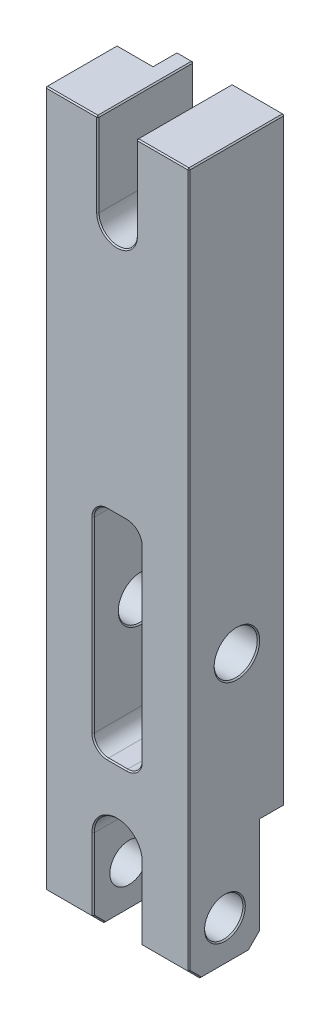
ISO-10303-21;
HEADER;
FILE_DESCRIPTION(('STEP AP214'),'2;1');
FILE_NAME('part.step','',(''),(''),'','','');
FILE_SCHEMA(('AUTOMOTIVE_DESIGN { 1 0 10303 214 1 1 1 1 }'));
ENDSEC;
DATA;
#1=APPLICATION_CONTEXT('core data for automotive mechanical design processes');
#2=APPLICATION_PROTOCOL_DEFINITION('international standard','automotive_design',2000,#1);
#3=PRODUCT_CONTEXT('',#1,'mechanical');
#4=PRODUCT('Part','Part','',(#3));
#5=PRODUCT_RELATED_PRODUCT_CATEGORY('part','',(#4));
#6=PRODUCT_DEFINITION_FORMATION('','',#4);
#7=PRODUCT_DEFINITION_CONTEXT('part definition',#1,'design');
#8=PRODUCT_DEFINITION('design','',#6,#7);
#9=PRODUCT_DEFINITION_SHAPE('','',#8);
#10=(LENGTH_UNIT() NAMED_UNIT(*) SI_UNIT(.MILLI.,.METRE.));
#11=(NAMED_UNIT(*) PLANE_ANGLE_UNIT() SI_UNIT($,.RADIAN.));
#12=(NAMED_UNIT(*) SI_UNIT($,.STERADIAN.) SOLID_ANGLE_UNIT());
#13=UNCERTAINTY_MEASURE_WITH_UNIT(LENGTH_MEASURE(1.E-05),#10,'distance_accuracy_value','');
#14=(GEOMETRIC_REPRESENTATION_CONTEXT(3) GLOBAL_UNCERTAINTY_ASSIGNED_CONTEXT((#13)) GLOBAL_UNIT_ASSIGNED_CONTEXT((#10,
#11,#12)) REPRESENTATION_CONTEXT('',''));
#15=CARTESIAN_POINT('',(0.,0.,0.));
#16=DIRECTION('',(0.,0.,1.));
#17=DIRECTION('',(1.,0.,0.));
#18=AXIS2_PLACEMENT_3D('',#15,#16,#17);
#19=CARTESIAN_POINT('',(0.,-75.,40.));
#20=DIRECTION('',(0.,0.,1.));
#21=DIRECTION('',(1.,0.,0.));
#22=AXIS2_PLACEMENT_3D('',#19,#20,#21);
#23=PLANE('',#22);
#24=CARTESIAN_POINT('',(-4.,-39.,40.));
#25=DIRECTION('',(0.,0.,1.));
#26=DIRECTION('',(1.,0.,0.));
#27=AXIS2_PLACEMENT_3D('',#24,#25,#26);
#28=CIRCLE('',#27,6.5000000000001);
#29=CARTESIAN_POINT('',(-4.,-45.5000000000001,40.));
#30=VERTEX_POINT('',#29);
#31=CARTESIAN_POINT('',(-10.5000000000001,-39.,40.));
#32=VERTEX_POINT('',#31);
#33=EDGE_CURVE('E744',#30,#32,#28,.F.);
#34=ORIENTED_EDGE('',*,*,#33,.T.);
#35=DIRECTION('',(0.,1.,0.));
#36=VECTOR('',#35,1.);
#37=CARTESIAN_POINT('',(-10.5000000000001,-75.,40.));
#38=LINE('',#37,#36);
#39=CARTESIAN_POINT('',(-10.5000000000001,39.,40.));
#40=VERTEX_POINT('',#39);
#41=EDGE_CURVE('E746',#32,#40,#38,.T.);
#42=ORIENTED_EDGE('',*,*,#41,.T.);
#43=CARTESIAN_POINT('',(-4.00000000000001,39.,40.));
#44=DIRECTION('',(0.,0.,1.));
#45=DIRECTION('',(1.,0.,0.));
#46=AXIS2_PLACEMENT_3D('',#43,#44,#45);
#47=CIRCLE('',#46,6.5000000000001);
#48=CARTESIAN_POINT('',(-4.00000000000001,45.5000000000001,40.));
#49=VERTEX_POINT('',#48);
#50=EDGE_CURVE('E732',#40,#49,#47,.F.);
#51=ORIENTED_EDGE('',*,*,#50,.T.);
#52=DIRECTION('',(1.,0.,0.));
#53=VECTOR('',#52,1.);
#54=CARTESIAN_POINT('',(0.,45.5000000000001,40.));
#55=LINE('',#54,#53);
#56=CARTESIAN_POINT('',(3.99999999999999,45.5000000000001,40.));
#57=VERTEX_POINT('',#56);
#58=EDGE_CURVE('E734',#49,#57,#55,.T.);
#59=ORIENTED_EDGE('',*,*,#58,.T.);
#60=CARTESIAN_POINT('',(3.99999999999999,39.,40.));
#61=DIRECTION('',(0.,0.,1.));
#62=DIRECTION('',(1.,0.,0.));
#63=AXIS2_PLACEMENT_3D('',#60,#61,#62);
#64=CIRCLE('',#63,6.5000000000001);
#65=CARTESIAN_POINT('',(10.5000000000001,39.,40.));
#66=VERTEX_POINT('',#65);
#67=EDGE_CURVE('E736',#57,#66,#64,.F.);
#68=ORIENTED_EDGE('',*,*,#67,.T.);
#69=DIRECTION('',(0.,-1.,0.));
#70=VECTOR('',#69,1.);
#71=CARTESIAN_POINT('',(10.5000000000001,-75.,40.));
#72=LINE('',#71,#70);
#73=CARTESIAN_POINT('',(10.5000000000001,-39.,40.));
#74=VERTEX_POINT('',#73);
#75=EDGE_CURVE('E738',#66,#74,#72,.T.);
#76=ORIENTED_EDGE('',*,*,#75,.T.);
#77=CARTESIAN_POINT('',(4.,-39.,40.));
#78=DIRECTION('',(0.,0.,1.));
#79=DIRECTION('',(1.,0.,0.));
#80=AXIS2_PLACEMENT_3D('',#77,#78,#79);
#81=CIRCLE('',#80,6.5000000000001);
#82=CARTESIAN_POINT('',(4.,-45.5000000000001,40.));
#83=VERTEX_POINT('',#82);
#84=EDGE_CURVE('E740',#74,#83,#81,.F.);
#85=ORIENTED_EDGE('',*,*,#84,.T.);
#86=DIRECTION('',(-1.,0.,0.));
#87=VECTOR('',#86,1.);
#88=CARTESIAN_POINT('',(0.,-45.5000000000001,40.));
#89=LINE('',#88,#87);
#90=EDGE_CURVE('E742',#83,#30,#89,.T.);
#91=ORIENTED_EDGE('',*,*,#90,.T.);
#92=EDGE_LOOP('',(#34,#42,#51,#59,#68,#76,#85,#91));
#93=FACE_BOUND('',#92,.T.);
#94=DIRECTION('',(1.,0.,0.));
#95=VECTOR('',#94,1.);
#96=CARTESIAN_POINT('',(-9.99999999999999,-105.,40.));
#97=LINE('',#96,#95);
#98=CARTESIAN_POINT('',(-29.5,-105.,40.));
#99=VERTEX_POINT('',#98);
#100=CARTESIAN_POINT('',(-10.5,-105.,40.));
#101=VERTEX_POINT('',#100);
#102=EDGE_CURVE('E553',#99,#101,#97,.T.);
#103=ORIENTED_EDGE('',*,*,#102,.T.);
#104=DIRECTION('',(0.,1.,0.));
#105=VECTOR('',#104,1.);
#106=CARTESIAN_POINT('',(-10.5,-75.,40.));
#107=LINE('',#106,#105);
#108=CARTESIAN_POINT('',(-10.5,-75.,40.));
#109=VERTEX_POINT('',#108);
#110=EDGE_CURVE('E730',#101,#109,#107,.T.);
#111=ORIENTED_EDGE('',*,*,#110,.T.);
#112=CARTESIAN_POINT('',(0.,-75.,40.));
#113=DIRECTION('',(0.,0.,1.));
#114=DIRECTION('',(1.,0.,0.));
#115=AXIS2_PLACEMENT_3D('',#112,#113,#114);
#116=CIRCLE('',#115,10.5);
#117=CARTESIAN_POINT('',(10.5,-75.,40.));
#118=VERTEX_POINT('',#117);
#119=EDGE_CURVE('E728',#109,#118,#116,.F.);
#120=ORIENTED_EDGE('',*,*,#119,.T.);
#121=DIRECTION('',(0.,-1.,0.));
#122=VECTOR('',#121,1.);
#123=CARTESIAN_POINT('',(10.5,-105.,40.));
#124=LINE('',#123,#122);
#125=CARTESIAN_POINT('',(10.5,-105.,40.));
#126=VERTEX_POINT('',#125);
#127=EDGE_CURVE('E726',#118,#126,#124,.T.);
#128=ORIENTED_EDGE('',*,*,#127,.T.);
#129=DIRECTION('',(1.,0.,0.));
#130=VECTOR('',#129,1.);
#131=CARTESIAN_POINT('',(30.,-105.,40.));
#132=LINE('',#131,#130);
#133=CARTESIAN_POINT('',(29.5,-105.,40.));
#134=VERTEX_POINT('',#133);
#135=EDGE_CURVE('E556',#126,#134,#132,.T.);
#136=ORIENTED_EDGE('',*,*,#135,.T.);
#137=DIRECTION('',(0.,1.,0.));
#138=VECTOR('',#137,1.);
#139=CARTESIAN_POINT('',(29.5,185.,40.));
#140=LINE('',#139,#138);
#141=CARTESIAN_POINT('',(29.5,184.5,40.));
#142=VERTEX_POINT('',#141);
#143=EDGE_CURVE('E724',#134,#142,#140,.T.);
#144=ORIENTED_EDGE('',*,*,#143,.T.);
#145=DIRECTION('',(-1.,0.,0.));
#146=VECTOR('',#145,1.);
#147=CARTESIAN_POINT('',(7.99999999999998,184.5,40.));
#148=LINE('',#147,#146);
#149=CARTESIAN_POINT('',(8.49999999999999,184.5,40.));
#150=VERTEX_POINT('',#149);
#151=EDGE_CURVE('E722',#142,#150,#148,.T.);
#152=ORIENTED_EDGE('',*,*,#151,.T.);
#153=DIRECTION('',(0.,-1.,0.));
#154=VECTOR('',#153,1.);
#155=CARTESIAN_POINT('',(8.50000000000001,150.,40.));
#156=LINE('',#155,#154);
#157=CARTESIAN_POINT('',(8.5,150.,40.));
#158=VERTEX_POINT('',#157);
#159=EDGE_CURVE('E720',#150,#158,#156,.T.);
#160=ORIENTED_EDGE('',*,*,#159,.T.);
#161=CARTESIAN_POINT('',(0.,150.,40.));
#162=DIRECTION('',(0.,0.,1.));
#163=DIRECTION('',(1.,0.,0.));
#164=AXIS2_PLACEMENT_3D('',#161,#162,#163);
#165=CIRCLE('',#164,8.5);
#166=CARTESIAN_POINT('',(-8.5,150.,40.));
#167=VERTEX_POINT('',#166);
#168=EDGE_CURVE('E718',#158,#167,#165,.F.);
#169=ORIENTED_EDGE('',*,*,#168,.T.);
#170=DIRECTION('',(0.,1.,0.));
#171=VECTOR('',#170,1.);
#172=CARTESIAN_POINT('',(-8.50000000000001,185.,40.));
#173=LINE('',#172,#171);
#174=CARTESIAN_POINT('',(-8.50000000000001,184.5,40.));
#175=VERTEX_POINT('',#174);
#176=EDGE_CURVE('E716',#167,#175,#173,.T.);
#177=ORIENTED_EDGE('',*,*,#176,.T.);
#178=DIRECTION('',(-1.,0.,0.));
#179=VECTOR('',#178,1.);
#180=CARTESIAN_POINT('',(-30.,184.5,40.));
#181=LINE('',#180,#179);
#182=CARTESIAN_POINT('',(-29.5,184.5,40.));
#183=VERTEX_POINT('',#182);
#184=EDGE_CURVE('E714',#175,#183,#181,.T.);
#185=ORIENTED_EDGE('',*,*,#184,.T.);
#186=DIRECTION('',(0.,-1.,0.));
#187=VECTOR('',#186,1.);
#188=CARTESIAN_POINT('',(-29.5,-105.,40.));
#189=LINE('',#188,#187);
#190=EDGE_CURVE('E712',#183,#99,#189,.T.);
#191=ORIENTED_EDGE('',*,*,#190,.T.);
#192=EDGE_LOOP('',(#103,#111,#120,#128,#136,#144,#152,#160,#169,#177,#185,#191));
#193=FACE_BOUND('',#192,.T.);
#194=ADVANCED_FACE('F32',(#93,#193),#23,.T.);
#195=CARTESIAN_POINT('',(0.,-75.,0.));
#196=DIRECTION('',(0.,0.,1.));
#197=DIRECTION('',(1.,0.,0.));
#198=AXIS2_PLACEMENT_3D('',#195,#196,#197);
#199=PLANE('',#198);
#200=DIRECTION('',(-1.,0.,0.));
#201=VECTOR('',#200,1.);
#202=CARTESIAN_POINT('',(-4.00000000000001,45.5,0.));
#203=LINE('',#202,#201);
#204=CARTESIAN_POINT('',(3.99999999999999,45.5,0.));
#205=VERTEX_POINT('',#204);
#206=CARTESIAN_POINT('',(-4.00000000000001,45.5,0.));
#207=VERTEX_POINT('',#206);
#208=EDGE_CURVE('E669',#205,#207,#203,.T.);
#209=ORIENTED_EDGE('',*,*,#208,.T.);
#210=CARTESIAN_POINT('',(-4.00000000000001,39.,0.));
#211=DIRECTION('',(0.,0.,1.));
#212=DIRECTION('',(1.,0.,0.));
#213=AXIS2_PLACEMENT_3D('',#210,#211,#212);
#214=CIRCLE('',#213,6.50000000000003);
#215=CARTESIAN_POINT('',(-10.5,39.,0.));
#216=VERTEX_POINT('',#215);
#217=EDGE_CURVE('E671',#207,#216,#214,.T.);
#218=ORIENTED_EDGE('',*,*,#217,.T.);
#219=DIRECTION('',(0.,-1.,0.));
#220=VECTOR('',#219,1.);
#221=CARTESIAN_POINT('',(-10.5,-39.,0.));
#222=LINE('',#221,#220);
#223=CARTESIAN_POINT('',(-10.5,-39.,0.));
#224=VERTEX_POINT('',#223);
#225=EDGE_CURVE('E665',#216,#224,#222,.T.);
#226=ORIENTED_EDGE('',*,*,#225,.T.);
#227=CARTESIAN_POINT('',(-4.,-39.,0.));
#228=DIRECTION('',(0.,0.,1.));
#229=DIRECTION('',(1.,0.,0.));
#230=AXIS2_PLACEMENT_3D('',#227,#228,#229);
#231=CIRCLE('',#230,6.50000000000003);
#232=CARTESIAN_POINT('',(-4.,-45.5,0.));
#233=VERTEX_POINT('',#232);
#234=EDGE_CURVE('E663',#224,#233,#231,.T.);
#235=ORIENTED_EDGE('',*,*,#234,.T.);
#236=DIRECTION('',(1.,0.,0.));
#237=VECTOR('',#236,1.);
#238=CARTESIAN_POINT('',(4.,-45.5,0.));
#239=LINE('',#238,#237);
#240=CARTESIAN_POINT('',(4.,-45.5,0.));
#241=VERTEX_POINT('',#240);
#242=EDGE_CURVE('E661',#233,#241,#239,.T.);
#243=ORIENTED_EDGE('',*,*,#242,.T.);
#244=CARTESIAN_POINT('',(4.,-39.,0.));
#245=DIRECTION('',(0.,0.,1.));
#246=DIRECTION('',(1.,0.,0.));
#247=AXIS2_PLACEMENT_3D('',#244,#245,#246);
#248=CIRCLE('',#247,6.50000000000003);
#249=CARTESIAN_POINT('',(10.5,-39.,0.));
#250=VERTEX_POINT('',#249);
#251=EDGE_CURVE('E659',#241,#250,#248,.T.);
#252=ORIENTED_EDGE('',*,*,#251,.T.);
#253=DIRECTION('',(0.,1.,0.));
#254=VECTOR('',#253,1.);
#255=CARTESIAN_POINT('',(10.5,39.,0.));
#256=LINE('',#255,#254);
#257=CARTESIAN_POINT('',(10.5,39.,0.));
#258=VERTEX_POINT('',#257);
#259=EDGE_CURVE('E657',#250,#258,#256,.T.);
#260=ORIENTED_EDGE('',*,*,#259,.T.);
#261=CARTESIAN_POINT('',(3.99999999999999,39.,0.));
#262=DIRECTION('',(0.,0.,1.));
#263=DIRECTION('',(1.,0.,0.));
#264=AXIS2_PLACEMENT_3D('',#261,#262,#263);
#265=CIRCLE('',#264,6.50000000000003);
#266=EDGE_CURVE('E667',#258,#205,#265,.T.);
#267=ORIENTED_EDGE('',*,*,#266,.T.);
#268=EDGE_LOOP('',(#209,#218,#226,#235,#243,#252,#260,#267));
#269=FACE_BOUND('',#268,.T.);
#270=CARTESIAN_POINT('',(0.,150.,0.));
#271=DIRECTION('',(0.,0.,1.));
#272=DIRECTION('',(1.,0.,0.));
#273=AXIS2_PLACEMENT_3D('',#270,#271,#272);
#274=CIRCLE('',#273,8.5);
#275=CARTESIAN_POINT('',(-8.5,150.,0.));
#276=VERTEX_POINT('',#275);
#277=CARTESIAN_POINT('',(8.5,150.,0.));
#278=VERTEX_POINT('',#277);
#279=EDGE_CURVE('E652',#276,#278,#274,.T.);
#280=ORIENTED_EDGE('',*,*,#279,.T.);
#281=DIRECTION('',(0.,1.,0.));
#282=VECTOR('',#281,1.);
#283=CARTESIAN_POINT('',(8.50000000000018,-75.,0.));
#284=LINE('',#283,#282);
#285=CARTESIAN_POINT('',(8.49999999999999,184.5,0.));
#286=VERTEX_POINT('',#285);
#287=EDGE_CURVE('E654',#278,#286,#284,.T.);
#288=ORIENTED_EDGE('',*,*,#287,.T.);
#289=DIRECTION('',(1.,0.,0.));
#290=VECTOR('',#289,1.);
#291=CARTESIAN_POINT('',(0.,184.5,0.));
#292=LINE('',#291,#290);
#293=CARTESIAN_POINT('',(29.5,184.5,0.));
#294=VERTEX_POINT('',#293);
#295=EDGE_CURVE('E646',#286,#294,#292,.T.);
#296=ORIENTED_EDGE('',*,*,#295,.T.);
#297=DIRECTION('',(0.,-1.,0.));
#298=VECTOR('',#297,1.);
#299=CARTESIAN_POINT('',(29.5,-75.,0.));
#300=LINE('',#299,#298);
#301=CARTESIAN_POINT('',(29.5,-64.5,0.));
#302=VERTEX_POINT('',#301);
#303=EDGE_CURVE('E632',#294,#302,#300,.T.);
#304=ORIENTED_EDGE('',*,*,#303,.T.);
#305=DIRECTION('',(-1.,0.,0.));
#306=VECTOR('',#305,1.);
#307=CARTESIAN_POINT('',(0.,-64.5,0.));
#308=LINE('',#307,#306);
#309=CARTESIAN_POINT('',(-14.7113248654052,-64.5,0.));
#310=VERTEX_POINT('',#309);
#311=EDGE_CURVE('E634',#302,#310,#308,.T.);
#312=ORIENTED_EDGE('',*,*,#311,.T.);
#313=DIRECTION('',(-0.499999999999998,0.86602540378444,0.));
#314=VECTOR('',#313,1.);
#315=CARTESIAN_POINT('',(-6.48686027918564,-78.7451905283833,0.));
#316=LINE('',#315,#314);
#317=CARTESIAN_POINT('',(-29.5,-38.8852632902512,0.));
#318=VERTEX_POINT('',#317);
#319=EDGE_CURVE('E636',#310,#318,#316,.T.);
#320=ORIENTED_EDGE('',*,*,#319,.T.);
#321=DIRECTION('',(0.,1.,0.));
#322=VECTOR('',#321,1.);
#323=CARTESIAN_POINT('',(-29.5,-75.,0.));
#324=LINE('',#323,#322);
#325=CARTESIAN_POINT('',(-29.5,38.885263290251,0.));
#326=VERTEX_POINT('',#325);
#327=EDGE_CURVE('E638',#318,#326,#324,.T.);
#328=ORIENTED_EDGE('',*,*,#327,.T.);
#329=DIRECTION('',(0.499999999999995,0.866025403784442,0.));
#330=VECTOR('',#329,1.);
#331=CARTESIAN_POINT('',(-71.4387655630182,-33.7548094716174,0.));
#332=LINE('',#331,#330);
#333=CARTESIAN_POINT('',(-17.9163522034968,58.9487298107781,0.));
#334=VERTEX_POINT('',#333);
#335=EDGE_CURVE('E640',#326,#334,#332,.T.);
#336=ORIENTED_EDGE('',*,*,#335,.T.);
#337=CARTESIAN_POINT('',(-40.,71.698729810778,0.));
#338=DIRECTION('',(0.,0.,1.));
#339=DIRECTION('',(1.,0.,0.));
#340=AXIS2_PLACEMENT_3D('',#337,#338,#339);
#341=CIRCLE('',#340,25.5);
#342=CARTESIAN_POINT('',(-14.5,71.698729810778,0.));
#343=VERTEX_POINT('',#342);
#344=EDGE_CURVE('E642',#334,#343,#341,.T.);
#345=ORIENTED_EDGE('',*,*,#344,.T.);
#346=DIRECTION('',(0.,1.,0.));
#347=VECTOR('',#346,1.);
#348=CARTESIAN_POINT('',(-14.5,-75.,0.));
#349=LINE('',#348,#347);
#350=CARTESIAN_POINT('',(-14.5,184.5,0.));
#351=VERTEX_POINT('',#350);
#352=EDGE_CURVE('E644',#343,#351,#349,.T.);
#353=ORIENTED_EDGE('',*,*,#352,.T.);
#354=DIRECTION('',(1.,0.,0.));
#355=VECTOR('',#354,1.);
#356=CARTESIAN_POINT('',(0.,184.5,0.));
#357=LINE('',#356,#355);
#358=CARTESIAN_POINT('',(-8.50000000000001,184.5,0.));
#359=VERTEX_POINT('',#358);
#360=EDGE_CURVE('E648',#351,#359,#357,.T.);
#361=ORIENTED_EDGE('',*,*,#360,.T.);
#362=DIRECTION('',(0.,-1.,0.));
#363=VECTOR('',#362,1.);
#364=CARTESIAN_POINT('',(-8.49999999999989,-75.,0.));
#365=LINE('',#364,#363);
#366=EDGE_CURVE('E650',#359,#276,#365,.T.);
#367=ORIENTED_EDGE('',*,*,#366,.T.);
#368=EDGE_LOOP('',(#280,#288,#296,#304,#312,#320,#328,#336,#345,#353,#361,#367));
#369=FACE_BOUND('',#368,.T.);
#370=ADVANCED_FACE('F1097',(#269,#369),#199,.F.);
#371=CARTESIAN_POINT('',(-30.,185.,40.));
#372=DIRECTION('',(1.,0.,0.));
#373=DIRECTION('',(0.,1.,0.));
#374=AXIS2_PLACEMENT_3D('',#371,#372,#373);
#375=PLANE('',#374);
#376=CARTESIAN_POINT('',(-30.,0.,20.));
#377=DIRECTION('',(1.,0.,0.));
#378=DIRECTION('',(0.,1.,0.));
#379=AXIS2_PLACEMENT_3D('',#376,#377,#378);
#380=CIRCLE('',#379,9.50000000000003);
#381=CARTESIAN_POINT('',(-30.,9.50000000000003,20.));
#382=VERTEX_POINT('',#381);
#383=EDGE_CURVE('E579',#382,#382,#380,.T.);
#384=ORIENTED_EDGE('',*,*,#383,.T.);
#385=EDGE_LOOP('',(#384));
#386=FACE_BOUND('',#385,.T.);
#387=DIRECTION('',(0.,0.,-1.));
#388=VECTOR('',#387,1.);
#389=CARTESIAN_POINT('',(-30.,39.0192378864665,40.));
#390=LINE('',#389,#388);
#391=CARTESIAN_POINT('',(-30.,39.0192378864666,10.));
#392=VERTEX_POINT('',#391);
#393=CARTESIAN_POINT('',(-30.,39.0192378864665,0.5));
#394=VERTEX_POINT('',#393);
#395=EDGE_CURVE('E532',#392,#394,#390,.T.);
#396=ORIENTED_EDGE('',*,*,#395,.T.);
#397=DIRECTION('',(0.,-1.,0.));
#398=VECTOR('',#397,1.);
#399=CARTESIAN_POINT('',(-30.,185.,0.5));
#400=LINE('',#399,#398);
#401=CARTESIAN_POINT('',(-30.,-39.0192378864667,0.5));
#402=VERTEX_POINT('',#401);
#403=EDGE_CURVE('E577',#394,#402,#400,.T.);
#404=ORIENTED_EDGE('',*,*,#403,.T.);
#405=DIRECTION('',(0.,0.,1.));
#406=VECTOR('',#405,1.);
#407=CARTESIAN_POINT('',(-30.,-39.0192378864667,40.));
#408=LINE('',#407,#406);
#409=CARTESIAN_POINT('',(-30.,-39.0192378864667,10.5));
#410=VERTEX_POINT('',#409);
#411=EDGE_CURVE('E530',#402,#410,#408,.T.);
#412=ORIENTED_EDGE('',*,*,#411,.T.);
#413=DIRECTION('',(0.,-1.,0.));
#414=VECTOR('',#413,1.);
#415=CARTESIAN_POINT('',(-30.,185.,10.5));
#416=LINE('',#415,#414);
#417=CARTESIAN_POINT('',(-30.,-104.792893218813,10.5));
#418=VERTEX_POINT('',#417);
#419=EDGE_CURVE('E573',#410,#418,#416,.T.);
#420=ORIENTED_EDGE('',*,*,#419,.T.);
#421=DIRECTION('',(0.,-0.707106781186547,0.707106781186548));
#422=VECTOR('',#421,1.);
#423=CARTESIAN_POINT('',(-30.,-109.646446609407,15.3535533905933));
#424=LINE('',#423,#422);
#425=CARTESIAN_POINT('',(-30.,-109.5,15.2071067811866));
#426=VERTEX_POINT('',#425);
#427=EDGE_CURVE('E571',#418,#426,#424,.T.);
#428=ORIENTED_EDGE('',*,*,#427,.T.);
#429=DIRECTION('',(0.,0.,1.));
#430=VECTOR('',#429,1.);
#431=CARTESIAN_POINT('',(-30.,-109.5,40.));
#432=LINE('',#431,#430);
#433=CARTESIAN_POINT('',(-30.,-109.5,34.7928932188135));
#434=VERTEX_POINT('',#433);
#435=EDGE_CURVE('E569',#426,#434,#432,.T.);
#436=ORIENTED_EDGE('',*,*,#435,.T.);
#437=DIRECTION('',(0.,0.707106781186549,0.707106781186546));
#438=VECTOR('',#437,1.);
#439=CARTESIAN_POINT('',(-30.,-104.646446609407,39.6464466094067));
#440=LINE('',#439,#438);
#441=CARTESIAN_POINT('',(-30.,-104.792893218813,39.5));
#442=VERTEX_POINT('',#441);
#443=EDGE_CURVE('E567',#434,#442,#440,.T.);
#444=ORIENTED_EDGE('',*,*,#443,.T.);
#445=DIRECTION('',(0.,1.,0.));
#446=VECTOR('',#445,1.);
#447=CARTESIAN_POINT('',(-30.,185.,39.5));
#448=LINE('',#447,#446);
#449=CARTESIAN_POINT('',(-30.,184.5,39.5));
#450=VERTEX_POINT('',#449);
#451=EDGE_CURVE('E565',#442,#450,#448,.T.);
#452=ORIENTED_EDGE('',*,*,#451,.T.);
#453=DIRECTION('',(0.,0.,-1.));
#454=VECTOR('',#453,1.);
#455=CARTESIAN_POINT('',(-30.,184.5,40.));
#456=LINE('',#455,#454);
#457=CARTESIAN_POINT('',(-30.,184.5,10.));
#458=VERTEX_POINT('',#457);
#459=EDGE_CURVE('E575',#450,#458,#456,.T.);
#460=ORIENTED_EDGE('',*,*,#459,.T.);
#461=DIRECTION('',(0.,-1.,0.));
#462=VECTOR('',#461,1.);
#463=CARTESIAN_POINT('',(-30.,185.,10.));
#464=LINE('',#463,#462);
#465=EDGE_CURVE('E485',#458,#392,#464,.T.);
#466=ORIENTED_EDGE('',*,*,#465,.T.);
#467=EDGE_LOOP('',(#396,#404,#412,#420,#428,#436,#444,#452,#460,#466));
#468=FACE_BOUND('',#467,.T.);
#469=CARTESIAN_POINT('',(-30.,-93.,25.));
#470=DIRECTION('',(-1.,0.,0.));
#471=DIRECTION('',(0.,-1.,0.));
#472=AXIS2_PLACEMENT_3D('',#469,#470,#471);
#473=CIRCLE('',#472,8.);
#474=CARTESIAN_POINT('',(-30.,-101.,25.));
#475=VERTEX_POINT('',#474);
#476=EDGE_CURVE('E488',#475,#475,#473,.T.);
#477=ORIENTED_EDGE('',*,*,#476,.F.);
#478=EDGE_LOOP('',(#477));
#479=FACE_BOUND('',#478,.T.);
#480=ADVANCED_FACE('F1103',(#386,#468,#479),#375,.F.);
#481=CARTESIAN_POINT('',(-30.,-110.,40.));
#482=DIRECTION('',(0.,1.,0.));
#483=DIRECTION('',(-1.,0.,0.));
#484=AXIS2_PLACEMENT_3D('',#481,#482,#483);
#485=PLANE('',#484);
#486=DIRECTION('',(1.,0.,0.));
#487=VECTOR('',#486,1.);
#488=CARTESIAN_POINT('',(-30.,-110.,15.));
#489=LINE('',#488,#487);
#490=CARTESIAN_POINT('',(-29.5,-110.,15.));
#491=VERTEX_POINT('',#490);
#492=CARTESIAN_POINT('',(-10.5,-110.,15.));
#493=VERTEX_POINT('',#492);
#494=EDGE_CURVE('E538',#491,#493,#489,.T.);
#495=ORIENTED_EDGE('',*,*,#494,.T.);
#496=DIRECTION('',(0.,0.,1.));
#497=VECTOR('',#496,1.);
#498=CARTESIAN_POINT('',(-10.5,-110.,40.));
#499=LINE('',#498,#497);
#500=CARTESIAN_POINT('',(-10.5,-110.,35.));
#501=VERTEX_POINT('',#500);
#502=EDGE_CURVE('E785',#493,#501,#499,.T.);
#503=ORIENTED_EDGE('',*,*,#502,.T.);
#504=DIRECTION('',(-1.,0.,0.));
#505=VECTOR('',#504,1.);
#506=CARTESIAN_POINT('',(-30.,-110.,35.));
#507=LINE('',#506,#505);
#508=CARTESIAN_POINT('',(-29.5,-110.,35.));
#509=VERTEX_POINT('',#508);
#510=EDGE_CURVE('E535',#501,#509,#507,.T.);
#511=ORIENTED_EDGE('',*,*,#510,.T.);
#512=DIRECTION('',(0.,0.,-1.));
#513=VECTOR('',#512,1.);
#514=CARTESIAN_POINT('',(-29.5,-110.,40.));
#515=LINE('',#514,#513);
#516=EDGE_CURVE('E783',#509,#491,#515,.T.);
#517=ORIENTED_EDGE('',*,*,#516,.T.);
#518=EDGE_LOOP('',(#495,#503,#511,#517));
#519=FACE_BOUND('',#518,.T.);
#520=ADVANCED_FACE('F1150',(#519),#485,.F.);
#521=CARTESIAN_POINT('',(-9.99999999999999,-75.,40.));
#522=DIRECTION('',(-1.,0.,0.));
#523=DIRECTION('',(0.,0.,1.));
#524=AXIS2_PLACEMENT_3D('',#521,#522,#523);
#525=PLANE('',#524);
#526=CARTESIAN_POINT('',(-9.99999999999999,-93.,25.));
#527=DIRECTION('',(-1.,0.,0.));
#528=DIRECTION('',(0.,0.,1.));
#529=AXIS2_PLACEMENT_3D('',#526,#527,#528);
#530=CIRCLE('',#529,8.);
#531=CARTESIAN_POINT('',(-9.99999999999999,-93.,33.));
#532=VERTEX_POINT('',#531);
#533=EDGE_CURVE('E491',#532,#532,#530,.T.);
#534=ORIENTED_EDGE('',*,*,#533,.T.);
#535=EDGE_LOOP('',(#534));
#536=FACE_BOUND('',#535,.T.);
#537=DIRECTION('',(0.,0.707106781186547,-0.707106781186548));
#538=VECTOR('',#537,1.);
#539=CARTESIAN_POINT('',(-9.99999999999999,-104.646446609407,10.3535533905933));
#540=LINE('',#539,#538);
#541=CARTESIAN_POINT('',(-9.99999999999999,-109.5,15.2071067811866));
#542=VERTEX_POINT('',#541);
#543=CARTESIAN_POINT('',(-9.99999999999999,-104.792893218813,10.5));
#544=VERTEX_POINT('',#543);
#545=EDGE_CURVE('E775',#542,#544,#540,.T.);
#546=ORIENTED_EDGE('',*,*,#545,.T.);
#547=DIRECTION('',(0.,1.,0.));
#548=VECTOR('',#547,1.);
#549=CARTESIAN_POINT('',(-9.99999999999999,-75.,10.5));
#550=LINE('',#549,#548);
#551=CARTESIAN_POINT('',(-10.,-75.,10.5));
#552=VERTEX_POINT('',#551);
#553=EDGE_CURVE('E777',#544,#552,#550,.T.);
#554=ORIENTED_EDGE('',*,*,#553,.T.);
#555=DIRECTION('',(0.,0.,-1.));
#556=VECTOR('',#555,1.);
#557=CARTESIAN_POINT('',(-10.,-75.,40.));
#558=LINE('',#557,#556);
#559=CARTESIAN_POINT('',(-10.,-75.,39.5));
#560=VERTEX_POINT('',#559);
#561=EDGE_CURVE('E527',#560,#552,#558,.T.);
#562=ORIENTED_EDGE('',*,*,#561,.F.);
#563=DIRECTION('',(0.,-1.,0.));
#564=VECTOR('',#563,1.);
#565=CARTESIAN_POINT('',(-9.99999999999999,-105.,39.5));
#566=LINE('',#565,#564);
#567=CARTESIAN_POINT('',(-9.99999999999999,-104.792893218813,39.5));
#568=VERTEX_POINT('',#567);
#569=EDGE_CURVE('E769',#560,#568,#566,.T.);
#570=ORIENTED_EDGE('',*,*,#569,.T.);
#571=DIRECTION('',(0.,-0.707106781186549,-0.707106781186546));
#572=VECTOR('',#571,1.);
#573=CARTESIAN_POINT('',(-9.99999999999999,-109.646446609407,34.6464466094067));
#574=LINE('',#573,#572);
#575=CARTESIAN_POINT('',(-9.99999999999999,-109.5,34.7928932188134));
#576=VERTEX_POINT('',#575);
#577=EDGE_CURVE('E771',#568,#576,#574,.T.);
#578=ORIENTED_EDGE('',*,*,#577,.T.);
#579=DIRECTION('',(0.,0.,-1.));
#580=VECTOR('',#579,1.);
#581=CARTESIAN_POINT('',(-9.99999999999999,-109.5,40.));
#582=LINE('',#581,#580);
#583=EDGE_CURVE('E773',#576,#542,#582,.T.);
#584=ORIENTED_EDGE('',*,*,#583,.T.);
#585=EDGE_LOOP('',(#546,#554,#562,#570,#578,#584));
#586=FACE_BOUND('',#585,.T.);
#587=ADVANCED_FACE('F1146',(#536,#586),#525,.F.);
#588=CARTESIAN_POINT('',(0.,-75.,40.));
#589=DIRECTION('',(0.,0.,-1.));
#590=DIRECTION('',(-1.,0.,0.));
#591=AXIS2_PLACEMENT_3D('',#588,#589,#590);
#592=CYLINDRICAL_SURFACE('',#591,10.);
#593=CARTESIAN_POINT('',(0.,-75.,10.5));
#594=DIRECTION('',(0.,0.,1.));
#595=DIRECTION('',(1.,0.,0.));
#596=AXIS2_PLACEMENT_3D('',#593,#594,#595);
#597=CIRCLE('',#596,10.);
#598=CARTESIAN_POINT('',(0.,-65.,10.5));
#599=VERTEX_POINT('',#598);
#600=EDGE_CURVE('E751',#552,#599,#597,.F.);
#601=ORIENTED_EDGE('',*,*,#600,.T.);
#602=CARTESIAN_POINT('',(0.,-75.,10.5));
#603=DIRECTION('',(0.,0.,1.));
#604=DIRECTION('',(1.,0.,0.));
#605=AXIS2_PLACEMENT_3D('',#602,#603,#604);
#606=CIRCLE('',#605,10.);
#607=CARTESIAN_POINT('',(10.,-75.,10.5));
#608=VERTEX_POINT('',#607);
#609=EDGE_CURVE('E753',#599,#608,#606,.F.);
#610=ORIENTED_EDGE('',*,*,#609,.T.);
#611=DIRECTION('',(0.,0.,-1.));
#612=VECTOR('',#611,1.);
#613=CARTESIAN_POINT('',(10.,-75.,40.));
#614=LINE('',#613,#612);
#615=CARTESIAN_POINT('',(10.,-75.,39.5));
#616=VERTEX_POINT('',#615);
#617=EDGE_CURVE('E524',#616,#608,#614,.T.);
#618=ORIENTED_EDGE('',*,*,#617,.F.);
#619=CARTESIAN_POINT('',(0.,-75.,39.5));
#620=DIRECTION('',(0.,0.,1.));
#621=DIRECTION('',(1.,0.,0.));
#622=AXIS2_PLACEMENT_3D('',#619,#620,#621);
#623=CIRCLE('',#622,10.);
#624=EDGE_CURVE('E749',#616,#560,#623,.T.);
#625=ORIENTED_EDGE('',*,*,#624,.T.);
#626=ORIENTED_EDGE('',*,*,#561,.T.);
#627=EDGE_LOOP('',(#601,#610,#618,#625,#626));
#628=FACE_BOUND('',#627,.T.);
#629=ADVANCED_FACE('F1142',(#628),#592,.F.);
#630=CARTESIAN_POINT('',(10.,-75.,40.));
#631=DIRECTION('',(1.,0.,0.));
#632=DIRECTION('',(0.,1.,0.));
#633=AXIS2_PLACEMENT_3D('',#630,#631,#632);
#634=PLANE('',#633);
#635=CARTESIAN_POINT('',(10.,-93.,25.));
#636=DIRECTION('',(1.,0.,0.));
#637=DIRECTION('',(0.,1.,0.));
#638=AXIS2_PLACEMENT_3D('',#635,#636,#637);
#639=CIRCLE('',#638,8.50000000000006);
#640=CARTESIAN_POINT('',(10.,-84.4999999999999,25.));
#641=VERTEX_POINT('',#640);
#642=EDGE_CURVE('E592',#641,#641,#639,.T.);
#643=ORIENTED_EDGE('',*,*,#642,.T.);
#644=EDGE_LOOP('',(#643));
#645=FACE_BOUND('',#644,.T.);
#646=ORIENTED_EDGE('',*,*,#617,.T.);
#647=DIRECTION('',(0.,-1.,0.));
#648=VECTOR('',#647,1.);
#649=CARTESIAN_POINT('',(10.,-75.,10.5));
#650=LINE('',#649,#648);
#651=CARTESIAN_POINT('',(10.,-104.792893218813,10.5));
#652=VERTEX_POINT('',#651);
#653=EDGE_CURVE('E590',#608,#652,#650,.T.);
#654=ORIENTED_EDGE('',*,*,#653,.T.);
#655=DIRECTION('',(0.,-0.707106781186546,0.707106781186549));
#656=VECTOR('',#655,1.);
#657=CARTESIAN_POINT('',(10.,-109.646446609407,15.3535533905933));
#658=LINE('',#657,#656);
#659=CARTESIAN_POINT('',(10.,-109.5,15.2071067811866));
#660=VERTEX_POINT('',#659);
#661=EDGE_CURVE('E588',#652,#660,#658,.T.);
#662=ORIENTED_EDGE('',*,*,#661,.T.);
#663=DIRECTION('',(0.,0.,1.));
#664=VECTOR('',#663,1.);
#665=CARTESIAN_POINT('',(10.,-109.5,40.));
#666=LINE('',#665,#664);
#667=CARTESIAN_POINT('',(10.,-109.5,34.7928932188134));
#668=VERTEX_POINT('',#667);
#669=EDGE_CURVE('E586',#660,#668,#666,.T.);
#670=ORIENTED_EDGE('',*,*,#669,.T.);
#671=DIRECTION('',(0.,0.707106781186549,0.707106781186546));
#672=VECTOR('',#671,1.);
#673=CARTESIAN_POINT('',(10.,-104.646446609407,39.6464466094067));
#674=LINE('',#673,#672);
#675=CARTESIAN_POINT('',(10.,-104.792893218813,39.5));
#676=VERTEX_POINT('',#675);
#677=EDGE_CURVE('E584',#668,#676,#674,.T.);
#678=ORIENTED_EDGE('',*,*,#677,.T.);
#679=DIRECTION('',(0.,1.,0.));
#680=VECTOR('',#679,1.);
#681=CARTESIAN_POINT('',(10.,-75.,39.5));
#682=LINE('',#681,#680);
#683=EDGE_CURVE('E582',#676,#616,#682,.T.);
#684=ORIENTED_EDGE('',*,*,#683,.T.);
#685=EDGE_LOOP('',(#646,#654,#662,#670,#678,#684));
#686=FACE_BOUND('',#685,.T.);
#687=ADVANCED_FACE('F1138',(#645,#686),#634,.F.);
#688=CARTESIAN_POINT('',(10.,-110.,40.));
#689=DIRECTION('',(0.,1.,0.));
#690=DIRECTION('',(0.,0.,1.));
#691=AXIS2_PLACEMENT_3D('',#688,#689,#690);
#692=PLANE('',#691);
#693=DIRECTION('',(-1.,0.,0.));
#694=VECTOR('',#693,1.);
#695=CARTESIAN_POINT('',(10.,-110.,35.));
#696=LINE('',#695,#694);
#697=CARTESIAN_POINT('',(29.5,-110.,35.));
#698=VERTEX_POINT('',#697);
#699=CARTESIAN_POINT('',(10.5,-110.,35.));
#700=VERTEX_POINT('',#699);
#701=EDGE_CURVE('E544',#698,#700,#696,.T.);
#702=ORIENTED_EDGE('',*,*,#701,.T.);
#703=DIRECTION('',(0.,0.,-1.));
#704=VECTOR('',#703,1.);
#705=CARTESIAN_POINT('',(10.5,-110.,40.));
#706=LINE('',#705,#704);
#707=CARTESIAN_POINT('',(10.5,-110.,15.));
#708=VERTEX_POINT('',#707);
#709=EDGE_CURVE('E797',#700,#708,#706,.T.);
#710=ORIENTED_EDGE('',*,*,#709,.T.);
#711=DIRECTION('',(1.,0.,0.));
#712=VECTOR('',#711,1.);
#713=CARTESIAN_POINT('',(10.,-110.,15.));
#714=LINE('',#713,#712);
#715=CARTESIAN_POINT('',(29.5,-110.,15.));
#716=VERTEX_POINT('',#715);
#717=EDGE_CURVE('E547',#708,#716,#714,.T.);
#718=ORIENTED_EDGE('',*,*,#717,.T.);
#719=DIRECTION('',(0.,0.,1.));
#720=VECTOR('',#719,1.);
#721=CARTESIAN_POINT('',(29.5,-110.,40.));
#722=LINE('',#721,#720);
#723=EDGE_CURVE('E795',#716,#698,#722,.T.);
#724=ORIENTED_EDGE('',*,*,#723,.T.);
#725=EDGE_LOOP('',(#702,#710,#718,#724));
#726=FACE_BOUND('',#725,.T.);
#727=ADVANCED_FACE('F1134',(#726),#692,.F.);
#728=CARTESIAN_POINT('',(30.,185.,40.));
#729=DIRECTION('',(-1.,0.,0.));
#730=DIRECTION('',(0.,-1.,0.));
#731=AXIS2_PLACEMENT_3D('',#728,#729,#730);
#732=PLANE('',#731);
#733=CARTESIAN_POINT('',(30.,-93.,25.));
#734=DIRECTION('',(-1.,0.,0.));
#735=DIRECTION('',(0.,-1.,0.));
#736=AXIS2_PLACEMENT_3D('',#733,#734,#735);
#737=CIRCLE('',#736,8.49999999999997);
#738=CARTESIAN_POINT('',(30.,-101.5,25.));
#739=VERTEX_POINT('',#738);
#740=EDGE_CURVE('E621',#739,#739,#737,.T.);
#741=ORIENTED_EDGE('',*,*,#740,.T.);
#742=EDGE_LOOP('',(#741));
#743=FACE_BOUND('',#742,.T.);
#744=CARTESIAN_POINT('',(30.,0.,20.));
#745=DIRECTION('',(-1.,0.,0.));
#746=DIRECTION('',(0.,-1.,0.));
#747=AXIS2_PLACEMENT_3D('',#744,#745,#746);
#748=CIRCLE('',#747,9.50000000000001);
#749=CARTESIAN_POINT('',(30.,-9.50000000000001,20.));
#750=VERTEX_POINT('',#749);
#751=EDGE_CURVE('E618',#750,#750,#748,.T.);
#752=ORIENTED_EDGE('',*,*,#751,.T.);
#753=EDGE_LOOP('',(#752));
#754=FACE_BOUND('',#753,.T.);
#755=DIRECTION('',(0.,1.,0.));
#756=VECTOR('',#755,1.);
#757=CARTESIAN_POINT('',(30.,185.,0.5));
#758=LINE('',#757,#756);
#759=CARTESIAN_POINT('',(30.,-64.5,0.5));
#760=VERTEX_POINT('',#759);
#761=CARTESIAN_POINT('',(30.,184.5,0.5));
#762=VERTEX_POINT('',#761);
#763=EDGE_CURVE('E613',#760,#762,#758,.T.);
#764=ORIENTED_EDGE('',*,*,#763,.T.);
#765=DIRECTION('',(0.,0.,1.));
#766=VECTOR('',#765,1.);
#767=CARTESIAN_POINT('',(30.,184.5,40.));
#768=LINE('',#767,#766);
#769=CARTESIAN_POINT('',(30.,184.5,39.5));
#770=VERTEX_POINT('',#769);
#771=EDGE_CURVE('E615',#762,#770,#768,.T.);
#772=ORIENTED_EDGE('',*,*,#771,.T.);
#773=DIRECTION('',(0.,-1.,0.));
#774=VECTOR('',#773,1.);
#775=CARTESIAN_POINT('',(30.,-105.,39.5));
#776=LINE('',#775,#774);
#777=CARTESIAN_POINT('',(30.,-104.792893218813,39.5));
#778=VERTEX_POINT('',#777);
#779=EDGE_CURVE('E601',#770,#778,#776,.T.);
#780=ORIENTED_EDGE('',*,*,#779,.T.);
#781=DIRECTION('',(0.,-0.707106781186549,-0.707106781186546));
#782=VECTOR('',#781,1.);
#783=CARTESIAN_POINT('',(30.,-109.646446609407,34.6464466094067));
#784=LINE('',#783,#782);
#785=CARTESIAN_POINT('',(30.,-109.5,34.7928932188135));
#786=VERTEX_POINT('',#785);
#787=EDGE_CURVE('E603',#778,#786,#784,.T.);
#788=ORIENTED_EDGE('',*,*,#787,.T.);
#789=DIRECTION('',(0.,0.,-1.));
#790=VECTOR('',#789,1.);
#791=CARTESIAN_POINT('',(30.,-109.5,40.));
#792=LINE('',#791,#790);
#793=CARTESIAN_POINT('',(30.,-109.5,15.2071067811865));
#794=VERTEX_POINT('',#793);
#795=EDGE_CURVE('E605',#786,#794,#792,.T.);
#796=ORIENTED_EDGE('',*,*,#795,.T.);
#797=DIRECTION('',(0.,0.707106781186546,-0.707106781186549));
#798=VECTOR('',#797,1.);
#799=CARTESIAN_POINT('',(30.,-104.646446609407,10.3535533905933));
#800=LINE('',#799,#798);
#801=CARTESIAN_POINT('',(30.,-104.792893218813,10.5));
#802=VERTEX_POINT('',#801);
#803=EDGE_CURVE('E607',#794,#802,#800,.T.);
#804=ORIENTED_EDGE('',*,*,#803,.T.);
#805=DIRECTION('',(0.,1.,0.));
#806=VECTOR('',#805,1.);
#807=CARTESIAN_POINT('',(30.,185.,10.5));
#808=LINE('',#807,#806);
#809=CARTESIAN_POINT('',(30.,-64.5,10.5));
#810=VERTEX_POINT('',#809);
#811=EDGE_CURVE('E609',#802,#810,#808,.T.);
#812=ORIENTED_EDGE('',*,*,#811,.T.);
#813=DIRECTION('',(0.,0.,-1.));
#814=VECTOR('',#813,1.);
#815=CARTESIAN_POINT('',(30.,-64.5,40.));
#816=LINE('',#815,#814);
#817=EDGE_CURVE('E611',#810,#760,#816,.T.);
#818=ORIENTED_EDGE('',*,*,#817,.T.);
#819=EDGE_LOOP('',(#764,#772,#780,#788,#796,#804,#812,#818));
#820=FACE_BOUND('',#819,.T.);
#821=ADVANCED_FACE('F1130',(#743,#754,#820),#732,.F.);
#822=CARTESIAN_POINT('',(7.99999999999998,185.,40.));
#823=DIRECTION('',(0.,-1.,0.));
#824=DIRECTION('',(0.,0.,-1.));
#825=AXIS2_PLACEMENT_3D('',#822,#823,#824);
#826=PLANE('',#825);
#827=DIRECTION('',(-1.,0.,0.));
#828=VECTOR('',#827,1.);
#829=CARTESIAN_POINT('',(7.99999999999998,185.,0.5));
#830=LINE('',#829,#828);
#831=CARTESIAN_POINT('',(29.5,185.,0.5));
#832=VERTEX_POINT('',#831);
#833=CARTESIAN_POINT('',(8.49999999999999,185.,0.5));
#834=VERTEX_POINT('',#833);
#835=EDGE_CURVE('E841',#832,#834,#830,.T.);
#836=ORIENTED_EDGE('',*,*,#835,.T.);
#837=DIRECTION('',(0.,0.,1.));
#838=VECTOR('',#837,1.);
#839=CARTESIAN_POINT('',(8.49999999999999,185.,40.));
#840=LINE('',#839,#838);
#841=CARTESIAN_POINT('',(8.49999999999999,185.,39.5));
#842=VERTEX_POINT('',#841);
#843=EDGE_CURVE('E843',#834,#842,#840,.T.);
#844=ORIENTED_EDGE('',*,*,#843,.T.);
#845=DIRECTION('',(1.,0.,0.));
#846=VECTOR('',#845,1.);
#847=CARTESIAN_POINT('',(30.,185.,39.5));
#848=LINE('',#847,#846);
#849=CARTESIAN_POINT('',(29.5,185.,39.5));
#850=VERTEX_POINT('',#849);
#851=EDGE_CURVE('E837',#842,#850,#848,.T.);
#852=ORIENTED_EDGE('',*,*,#851,.T.);
#853=DIRECTION('',(0.,0.,-1.));
#854=VECTOR('',#853,1.);
#855=CARTESIAN_POINT('',(29.5,185.,40.));
#856=LINE('',#855,#854);
#857=EDGE_CURVE('E839',#850,#832,#856,.T.);
#858=ORIENTED_EDGE('',*,*,#857,.T.);
#859=EDGE_LOOP('',(#836,#844,#852,#858));
#860=FACE_BOUND('',#859,.T.);
#861=ADVANCED_FACE('F1126',(#860),#826,.F.);
#862=CARTESIAN_POINT('',(7.99999999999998,185.,40.));
#863=DIRECTION('',(1.,0.,0.));
#864=DIRECTION('',(0.,1.,0.));
#865=AXIS2_PLACEMENT_3D('',#862,#863,#864);
#866=PLANE('',#865);
#867=DIRECTION('',(0.,0.,-1.));
#868=VECTOR('',#867,1.);
#869=CARTESIAN_POINT('',(7.99999999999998,184.5,40.));
#870=LINE('',#869,#868);
#871=CARTESIAN_POINT('',(7.99999999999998,184.5,39.5));
#872=VERTEX_POINT('',#871);
#873=CARTESIAN_POINT('',(7.99999999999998,184.5,0.5));
#874=VERTEX_POINT('',#873);
#875=EDGE_CURVE('E805',#872,#874,#870,.T.);
#876=ORIENTED_EDGE('',*,*,#875,.T.);
#877=DIRECTION('',(0.,-1.,0.));
#878=VECTOR('',#877,1.);
#879=CARTESIAN_POINT('',(7.99999999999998,185.,0.5));
#880=LINE('',#879,#878);
#881=CARTESIAN_POINT('',(8.,150.,0.5));
#882=VERTEX_POINT('',#881);
#883=EDGE_CURVE('E807',#874,#882,#880,.T.);
#884=ORIENTED_EDGE('',*,*,#883,.T.);
#885=DIRECTION('',(0.,0.,-1.));
#886=VECTOR('',#885,1.);
#887=CARTESIAN_POINT('',(8.,150.,40.));
#888=LINE('',#887,#886);
#889=CARTESIAN_POINT('',(8.,150.,39.5));
#890=VERTEX_POINT('',#889);
#891=EDGE_CURVE('E521',#890,#882,#888,.T.);
#892=ORIENTED_EDGE('',*,*,#891,.F.);
#893=DIRECTION('',(0.,1.,0.));
#894=VECTOR('',#893,1.);
#895=CARTESIAN_POINT('',(7.99999999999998,185.,39.5));
#896=LINE('',#895,#894);
#897=EDGE_CURVE('E803',#890,#872,#896,.T.);
#898=ORIENTED_EDGE('',*,*,#897,.T.);
#899=EDGE_LOOP('',(#876,#884,#892,#898));
#900=FACE_BOUND('',#899,.T.);
#901=ADVANCED_FACE('F1122',(#900),#866,.F.);
#902=CARTESIAN_POINT('',(0.,150.,40.));
#903=DIRECTION('',(0.,0.,-1.));
#904=DIRECTION('',(-1.,0.,0.));
#905=AXIS2_PLACEMENT_3D('',#902,#903,#904);
#906=CYLINDRICAL_SURFACE('',#905,8.);
#907=ORIENTED_EDGE('',*,*,#891,.T.);
#908=CARTESIAN_POINT('',(0.,150.,0.5));
#909=DIRECTION('',(0.,0.,1.));
#910=DIRECTION('',(1.,0.,0.));
#911=AXIS2_PLACEMENT_3D('',#908,#909,#910);
#912=CIRCLE('',#911,8.);
#913=CARTESIAN_POINT('',(-8.,150.,0.5));
#914=VERTEX_POINT('',#913);
#915=EDGE_CURVE('E812',#882,#914,#912,.F.);
#916=ORIENTED_EDGE('',*,*,#915,.T.);
#917=DIRECTION('',(0.,0.,-1.));
#918=VECTOR('',#917,1.);
#919=CARTESIAN_POINT('',(-8.,150.,40.));
#920=LINE('',#919,#918);
#921=CARTESIAN_POINT('',(-8.,150.,39.5));
#922=VERTEX_POINT('',#921);
#923=EDGE_CURVE('E518',#922,#914,#920,.T.);
#924=ORIENTED_EDGE('',*,*,#923,.F.);
#925=CARTESIAN_POINT('',(0.,150.,39.5));
#926=DIRECTION('',(0.,0.,1.));
#927=DIRECTION('',(1.,0.,0.));
#928=AXIS2_PLACEMENT_3D('',#925,#926,#927);
#929=CIRCLE('',#928,8.);
#930=EDGE_CURVE('E810',#922,#890,#929,.T.);
#931=ORIENTED_EDGE('',*,*,#930,.T.);
#932=EDGE_LOOP('',(#907,#916,#924,#931));
#933=FACE_BOUND('',#932,.T.);
#934=ADVANCED_FACE('F1118',(#933),#906,.F.);
#935=CARTESIAN_POINT('',(-8.00000000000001,185.,40.));
#936=DIRECTION('',(-1.,0.,0.));
#937=DIRECTION('',(0.,-1.,0.));
#938=AXIS2_PLACEMENT_3D('',#935,#936,#937);
#939=PLANE('',#938);
#940=ORIENTED_EDGE('',*,*,#923,.T.);
#941=DIRECTION('',(0.,1.,0.));
#942=VECTOR('',#941,1.);
#943=CARTESIAN_POINT('',(-8.00000000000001,185.,0.5));
#944=LINE('',#943,#942);
#945=CARTESIAN_POINT('',(-8.00000000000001,184.5,0.5));
#946=VERTEX_POINT('',#945);
#947=EDGE_CURVE('E818',#914,#946,#944,.T.);
#948=ORIENTED_EDGE('',*,*,#947,.T.);
#949=DIRECTION('',(0.,0.,1.));
#950=VECTOR('',#949,1.);
#951=CARTESIAN_POINT('',(-8.00000000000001,184.5,40.));
#952=LINE('',#951,#950);
#953=CARTESIAN_POINT('',(-8.00000000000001,184.5,39.5));
#954=VERTEX_POINT('',#953);
#955=EDGE_CURVE('E816',#946,#954,#952,.T.);
#956=ORIENTED_EDGE('',*,*,#955,.T.);
#957=DIRECTION('',(0.,-1.,0.));
#958=VECTOR('',#957,1.);
#959=CARTESIAN_POINT('',(-8.,150.,39.5));
#960=LINE('',#959,#958);
#961=EDGE_CURVE('E814',#954,#922,#960,.T.);
#962=ORIENTED_EDGE('',*,*,#961,.T.);
#963=EDGE_LOOP('',(#940,#948,#956,#962));
#964=FACE_BOUND('',#963,.T.);
#965=ADVANCED_FACE('F1114',(#964),#939,.F.);
#966=CARTESIAN_POINT('',(-30.,185.,40.));
#967=DIRECTION('',(0.,-1.,0.));
#968=DIRECTION('',(0.,0.,-1.));
#969=AXIS2_PLACEMENT_3D('',#966,#967,#968);
#970=PLANE('',#969);
#971=DIRECTION('',(-1.,0.,0.));
#972=VECTOR('',#971,1.);
#973=CARTESIAN_POINT('',(-30.,185.,0.5));
#974=LINE('',#973,#972);
#975=CARTESIAN_POINT('',(-8.50000000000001,185.,0.5));
#976=VERTEX_POINT('',#975);
#977=CARTESIAN_POINT('',(-14.5,185.,0.5));
#978=VERTEX_POINT('',#977);
#979=EDGE_CURVE('E828',#976,#978,#974,.T.);
#980=ORIENTED_EDGE('',*,*,#979,.T.);
#981=DIRECTION('',(0.,0.,1.));
#982=VECTOR('',#981,1.);
#983=CARTESIAN_POINT('',(-14.5,185.,40.));
#984=LINE('',#983,#982);
#985=CARTESIAN_POINT('',(-14.5,185.,10.5));
#986=VERTEX_POINT('',#985);
#987=EDGE_CURVE('E830',#978,#986,#984,.T.);
#988=ORIENTED_EDGE('',*,*,#987,.T.);
#989=DIRECTION('',(-1.,0.,0.));
#990=VECTOR('',#989,1.);
#991=CARTESIAN_POINT('',(-30.,185.,10.5));
#992=LINE('',#991,#990);
#993=CARTESIAN_POINT('',(-29.5,185.,10.5));
#994=VERTEX_POINT('',#993);
#995=EDGE_CURVE('E826',#986,#994,#992,.T.);
#996=ORIENTED_EDGE('',*,*,#995,.T.);
#997=DIRECTION('',(0.,0.,1.));
#998=VECTOR('',#997,1.);
#999=CARTESIAN_POINT('',(-29.5,185.,40.));
#1000=LINE('',#999,#998);
#1001=CARTESIAN_POINT('',(-29.5,185.,39.5));
#1002=VERTEX_POINT('',#1001);
#1003=EDGE_CURVE('E824',#994,#1002,#1000,.T.);
#1004=ORIENTED_EDGE('',*,*,#1003,.T.);
#1005=DIRECTION('',(1.,0.,0.));
#1006=VECTOR('',#1005,1.);
#1007=CARTESIAN_POINT('',(-8.00000000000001,185.,39.5));
#1008=LINE('',#1007,#1006);
#1009=CARTESIAN_POINT('',(-8.50000000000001,185.,39.5));
#1010=VERTEX_POINT('',#1009);
#1011=EDGE_CURVE('E820',#1002,#1010,#1008,.T.);
#1012=ORIENTED_EDGE('',*,*,#1011,.T.);
#1013=DIRECTION('',(0.,0.,-1.));
#1014=VECTOR('',#1013,1.);
#1015=CARTESIAN_POINT('',(-8.50000000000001,185.,40.));
#1016=LINE('',#1015,#1014);
#1017=EDGE_CURVE('E822',#1010,#976,#1016,.T.);
#1018=ORIENTED_EDGE('',*,*,#1017,.T.);
#1019=EDGE_LOOP('',(#980,#988,#996,#1004,#1012,#1018));
#1020=FACE_BOUND('',#1019,.T.);
#1021=ADVANCED_FACE('F1111',(#1020),#970,.F.);
#1022=CARTESIAN_POINT('',(-4.,-39.,40.));
#1023=DIRECTION('',(0.,0.,-1.));
#1024=DIRECTION('',(-1.,0.,0.));
#1025=AXIS2_PLACEMENT_3D('',#1022,#1023,#1024);
#1026=CYLINDRICAL_SURFACE('',#1025,6.);
#1027=DIRECTION('',(0.,0.,-1.));
#1028=VECTOR('',#1027,1.);
#1029=CARTESIAN_POINT('',(-4.,-45.,40.));
#1030=LINE('',#1029,#1028);
#1031=CARTESIAN_POINT('',(-4.,-45.,39.4999999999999));
#1032=VERTEX_POINT('',#1031);
#1033=CARTESIAN_POINT('',(-4.,-45.,0.500000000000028));
#1034=VERTEX_POINT('',#1033);
#1035=EDGE_CURVE('E515',#1032,#1034,#1030,.T.);
#1036=ORIENTED_EDGE('',*,*,#1035,.T.);
#1037=CARTESIAN_POINT('',(-4.,-39.,0.500000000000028));
#1038=DIRECTION('',(0.,0.,1.));
#1039=DIRECTION('',(1.,0.,0.));
#1040=AXIS2_PLACEMENT_3D('',#1037,#1038,#1039);
#1041=CIRCLE('',#1040,6.);
#1042=CARTESIAN_POINT('',(-10.,-39.,0.500000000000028));
#1043=VERTEX_POINT('',#1042);
#1044=EDGE_CURVE('E689',#1034,#1043,#1041,.F.);
#1045=ORIENTED_EDGE('',*,*,#1044,.T.);
#1046=DIRECTION('',(0.,0.,-1.));
#1047=VECTOR('',#1046,1.);
#1048=CARTESIAN_POINT('',(-10.,-39.,40.));
#1049=LINE('',#1048,#1047);
#1050=CARTESIAN_POINT('',(-10.,-39.,39.4999999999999));
#1051=VERTEX_POINT('',#1050);
#1052=EDGE_CURVE('E494',#1051,#1043,#1049,.T.);
#1053=ORIENTED_EDGE('',*,*,#1052,.F.);
#1054=CARTESIAN_POINT('',(-4.,-39.,39.4999999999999));
#1055=DIRECTION('',(0.,0.,1.));
#1056=DIRECTION('',(1.,0.,0.));
#1057=AXIS2_PLACEMENT_3D('',#1054,#1055,#1056);
#1058=CIRCLE('',#1057,6.);
#1059=EDGE_CURVE('E687',#1051,#1032,#1058,.T.);
#1060=ORIENTED_EDGE('',*,*,#1059,.T.);
#1061=EDGE_LOOP('',(#1036,#1045,#1053,#1060));
#1062=FACE_BOUND('',#1061,.T.);
#1063=ADVANCED_FACE('F1108',(#1062),#1026,.F.);
#1064=CARTESIAN_POINT('',(-4.,-45.,40.));
#1065=DIRECTION('',(0.,1.,0.));
#1066=DIRECTION('',(0.,0.,1.));
#1067=AXIS2_PLACEMENT_3D('',#1064,#1065,#1066);
#1068=PLANE('',#1067);
#1069=DIRECTION('',(0.,0.,-1.));
#1070=VECTOR('',#1069,1.);
#1071=CARTESIAN_POINT('',(4.,-45.,40.));
#1072=LINE('',#1071,#1070);
#1073=CARTESIAN_POINT('',(4.,-45.,39.4999999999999));
#1074=VERTEX_POINT('',#1073);
#1075=CARTESIAN_POINT('',(4.,-45.,0.500000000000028));
#1076=VERTEX_POINT('',#1075);
#1077=EDGE_CURVE('E512',#1074,#1076,#1072,.T.);
#1078=ORIENTED_EDGE('',*,*,#1077,.T.);
#1079=DIRECTION('',(-1.,0.,0.));
#1080=VECTOR('',#1079,1.);
#1081=CARTESIAN_POINT('',(-4.,-45.,0.500000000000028));
#1082=LINE('',#1081,#1080);
#1083=EDGE_CURVE('E693',#1076,#1034,#1082,.T.);
#1084=ORIENTED_EDGE('',*,*,#1083,.T.);
#1085=ORIENTED_EDGE('',*,*,#1035,.F.);
#1086=DIRECTION('',(1.,0.,0.));
#1087=VECTOR('',#1086,1.);
#1088=CARTESIAN_POINT('',(-4.,-45.,39.4999999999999));
#1089=LINE('',#1088,#1087);
#1090=EDGE_CURVE('E691',#1032,#1074,#1089,.T.);
#1091=ORIENTED_EDGE('',*,*,#1090,.T.);
#1092=EDGE_LOOP('',(#1078,#1084,#1085,#1091));
#1093=FACE_BOUND('',#1092,.T.);
#1094=ADVANCED_FACE('F1683',(#1093),#1068,.T.);
#1095=CARTESIAN_POINT('',(4.,-39.,40.));
#1096=DIRECTION('',(0.,0.,-1.));
#1097=DIRECTION('',(-1.,0.,0.));
#1098=AXIS2_PLACEMENT_3D('',#1095,#1096,#1097);
#1099=CYLINDRICAL_SURFACE('',#1098,6.);
#1100=DIRECTION('',(0.,0.,-1.));
#1101=VECTOR('',#1100,1.);
#1102=CARTESIAN_POINT('',(10.,-39.,40.));
#1103=LINE('',#1102,#1101);
#1104=CARTESIAN_POINT('',(10.,-39.,39.4999999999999));
#1105=VERTEX_POINT('',#1104);
#1106=CARTESIAN_POINT('',(10.,-39.,0.500000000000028));
#1107=VERTEX_POINT('',#1106);
#1108=EDGE_CURVE('E509',#1105,#1107,#1103,.T.);
#1109=ORIENTED_EDGE('',*,*,#1108,.T.);
#1110=CARTESIAN_POINT('',(4.,-39.,0.500000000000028));
#1111=DIRECTION('',(0.,0.,1.));
#1112=DIRECTION('',(1.,0.,0.));
#1113=AXIS2_PLACEMENT_3D('',#1110,#1111,#1112);
#1114=CIRCLE('',#1113,6.);
#1115=EDGE_CURVE('E697',#1107,#1076,#1114,.F.);
#1116=ORIENTED_EDGE('',*,*,#1115,.T.);
#1117=ORIENTED_EDGE('',*,*,#1077,.F.);
#1118=CARTESIAN_POINT('',(4.,-39.,39.4999999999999));
#1119=DIRECTION('',(0.,0.,1.));
#1120=DIRECTION('',(1.,0.,0.));
#1121=AXIS2_PLACEMENT_3D('',#1118,#1119,#1120);
#1122=CIRCLE('',#1121,6.);
#1123=EDGE_CURVE('E695',#1074,#1105,#1122,.T.);
#1124=ORIENTED_EDGE('',*,*,#1123,.T.);
#1125=EDGE_LOOP('',(#1109,#1116,#1117,#1124));
#1126=FACE_BOUND('',#1125,.T.);
#1127=ADVANCED_FACE('F1680',(#1126),#1099,.F.);
#1128=CARTESIAN_POINT('',(10.,39.,40.));
#1129=DIRECTION('',(-1.,0.,0.));
#1130=DIRECTION('',(0.,-1.,0.));
#1131=AXIS2_PLACEMENT_3D('',#1128,#1129,#1130);
#1132=PLANE('',#1131);
#1133=CARTESIAN_POINT('',(10.,0.,20.));
#1134=DIRECTION('',(-1.,0.,0.));
#1135=DIRECTION('',(0.,-1.,0.));
#1136=AXIS2_PLACEMENT_3D('',#1133,#1134,#1135);
#1137=CIRCLE('',#1136,9.50000000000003);
#1138=CARTESIAN_POINT('',(10.,-9.50000000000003,20.));
#1139=VERTEX_POINT('',#1138);
#1140=EDGE_CURVE('E701',#1139,#1139,#1137,.F.);
#1141=ORIENTED_EDGE('',*,*,#1140,.T.);
#1142=EDGE_LOOP('',(#1141));
#1143=FACE_BOUND('',#1142,.T.);
#1144=DIRECTION('',(0.,0.,-1.));
#1145=VECTOR('',#1144,1.);
#1146=CARTESIAN_POINT('',(9.99999999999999,39.,40.));
#1147=LINE('',#1146,#1145);
#1148=CARTESIAN_POINT('',(9.99999999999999,39.,39.4999999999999));
#1149=VERTEX_POINT('',#1148);
#1150=CARTESIAN_POINT('',(9.99999999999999,39.,0.500000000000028));
#1151=VERTEX_POINT('',#1150);
#1152=EDGE_CURVE('E506',#1149,#1151,#1147,.T.);
#1153=ORIENTED_EDGE('',*,*,#1152,.T.);
#1154=DIRECTION('',(0.,-1.,0.));
#1155=VECTOR('',#1154,1.);
#1156=CARTESIAN_POINT('',(10.,-39.,0.500000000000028));
#1157=LINE('',#1156,#1155);
#1158=EDGE_CURVE('E704',#1151,#1107,#1157,.T.);
#1159=ORIENTED_EDGE('',*,*,#1158,.T.);
#1160=ORIENTED_EDGE('',*,*,#1108,.F.);
#1161=DIRECTION('',(0.,1.,0.));
#1162=VECTOR('',#1161,1.);
#1163=CARTESIAN_POINT('',(10.,39.,39.4999999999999));
#1164=LINE('',#1163,#1162);
#1165=EDGE_CURVE('E699',#1105,#1149,#1164,.T.);
#1166=ORIENTED_EDGE('',*,*,#1165,.T.);
#1167=EDGE_LOOP('',(#1153,#1159,#1160,#1166));
#1168=FACE_BOUND('',#1167,.T.);
#1169=ADVANCED_FACE('F1676',(#1143,#1168),#1132,.T.);
#1170=CARTESIAN_POINT('',(3.99999999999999,39.,40.));
#1171=DIRECTION('',(0.,0.,-1.));
#1172=DIRECTION('',(-1.,0.,0.));
#1173=AXIS2_PLACEMENT_3D('',#1170,#1171,#1172);
#1174=CYLINDRICAL_SURFACE('',#1173,6.);
#1175=DIRECTION('',(0.,0.,-1.));
#1176=VECTOR('',#1175,1.);
#1177=CARTESIAN_POINT('',(3.99999999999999,45.,40.));
#1178=LINE('',#1177,#1176);
#1179=CARTESIAN_POINT('',(3.99999999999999,45.,39.4999999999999));
#1180=VERTEX_POINT('',#1179);
#1181=CARTESIAN_POINT('',(3.99999999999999,45.,0.500000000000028));
#1182=VERTEX_POINT('',#1181);
#1183=EDGE_CURVE('E503',#1180,#1182,#1178,.T.);
#1184=ORIENTED_EDGE('',*,*,#1183,.T.);
#1185=CARTESIAN_POINT('',(3.99999999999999,39.,0.500000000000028));
#1186=DIRECTION('',(0.,0.,1.));
#1187=DIRECTION('',(1.,0.,0.));
#1188=AXIS2_PLACEMENT_3D('',#1185,#1186,#1187);
#1189=CIRCLE('',#1188,6.);
#1190=EDGE_CURVE('E685',#1182,#1151,#1189,.F.);
#1191=ORIENTED_EDGE('',*,*,#1190,.T.);
#1192=ORIENTED_EDGE('',*,*,#1152,.F.);
#1193=CARTESIAN_POINT('',(3.99999999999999,39.,39.4999999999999));
#1194=DIRECTION('',(0.,0.,1.));
#1195=DIRECTION('',(1.,0.,0.));
#1196=AXIS2_PLACEMENT_3D('',#1193,#1194,#1195);
#1197=CIRCLE('',#1196,6.);
#1198=EDGE_CURVE('E683',#1149,#1180,#1197,.T.);
#1199=ORIENTED_EDGE('',*,*,#1198,.T.);
#1200=EDGE_LOOP('',(#1184,#1191,#1192,#1199));
#1201=FACE_BOUND('',#1200,.T.);
#1202=ADVANCED_FACE('F1672',(#1201),#1174,.F.);
#1203=CARTESIAN_POINT('',(-4.00000000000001,45.,40.));
#1204=DIRECTION('',(0.,-1.,0.));
#1205=DIRECTION('',(0.,0.,-1.));
#1206=AXIS2_PLACEMENT_3D('',#1203,#1204,#1205);
#1207=PLANE('',#1206);
#1208=DIRECTION('',(0.,0.,-1.));
#1209=VECTOR('',#1208,1.);
#1210=CARTESIAN_POINT('',(-4.00000000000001,45.,40.));
#1211=LINE('',#1210,#1209);
#1212=CARTESIAN_POINT('',(-4.00000000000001,45.,39.4999999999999));
#1213=VERTEX_POINT('',#1212);
#1214=CARTESIAN_POINT('',(-4.00000000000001,45.,0.500000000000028));
#1215=VERTEX_POINT('',#1214);
#1216=EDGE_CURVE('E500',#1213,#1215,#1211,.T.);
#1217=ORIENTED_EDGE('',*,*,#1216,.T.);
#1218=DIRECTION('',(1.,0.,0.));
#1219=VECTOR('',#1218,1.);
#1220=CARTESIAN_POINT('',(3.99999999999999,45.,0.500000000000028));
#1221=LINE('',#1220,#1219);
#1222=EDGE_CURVE('E681',#1215,#1182,#1221,.T.);
#1223=ORIENTED_EDGE('',*,*,#1222,.T.);
#1224=ORIENTED_EDGE('',*,*,#1183,.F.);
#1225=DIRECTION('',(-1.,0.,0.));
#1226=VECTOR('',#1225,1.);
#1227=CARTESIAN_POINT('',(-4.00000000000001,45.,39.4999999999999));
#1228=LINE('',#1227,#1226);
#1229=EDGE_CURVE('E679',#1180,#1213,#1228,.T.);
#1230=ORIENTED_EDGE('',*,*,#1229,.T.);
#1231=EDGE_LOOP('',(#1217,#1223,#1224,#1230));
#1232=FACE_BOUND('',#1231,.T.);
#1233=ADVANCED_FACE('F1668',(#1232),#1207,.T.);
#1234=CARTESIAN_POINT('',(-4.00000000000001,39.,40.));
#1235=DIRECTION('',(0.,0.,-1.));
#1236=DIRECTION('',(-1.,0.,0.));
#1237=AXIS2_PLACEMENT_3D('',#1234,#1235,#1236);
#1238=CYLINDRICAL_SURFACE('',#1237,6.);
#1239=DIRECTION('',(0.,0.,-1.));
#1240=VECTOR('',#1239,1.);
#1241=CARTESIAN_POINT('',(-10.,39.,40.));
#1242=LINE('',#1241,#1240);
#1243=CARTESIAN_POINT('',(-10.,39.,39.4999999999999));
#1244=VERTEX_POINT('',#1243);
#1245=CARTESIAN_POINT('',(-10.,39.,0.500000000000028));
#1246=VERTEX_POINT('',#1245);
#1247=EDGE_CURVE('E497',#1244,#1246,#1242,.T.);
#1248=ORIENTED_EDGE('',*,*,#1247,.T.);
#1249=CARTESIAN_POINT('',(-4.00000000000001,39.,0.500000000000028));
#1250=DIRECTION('',(0.,0.,1.));
#1251=DIRECTION('',(1.,0.,0.));
#1252=AXIS2_PLACEMENT_3D('',#1249,#1250,#1251);
#1253=CIRCLE('',#1252,6.);
#1254=EDGE_CURVE('E676',#1246,#1215,#1253,.F.);
#1255=ORIENTED_EDGE('',*,*,#1254,.T.);
#1256=ORIENTED_EDGE('',*,*,#1216,.F.);
#1257=CARTESIAN_POINT('',(-4.00000000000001,39.,39.4999999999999));
#1258=DIRECTION('',(0.,0.,1.));
#1259=DIRECTION('',(1.,0.,0.));
#1260=AXIS2_PLACEMENT_3D('',#1257,#1258,#1259);
#1261=CIRCLE('',#1260,6.);
#1262=EDGE_CURVE('E674',#1213,#1244,#1261,.T.);
#1263=ORIENTED_EDGE('',*,*,#1262,.T.);
#1264=EDGE_LOOP('',(#1248,#1255,#1256,#1263));
#1265=FACE_BOUND('',#1264,.T.);
#1266=ADVANCED_FACE('F1664',(#1265),#1238,.F.);
#1267=CARTESIAN_POINT('',(-10.,39.,40.));
#1268=DIRECTION('',(1.,0.,0.));
#1269=DIRECTION('',(0.,1.,0.));
#1270=AXIS2_PLACEMENT_3D('',#1267,#1268,#1269);
#1271=PLANE('',#1270);
#1272=CARTESIAN_POINT('',(-10.,0.,20.));
#1273=DIRECTION('',(1.,0.,0.));
#1274=DIRECTION('',(0.,1.,0.));
#1275=AXIS2_PLACEMENT_3D('',#1272,#1273,#1274);
#1276=CIRCLE('',#1275,9.50000000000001);
#1277=CARTESIAN_POINT('',(-10.,9.50000000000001,20.));
#1278=VERTEX_POINT('',#1277);
#1279=EDGE_CURVE('E629',#1278,#1278,#1276,.F.);
#1280=ORIENTED_EDGE('',*,*,#1279,.T.);
#1281=EDGE_LOOP('',(#1280));
#1282=FACE_BOUND('',#1281,.T.);
#1283=ORIENTED_EDGE('',*,*,#1052,.T.);
#1284=DIRECTION('',(0.,1.,0.));
#1285=VECTOR('',#1284,1.);
#1286=CARTESIAN_POINT('',(-10.,39.,0.500000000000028));
#1287=LINE('',#1286,#1285);
#1288=EDGE_CURVE('E627',#1043,#1246,#1287,.T.);
#1289=ORIENTED_EDGE('',*,*,#1288,.T.);
#1290=ORIENTED_EDGE('',*,*,#1247,.F.);
#1291=DIRECTION('',(0.,-1.,0.));
#1292=VECTOR('',#1291,1.);
#1293=CARTESIAN_POINT('',(-10.,39.,39.4999999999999));
#1294=LINE('',#1293,#1292);
#1295=EDGE_CURVE('E624',#1244,#1051,#1294,.T.);
#1296=ORIENTED_EDGE('',*,*,#1295,.T.);
#1297=EDGE_LOOP('',(#1283,#1289,#1290,#1296));
#1298=FACE_BOUND('',#1297,.T.);
#1299=ADVANCED_FACE('F1657',(#1282,#1298),#1271,.T.);
#1300=CARTESIAN_POINT('',(30.,-93.,25.));
#1301=DIRECTION('',(-1.,0.,0.));
#1302=DIRECTION('',(0.,-1.,0.));
#1303=AXIS2_PLACEMENT_3D('',#1300,#1301,#1302);
#1304=CYLINDRICAL_SURFACE('',#1303,8.);
#1305=CARTESIAN_POINT('',(10.5000000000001,-93.,25.));
#1306=DIRECTION('',(1.,0.,0.));
#1307=DIRECTION('',(0.,0.,-1.));
#1308=AXIS2_PLACEMENT_3D('',#1305,#1306,#1307);
#1309=CIRCLE('',#1308,8.);
#1310=CARTESIAN_POINT('',(10.5000000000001,-93.,17.));
#1311=VERTEX_POINT('',#1310);
#1312=EDGE_CURVE('E598',#1311,#1311,#1309,.F.);
#1313=ORIENTED_EDGE('',*,*,#1312,.T.);
#1314=EDGE_LOOP('',(#1313));
#1315=FACE_BOUND('',#1314,.T.);
#1316=CARTESIAN_POINT('',(29.5000000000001,-93.,25.));
#1317=DIRECTION('',(-1.,0.,0.));
#1318=DIRECTION('',(0.,0.,1.));
#1319=AXIS2_PLACEMENT_3D('',#1316,#1317,#1318);
#1320=CIRCLE('',#1319,8.);
#1321=CARTESIAN_POINT('',(29.5000000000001,-93.,33.));
#1322=VERTEX_POINT('',#1321);
#1323=EDGE_CURVE('E595',#1322,#1322,#1320,.F.);
#1324=ORIENTED_EDGE('',*,*,#1323,.T.);
#1325=EDGE_LOOP('',(#1324));
#1326=FACE_BOUND('',#1325,.T.);
#1327=ADVANCED_FACE('F1651',(#1315,#1326),#1304,.F.);
#1328=ORIENTED_EDGE('',*,*,#476,.T.);
#1329=EDGE_LOOP('',(#1328));
#1330=FACE_BOUND('',#1329,.T.);
#1331=ORIENTED_EDGE('',*,*,#533,.F.);
#1332=EDGE_LOOP('',(#1331));
#1333=FACE_BOUND('',#1332,.T.);
#1334=ADVANCED_FACE('F1645',(#1330,#1333),#1304,.F.);
#1335=CARTESIAN_POINT('',(-40.,71.698729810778,10.));
#1336=DIRECTION('',(0.,0.,1.));
#1337=DIRECTION('',(1.,0.,0.));
#1338=AXIS2_PLACEMENT_3D('',#1335,#1336,#1337);
#1339=PLANE('',#1338);
#1340=ORIENTED_EDGE('',*,*,#465,.F.);
#1341=DIRECTION('',(1.,0.,0.));
#1342=VECTOR('',#1341,1.);
#1343=CARTESIAN_POINT('',(-40.,184.5,10.));
#1344=LINE('',#1343,#1342);
#1345=CARTESIAN_POINT('',(-15.,184.5,10.));
#1346=VERTEX_POINT('',#1345);
#1347=EDGE_CURVE('E455',#458,#1346,#1344,.T.);
#1348=ORIENTED_EDGE('',*,*,#1347,.T.);
#1349=DIRECTION('',(0.,-1.,0.));
#1350=VECTOR('',#1349,1.);
#1351=CARTESIAN_POINT('',(-15.,71.698729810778,10.));
#1352=LINE('',#1351,#1350);
#1353=CARTESIAN_POINT('',(-15.,71.698729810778,10.));
#1354=VERTEX_POINT('',#1353);
#1355=EDGE_CURVE('E447',#1346,#1354,#1352,.T.);
#1356=ORIENTED_EDGE('',*,*,#1355,.T.);
#1357=CARTESIAN_POINT('',(-40.,71.698729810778,10.));
#1358=DIRECTION('',(0.,0.,-1.));
#1359=DIRECTION('',(1.,0.,0.));
#1360=AXIS2_PLACEMENT_3D('',#1357,#1358,#1359);
#1361=CIRCLE('',#1360,25.);
#1362=CARTESIAN_POINT('',(-18.349364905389,59.1987298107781,10.));
#1363=VERTEX_POINT('',#1362);
#1364=EDGE_CURVE('E453',#1354,#1363,#1361,.T.);
#1365=ORIENTED_EDGE('',*,*,#1364,.T.);
#1366=DIRECTION('',(-0.499999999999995,-0.866025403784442,0.));
#1367=VECTOR('',#1366,1.);
#1368=CARTESIAN_POINT('',(-40.,21.6987298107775,10.));
#1369=LINE('',#1368,#1367);
#1370=EDGE_CURVE('E474',#1363,#392,#1369,.T.);
#1371=ORIENTED_EDGE('',*,*,#1370,.T.);
#1372=EDGE_LOOP('',(#1340,#1348,#1356,#1365,#1371));
#1373=FACE_BOUND('',#1372,.T.);
#1374=ADVANCED_FACE('F450',(#1373),#1339,.F.);
#1375=CARTESIAN_POINT('',(-15.,71.698729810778,10.));
#1376=DIRECTION('',(1.,0.,0.));
#1377=DIRECTION('',(0.,0.,-1.));
#1378=AXIS2_PLACEMENT_3D('',#1375,#1376,#1377);
#1379=PLANE('',#1378);
#1380=ORIENTED_EDGE('',*,*,#1355,.F.);
#1381=DIRECTION('',(0.,0.,-1.));
#1382=VECTOR('',#1381,1.);
#1383=CARTESIAN_POINT('',(-15.,184.5,10.));
#1384=LINE('',#1383,#1382);
#1385=CARTESIAN_POINT('',(-15.,184.5,0.5));
#1386=VERTEX_POINT('',#1385);
#1387=EDGE_CURVE('E834',#1346,#1386,#1384,.T.);
#1388=ORIENTED_EDGE('',*,*,#1387,.T.);
#1389=DIRECTION('',(0.,-1.,0.));
#1390=VECTOR('',#1389,1.);
#1391=CARTESIAN_POINT('',(-15.,71.698729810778,0.5));
#1392=LINE('',#1391,#1390);
#1393=CARTESIAN_POINT('',(-15.,71.698729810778,0.5));
#1394=VERTEX_POINT('',#1393);
#1395=EDGE_CURVE('E465',#1386,#1394,#1392,.T.);
#1396=ORIENTED_EDGE('',*,*,#1395,.T.);
#1397=DIRECTION('',(0.,0.,-1.));
#1398=VECTOR('',#1397,1.);
#1399=CARTESIAN_POINT('',(-15.,71.698729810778,10.));
#1400=LINE('',#1399,#1398);
#1401=EDGE_CURVE('E462',#1354,#1394,#1400,.T.);
#1402=ORIENTED_EDGE('',*,*,#1401,.F.);
#1403=EDGE_LOOP('',(#1380,#1388,#1396,#1402));
#1404=FACE_BOUND('',#1403,.T.);
#1405=ADVANCED_FACE('F463',(#1404),#1379,.F.);
#1406=CARTESIAN_POINT('',(-40.,21.6987298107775,10.));
#1407=DIRECTION('',(0.866025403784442,-0.499999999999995,0.));
#1408=DIRECTION('',(0.499999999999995,0.866025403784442,0.));
#1409=AXIS2_PLACEMENT_3D('',#1406,#1407,#1408);
#1410=PLANE('',#1409);
#1411=DIRECTION('',(0.,0.,-1.));
#1412=VECTOR('',#1411,1.);
#1413=CARTESIAN_POINT('',(-18.349364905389,59.1987298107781,10.));
#1414=LINE('',#1413,#1412);
#1415=CARTESIAN_POINT('',(-18.349364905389,59.1987298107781,0.499999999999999));
#1416=VERTEX_POINT('',#1415);
#1417=EDGE_CURVE('E468',#1363,#1416,#1414,.T.);
#1418=ORIENTED_EDGE('',*,*,#1417,.T.);
#1419=DIRECTION('',(-0.499999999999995,-0.866025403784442,0.));
#1420=VECTOR('',#1419,1.);
#1421=CARTESIAN_POINT('',(-40.,21.6987298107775,0.499999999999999));
#1422=LINE('',#1421,#1420);
#1423=EDGE_CURVE('E848',#1416,#394,#1422,.T.);
#1424=ORIENTED_EDGE('',*,*,#1423,.T.);
#1425=ORIENTED_EDGE('',*,*,#395,.F.);
#1426=ORIENTED_EDGE('',*,*,#1370,.F.);
#1427=EDGE_LOOP('',(#1418,#1424,#1425,#1426));
#1428=FACE_BOUND('',#1427,.T.);
#1429=ADVANCED_FACE('F1530',(#1428),#1410,.F.);
#1430=CARTESIAN_POINT('',(-40.,71.698729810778,10.));
#1431=DIRECTION('',(0.,0.,-1.));
#1432=DIRECTION('',(-1.,0.,0.));
#1433=AXIS2_PLACEMENT_3D('',#1430,#1431,#1432);
#1434=CYLINDRICAL_SURFACE('',#1433,25.);
#1435=ORIENTED_EDGE('',*,*,#1401,.T.);
#1436=CARTESIAN_POINT('',(-40.,71.698729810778,0.5));
#1437=DIRECTION('',(0.,0.,1.));
#1438=DIRECTION('',(1.,0.,0.));
#1439=AXIS2_PLACEMENT_3D('',#1436,#1437,#1438);
#1440=CIRCLE('',#1439,25.);
#1441=EDGE_CURVE('E846',#1394,#1416,#1440,.F.);
#1442=ORIENTED_EDGE('',*,*,#1441,.T.);
#1443=ORIENTED_EDGE('',*,*,#1417,.F.);
#1444=ORIENTED_EDGE('',*,*,#1364,.F.);
#1445=EDGE_LOOP('',(#1435,#1442,#1443,#1444));
#1446=FACE_BOUND('',#1445,.T.);
#1447=ADVANCED_FACE('F471',(#1446),#1434,.F.);
#1448=CARTESIAN_POINT('',(-15.,-65.,10.));
#1449=DIRECTION('',(0.86602540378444,0.499999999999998,0.));
#1450=DIRECTION('',(-0.499999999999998,0.86602540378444,0.));
#1451=AXIS2_PLACEMENT_3D('',#1448,#1449,#1450);
#1452=PLANE('',#1451);
#1453=ORIENTED_EDGE('',*,*,#411,.F.);
#1454=DIRECTION('',(0.499999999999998,-0.86602540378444,0.));
#1455=VECTOR('',#1454,1.);
#1456=CARTESIAN_POINT('',(-15.,-65.,0.5));
#1457=LINE('',#1456,#1455);
#1458=CARTESIAN_POINT('',(-15.,-65.,0.5));
#1459=VERTEX_POINT('',#1458);
#1460=EDGE_CURVE('E850',#402,#1459,#1457,.T.);
#1461=ORIENTED_EDGE('',*,*,#1460,.T.);
#1462=DIRECTION('',(0.,0.,-1.));
#1463=VECTOR('',#1462,1.);
#1464=CARTESIAN_POINT('',(-15.,-65.,10.));
#1465=LINE('',#1464,#1463);
#1466=CARTESIAN_POINT('',(-15.,-65.,10.));
#1467=VERTEX_POINT('',#1466);
#1468=EDGE_CURVE('E483',#1467,#1459,#1465,.T.);
#1469=ORIENTED_EDGE('',*,*,#1468,.F.);
#1470=DIRECTION('',(0.499999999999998,-0.86602540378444,0.));
#1471=VECTOR('',#1470,1.);
#1472=CARTESIAN_POINT('',(-15.,-65.,10.));
#1473=LINE('',#1472,#1471);
#1474=CARTESIAN_POINT('',(-29.5,-39.8852632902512,10.));
#1475=VERTEX_POINT('',#1474);
#1476=EDGE_CURVE('E476',#1475,#1467,#1473,.T.);
#1477=ORIENTED_EDGE('',*,*,#1476,.F.);
#1478=DIRECTION('',(0.447213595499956,-0.774596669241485,-0.447213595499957));
#1479=VECTOR('',#1478,1.);
#1480=CARTESIAN_POINT('',(-17.9,-59.9770526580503,-1.60000000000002));
#1481=LINE('',#1480,#1479);
#1482=EDGE_CURVE('E11',#1475,#410,#1481,.F.);
#1483=ORIENTED_EDGE('',*,*,#1482,.T.);
#1484=EDGE_LOOP('',(#1453,#1461,#1469,#1477,#1483));
#1485=FACE_BOUND('',#1484,.T.);
#1486=ADVANCED_FACE('F1475',(#1485),#1452,.F.);
#1487=CARTESIAN_POINT('',(40.,-65.,10.));
#1488=DIRECTION('',(0.,1.,0.));
#1489=DIRECTION('',(0.,0.,1.));
#1490=AXIS2_PLACEMENT_3D('',#1487,#1488,#1489);
#1491=PLANE('',#1490);
#1492=ORIENTED_EDGE('',*,*,#1468,.T.);
#1493=DIRECTION('',(1.,0.,0.));
#1494=VECTOR('',#1493,1.);
#1495=CARTESIAN_POINT('',(40.,-65.,0.5));
#1496=LINE('',#1495,#1494);
#1497=CARTESIAN_POINT('',(29.5,-65.,0.5));
#1498=VERTEX_POINT('',#1497);
#1499=EDGE_CURVE('E56',#1459,#1498,#1496,.T.);
#1500=ORIENTED_EDGE('',*,*,#1499,.T.);
#1501=DIRECTION('',(0.,0.,1.));
#1502=VECTOR('',#1501,1.);
#1503=CARTESIAN_POINT('',(29.5,-65.,10.));
#1504=LINE('',#1503,#1502);
#1505=CARTESIAN_POINT('',(29.5,-65.,10.));
#1506=VERTEX_POINT('',#1505);
#1507=EDGE_CURVE('E852',#1498,#1506,#1504,.T.);
#1508=ORIENTED_EDGE('',*,*,#1507,.T.);
#1509=DIRECTION('',(1.,0.,0.));
#1510=VECTOR('',#1509,1.);
#1511=CARTESIAN_POINT('',(40.,-65.,10.));
#1512=LINE('',#1511,#1510);
#1513=CARTESIAN_POINT('',(3.20156211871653,-65.,10.));
#1514=VERTEX_POINT('',#1513);
#1515=EDGE_CURVE('E480',#1514,#1506,#1512,.T.);
#1516=ORIENTED_EDGE('',*,*,#1515,.F.);
#1517=CARTESIAN_POINT('',(3.20156211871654,-65.,10.));
#1518=CARTESIAN_POINT('',(3.07161989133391,-65.,10.0396214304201));
#1519=CARTESIAN_POINT('',(2.94106961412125,-65.,10.0772385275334));
#1520=CARTESIAN_POINT('',(2.67879299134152,-65.,10.1481891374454));
#1521=CARTESIAN_POINT('',(2.5470664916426,-65.,10.1815220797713));
#1522=CARTESIAN_POINT('',(2.15175431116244,-65.,10.2743104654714));
#1523=CARTESIAN_POINT('',(1.88654170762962,-65.,10.3270167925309));
#1524=CARTESIAN_POINT('',(1.35272769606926,-65.,10.4123596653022));
#1525=CARTESIAN_POINT('',(1.08412473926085,-65.,10.4449866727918));
#1526=CARTESIAN_POINT('',(0.679206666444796,-65.,10.4778722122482));
#1527=CARTESIAN_POINT('',(0.543509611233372,-65.,10.4861587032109));
#1528=CARTESIAN_POINT('',(0.271879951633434,-65.,10.4972266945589));
#1529=CARTESIAN_POINT('',(0.135947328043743,-65.,10.5000077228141));
#1530=CARTESIAN_POINT('',(0.,-65.,10.5));
#1531=B_SPLINE_CURVE_WITH_KNOTS('',3,(#1517,#1518,#1519,#1520,#1521,#1522,#1523,#1524,#1525,
#1526,#1527,#1528,#1529,#1530),.UNSPECIFIED.,.F.,.F.,(4,2,2,2,2,2,4),(0.,0.407519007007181,
0.815092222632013,1.62555684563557,2.43640616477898,2.8441564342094,3.25194166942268),.UNSPECIFIED.);
#1532=EDGE_CURVE('E49',#1514,#599,#1531,.T.);
#1533=ORIENTED_EDGE('',*,*,#1532,.T.);
#1534=CARTESIAN_POINT('',(0.,-65.,10.5));
#1535=CARTESIAN_POINT('',(-0.135947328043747,-65.,10.5000077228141));
#1536=CARTESIAN_POINT('',(-0.271879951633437,-65.,10.4972266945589));
#1537=CARTESIAN_POINT('',(-0.543509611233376,-65.,10.4861587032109));
#1538=CARTESIAN_POINT('',(-0.6792066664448,-65.,10.4778722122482));
#1539=CARTESIAN_POINT('',(-1.08412473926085,-65.,10.4449866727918));
#1540=CARTESIAN_POINT('',(-1.35272769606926,-65.,10.4123596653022));
#1541=CARTESIAN_POINT('',(-1.88654170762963,-65.,10.3270167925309));
#1542=CARTESIAN_POINT('',(-2.15175431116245,-65.,10.2743104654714));
#1543=CARTESIAN_POINT('',(-2.5470664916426,-65.,10.1815220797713));
#1544=CARTESIAN_POINT('',(-2.67879299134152,-65.,10.1481891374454));
#1545=CARTESIAN_POINT('',(-2.94106961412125,-65.,10.0772385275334));
#1546=CARTESIAN_POINT('',(-3.07161989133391,-65.,10.0396214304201));
#1547=CARTESIAN_POINT('',(-3.20156211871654,-65.,10.));
#1548=B_SPLINE_CURVE_WITH_KNOTS('',3,(#1534,#1535,#1536,#1537,#1538,#1539,#1540,#1541,#1542,
#1543,#1544,#1545,#1546,#1547),.UNSPECIFIED.,.F.,.F.,(4,2,2,2,2,2,4),(0.,0.407785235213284,
0.815535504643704,1.62638482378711,2.43684944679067,2.8444226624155,3.25194166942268),.UNSPECIFIED.);
#1549=CARTESIAN_POINT('',(-3.20156211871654,-65.,10.));
#1550=VERTEX_POINT('',#1549);
#1551=EDGE_CURVE('E41',#599,#1550,#1548,.T.);
#1552=ORIENTED_EDGE('',*,*,#1551,.T.);
#1553=EDGE_CURVE('E469',#1467,#1550,#1512,.T.);
#1554=ORIENTED_EDGE('',*,*,#1553,.F.);
#1555=EDGE_LOOP('',(#1492,#1500,#1508,#1516,#1533,#1552,#1554));
#1556=FACE_BOUND('',#1555,.T.);
#1557=ADVANCED_FACE('F865',(#1556),#1491,.F.);
#1558=ORIENTED_EDGE('',*,*,#1553,.T.);
#1559=CARTESIAN_POINT('',(0.,-75.,10.));
#1560=DIRECTION('',(0.,0.,1.));
#1561=DIRECTION('',(1.,0.,0.));
#1562=AXIS2_PLACEMENT_3D('',#1559,#1560,#1561);
#1563=CIRCLE('',#1562,10.5);
#1564=CARTESIAN_POINT('',(-10.5,-75.,10.));
#1565=VERTEX_POINT('',#1564);
#1566=EDGE_CURVE('E767',#1550,#1565,#1563,.T.);
#1567=ORIENTED_EDGE('',*,*,#1566,.T.);
#1568=DIRECTION('',(0.,-1.,0.));
#1569=VECTOR('',#1568,1.);
#1570=CARTESIAN_POINT('',(-10.5,71.698729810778,10.));
#1571=LINE('',#1570,#1569);
#1572=CARTESIAN_POINT('',(-10.5,-105.,10.));
#1573=VERTEX_POINT('',#1572);
#1574=EDGE_CURVE('E765',#1565,#1573,#1571,.T.);
#1575=ORIENTED_EDGE('',*,*,#1574,.T.);
#1576=DIRECTION('',(-1.,0.,0.));
#1577=VECTOR('',#1576,1.);
#1578=CARTESIAN_POINT('',(-40.0000000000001,-105.,10.));
#1579=LINE('',#1578,#1577);
#1580=CARTESIAN_POINT('',(-29.5,-105.,10.));
#1581=VERTEX_POINT('',#1580);
#1582=EDGE_CURVE('E541',#1573,#1581,#1579,.T.);
#1583=ORIENTED_EDGE('',*,*,#1582,.T.);
#1584=DIRECTION('',(0.,1.,0.));
#1585=VECTOR('',#1584,1.);
#1586=CARTESIAN_POINT('',(-29.5,71.698729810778,10.));
#1587=LINE('',#1586,#1585);
#1588=EDGE_CURVE('E763',#1581,#1475,#1587,.T.);
#1589=ORIENTED_EDGE('',*,*,#1588,.T.);
#1590=ORIENTED_EDGE('',*,*,#1476,.T.);
#1591=EDGE_LOOP('',(#1558,#1567,#1575,#1583,#1589,#1590));
#1592=FACE_BOUND('',#1591,.T.);
#1593=ADVANCED_FACE('F1470',(#1592),#1339,.F.);
#1594=DIRECTION('',(0.,1.,0.));
#1595=VECTOR('',#1594,1.);
#1596=CARTESIAN_POINT('',(10.5,71.698729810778,10.));
#1597=LINE('',#1596,#1595);
#1598=CARTESIAN_POINT('',(10.5,-105.,10.));
#1599=VERTEX_POINT('',#1598);
#1600=CARTESIAN_POINT('',(10.5,-75.,10.));
#1601=VERTEX_POINT('',#1600);
#1602=EDGE_CURVE('E758',#1599,#1601,#1597,.T.);
#1603=ORIENTED_EDGE('',*,*,#1602,.T.);
#1604=CARTESIAN_POINT('',(0.,-75.,10.));
#1605=DIRECTION('',(0.,0.,1.));
#1606=DIRECTION('',(1.,0.,0.));
#1607=AXIS2_PLACEMENT_3D('',#1604,#1605,#1606);
#1608=CIRCLE('',#1607,10.5);
#1609=EDGE_CURVE('E760',#1601,#1514,#1608,.T.);
#1610=ORIENTED_EDGE('',*,*,#1609,.T.);
#1611=ORIENTED_EDGE('',*,*,#1515,.T.);
#1612=DIRECTION('',(0.,-1.,0.));
#1613=VECTOR('',#1612,1.);
#1614=CARTESIAN_POINT('',(29.5,71.698729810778,10.));
#1615=LINE('',#1614,#1613);
#1616=CARTESIAN_POINT('',(29.5,-105.,10.));
#1617=VERTEX_POINT('',#1616);
#1618=EDGE_CURVE('E756',#1506,#1617,#1615,.T.);
#1619=ORIENTED_EDGE('',*,*,#1618,.T.);
#1620=DIRECTION('',(-1.,0.,0.));
#1621=VECTOR('',#1620,1.);
#1622=CARTESIAN_POINT('',(-40.,-105.,10.));
#1623=LINE('',#1622,#1621);
#1624=EDGE_CURVE('E550',#1617,#1599,#1623,.T.);
#1625=ORIENTED_EDGE('',*,*,#1624,.T.);
#1626=EDGE_LOOP('',(#1603,#1610,#1611,#1619,#1625));
#1627=FACE_BOUND('',#1626,.T.);
#1628=ADVANCED_FACE('F1162',(#1627),#1339,.F.);
#1629=CARTESIAN_POINT('',(-30.,-110.,15.));
#1630=DIRECTION('',(0.,0.707106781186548,0.707106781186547));
#1631=DIRECTION('',(0.,-0.707106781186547,0.707106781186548));
#1632=AXIS2_PLACEMENT_3D('',#1629,#1630,#1631);
#1633=PLANE('',#1632);
#1634=ORIENTED_EDGE('',*,*,#1582,.F.);
#1635=DIRECTION('',(0.,0.707106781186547,-0.707106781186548));
#1636=VECTOR('',#1635,1.);
#1637=CARTESIAN_POINT('',(-10.5,-110.,15.));
#1638=LINE('',#1637,#1636);
#1639=EDGE_CURVE('E781',#1573,#493,#1638,.F.);
#1640=ORIENTED_EDGE('',*,*,#1639,.T.);
#1641=ORIENTED_EDGE('',*,*,#494,.F.);
#1642=DIRECTION('',(0.,-0.707106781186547,0.707106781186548));
#1643=VECTOR('',#1642,1.);
#1644=CARTESIAN_POINT('',(-29.5,-105.,9.99999999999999));
#1645=LINE('',#1644,#1643);
#1646=EDGE_CURVE('E779',#491,#1581,#1645,.F.);
#1647=ORIENTED_EDGE('',*,*,#1646,.T.);
#1648=EDGE_LOOP('',(#1634,#1640,#1641,#1647));
#1649=FACE_BOUND('',#1648,.T.);
#1650=ADVANCED_FACE('F1158',(#1649),#1633,.F.);
#1651=CARTESIAN_POINT('',(10.,-110.,15.));
#1652=DIRECTION('',(0.,0.707106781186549,0.707106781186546));
#1653=DIRECTION('',(0.,-0.707106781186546,0.707106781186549));
#1654=AXIS2_PLACEMENT_3D('',#1651,#1652,#1653);
#1655=PLANE('',#1654);
#1656=ORIENTED_EDGE('',*,*,#717,.F.);
#1657=DIRECTION('',(0.,-0.707106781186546,0.707106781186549));
#1658=VECTOR('',#1657,1.);
#1659=CARTESIAN_POINT('',(10.5,-105.,10.));
#1660=LINE('',#1659,#1658);
#1661=EDGE_CURVE('E793',#708,#1599,#1660,.F.);
#1662=ORIENTED_EDGE('',*,*,#1661,.T.);
#1663=ORIENTED_EDGE('',*,*,#1624,.F.);
#1664=DIRECTION('',(0.,0.707106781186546,-0.707106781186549));
#1665=VECTOR('',#1664,1.);
#1666=CARTESIAN_POINT('',(29.5,-110.,15.));
#1667=LINE('',#1666,#1665);
#1668=EDGE_CURVE('E791',#1617,#716,#1667,.F.);
#1669=ORIENTED_EDGE('',*,*,#1668,.T.);
#1670=EDGE_LOOP('',(#1656,#1662,#1663,#1669));
#1671=FACE_BOUND('',#1670,.T.);
#1672=ADVANCED_FACE('F1161',(#1671),#1655,.F.);
#1673=CARTESIAN_POINT('',(0.,-105.,40.));
#1674=DIRECTION('',(0.,-0.707106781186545,0.707106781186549));
#1675=DIRECTION('',(0.,-0.707106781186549,-0.707106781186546));
#1676=AXIS2_PLACEMENT_3D('',#1673,#1674,#1675);
#1677=PLANE('',#1676);
#1678=ORIENTED_EDGE('',*,*,#135,.F.);
#1679=DIRECTION('',(0.,-0.707106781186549,-0.707106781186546));
#1680=VECTOR('',#1679,1.);
#1681=CARTESIAN_POINT('',(10.5,-110.,35.));
#1682=LINE('',#1681,#1680);
#1683=EDGE_CURVE('E801',#126,#700,#1682,.T.);
#1684=ORIENTED_EDGE('',*,*,#1683,.T.);
#1685=ORIENTED_EDGE('',*,*,#701,.F.);
#1686=DIRECTION('',(0.,0.707106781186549,0.707106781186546));
#1687=VECTOR('',#1686,1.);
#1688=CARTESIAN_POINT('',(29.5,-105.,40.));
#1689=LINE('',#1688,#1687);
#1690=EDGE_CURVE('E799',#698,#134,#1689,.T.);
#1691=ORIENTED_EDGE('',*,*,#1690,.T.);
#1692=EDGE_LOOP('',(#1678,#1684,#1685,#1691));
#1693=FACE_BOUND('',#1692,.T.);
#1694=ADVANCED_FACE('F1166',(#1693),#1677,.T.);
#1695=CARTESIAN_POINT('',(0.,-105.,40.));
#1696=DIRECTION('',(0.,-0.707106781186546,0.707106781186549));
#1697=DIRECTION('',(0.,-0.707106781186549,-0.707106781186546));
#1698=AXIS2_PLACEMENT_3D('',#1695,#1696,#1697);
#1699=PLANE('',#1698);
#1700=ORIENTED_EDGE('',*,*,#510,.F.);
#1701=DIRECTION('',(0.,0.707106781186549,0.707106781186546));
#1702=VECTOR('',#1701,1.);
#1703=CARTESIAN_POINT('',(-10.5,-105.,40.));
#1704=LINE('',#1703,#1702);
#1705=EDGE_CURVE('E789',#501,#101,#1704,.T.);
#1706=ORIENTED_EDGE('',*,*,#1705,.T.);
#1707=ORIENTED_EDGE('',*,*,#102,.F.);
#1708=DIRECTION('',(0.,-0.707106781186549,-0.707106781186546));
#1709=VECTOR('',#1708,1.);
#1710=CARTESIAN_POINT('',(-29.4999999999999,-110.,35.));
#1711=LINE('',#1710,#1709);
#1712=EDGE_CURVE('E787',#99,#509,#1711,.T.);
#1713=ORIENTED_EDGE('',*,*,#1712,.T.);
#1714=EDGE_LOOP('',(#1700,#1706,#1707,#1713));
#1715=FACE_BOUND('',#1714,.T.);
#1716=ADVANCED_FACE('F1170',(#1715),#1699,.T.);
#1717=CARTESIAN_POINT('',(30.0000000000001,0.,20.));
#1718=DIRECTION('',(-1.,0.,0.));
#1719=DIRECTION('',(0.,-1.,0.));
#1720=AXIS2_PLACEMENT_3D('',#1717,#1718,#1719);
#1721=CYLINDRICAL_SURFACE('',#1720,9.00000000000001);
#1722=CARTESIAN_POINT('',(-29.5,0.,20.));
#1723=DIRECTION('',(1.,0.,0.));
#1724=DIRECTION('',(0.,1.,0.));
#1725=AXIS2_PLACEMENT_3D('',#1722,#1723,#1724);
#1726=CIRCLE('',#1725,9.00000000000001);
#1727=CARTESIAN_POINT('',(-29.5,9.,20.));
#1728=VERTEX_POINT('',#1727);
#1729=EDGE_CURVE('E562',#1728,#1728,#1726,.F.);
#1730=ORIENTED_EDGE('',*,*,#1729,.T.);
#1731=EDGE_LOOP('',(#1730));
#1732=FACE_BOUND('',#1731,.T.);
#1733=CARTESIAN_POINT('',(-10.5,0.,20.));
#1734=DIRECTION('',(1.,0.,0.));
#1735=DIRECTION('',(0.,1.,0.));
#1736=AXIS2_PLACEMENT_3D('',#1733,#1734,#1735);
#1737=CIRCLE('',#1736,9.00000000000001);
#1738=CARTESIAN_POINT('',(-10.5,9.00000000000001,20.));
#1739=VERTEX_POINT('',#1738);
#1740=EDGE_CURVE('E559',#1739,#1739,#1737,.T.);
#1741=ORIENTED_EDGE('',*,*,#1740,.T.);
#1742=EDGE_LOOP('',(#1741));
#1743=FACE_BOUND('',#1742,.T.);
#1744=ADVANCED_FACE('F1174',(#1732,#1743),#1721,.F.);
#1745=CARTESIAN_POINT('',(10.5,0.,20.));
#1746=DIRECTION('',(-1.,0.,0.));
#1747=DIRECTION('',(0.,-1.,0.));
#1748=AXIS2_PLACEMENT_3D('',#1745,#1746,#1747);
#1749=CIRCLE('',#1748,9.00000000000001);
#1750=CARTESIAN_POINT('',(10.5,-9.00000000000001,20.));
#1751=VERTEX_POINT('',#1750);
#1752=EDGE_CURVE('E709',#1751,#1751,#1749,.T.);
#1753=ORIENTED_EDGE('',*,*,#1752,.T.);
#1754=EDGE_LOOP('',(#1753));
#1755=FACE_BOUND('',#1754,.T.);
#1756=CARTESIAN_POINT('',(29.5,0.,20.));
#1757=DIRECTION('',(-1.,0.,0.));
#1758=DIRECTION('',(0.,-1.,0.));
#1759=AXIS2_PLACEMENT_3D('',#1756,#1757,#1758);
#1760=CIRCLE('',#1759,9.00000000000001);
#1761=CARTESIAN_POINT('',(29.5,-9.,20.));
#1762=VERTEX_POINT('',#1761);
#1763=EDGE_CURVE('E706',#1762,#1762,#1760,.F.);
#1764=ORIENTED_EDGE('',*,*,#1763,.T.);
#1765=EDGE_LOOP('',(#1764));
#1766=FACE_BOUND('',#1765,.T.);
#1767=ADVANCED_FACE('F1180',(#1755,#1766),#1721,.F.);
#1768=CARTESIAN_POINT('',(-29.5,0.,20.));
#1769=DIRECTION('',(-1.,0.,0.));
#1770=DIRECTION('',(0.,-1.,0.));
#1771=AXIS2_PLACEMENT_3D('',#1768,#1769,#1770);
#1772=CONICAL_SURFACE('',#1771,9.00000000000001,0.785398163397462);
#1773=ORIENTED_EDGE('',*,*,#383,.F.);
#1774=EDGE_LOOP('',(#1773));
#1775=FACE_BOUND('',#1774,.T.);
#1776=ORIENTED_EDGE('',*,*,#1729,.F.);
#1777=EDGE_LOOP('',(#1776));
#1778=FACE_BOUND('',#1777,.T.);
#1779=ADVANCED_FACE('F1176',(#1775,#1778),#1772,.F.);
#1780=CARTESIAN_POINT('',(10.,-93.,25.));
#1781=DIRECTION('',(-1.,0.,0.));
#1782=DIRECTION('',(0.,0.,1.));
#1783=AXIS2_PLACEMENT_3D('',#1780,#1781,#1782);
#1784=CONICAL_SURFACE('',#1783,8.50000000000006,0.78539816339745);
#1785=ORIENTED_EDGE('',*,*,#1312,.F.);
#1786=EDGE_LOOP('',(#1785));
#1787=FACE_BOUND('',#1786,.T.);
#1788=ORIENTED_EDGE('',*,*,#642,.F.);
#1789=EDGE_LOOP('',(#1788));
#1790=FACE_BOUND('',#1789,.T.);
#1791=ADVANCED_FACE('F1179',(#1787,#1790),#1784,.F.);
#1792=CARTESIAN_POINT('',(30.,-93.,25.));
#1793=DIRECTION('',(1.,0.,0.));
#1794=DIRECTION('',(0.,0.,-1.));
#1795=AXIS2_PLACEMENT_3D('',#1792,#1793,#1794);
#1796=CONICAL_SURFACE('',#1795,8.49999999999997,0.785398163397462);
#1797=ORIENTED_EDGE('',*,*,#1323,.F.);
#1798=EDGE_LOOP('',(#1797));
#1799=FACE_BOUND('',#1798,.T.);
#1800=ORIENTED_EDGE('',*,*,#740,.F.);
#1801=EDGE_LOOP('',(#1800));
#1802=FACE_BOUND('',#1801,.T.);
#1803=ADVANCED_FACE('F1184',(#1799,#1802),#1796,.F.);
#1804=CARTESIAN_POINT('',(-10.5,0.,20.));
#1805=DIRECTION('',(1.,0.,0.));
#1806=DIRECTION('',(0.,1.,0.));
#1807=AXIS2_PLACEMENT_3D('',#1804,#1805,#1806);
#1808=CONICAL_SURFACE('',#1807,9.00000000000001,0.785398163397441);
#1809=ORIENTED_EDGE('',*,*,#1279,.F.);
#1810=EDGE_LOOP('',(#1809));
#1811=FACE_BOUND('',#1810,.T.);
#1812=ORIENTED_EDGE('',*,*,#1740,.F.);
#1813=EDGE_LOOP('',(#1812));
#1814=FACE_BOUND('',#1813,.T.);
#1815=ADVANCED_FACE('F1188',(#1811,#1814),#1808,.F.);
#1816=CARTESIAN_POINT('',(4.,-39.,0.));
#1817=DIRECTION('',(0.,0.,-1.));
#1818=DIRECTION('',(-1.,0.,0.));
#1819=AXIS2_PLACEMENT_3D('',#1816,#1817,#1818);
#1820=CONICAL_SURFACE('',#1819,6.50000000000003,0.785398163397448);
#1821=DIRECTION('',(0.,-0.707106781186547,-0.707106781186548));
#1822=VECTOR('',#1821,1.);
#1823=CARTESIAN_POINT('',(4.,-45.,0.500000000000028));
#1824=LINE('',#1823,#1822);
#1825=EDGE_CURVE('E1699',#1076,#241,#1824,.T.);
#1826=ORIENTED_EDGE('',*,*,#1825,.F.);
#1827=ORIENTED_EDGE('',*,*,#1115,.F.);
#1828=DIRECTION('',(-0.707106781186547,0.,0.707106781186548));
#1829=VECTOR('',#1828,1.);
#1830=CARTESIAN_POINT('',(10.5,-39.,0.));
#1831=LINE('',#1830,#1829);
#1832=EDGE_CURVE('E459',#250,#1107,#1831,.T.);
#1833=ORIENTED_EDGE('',*,*,#1832,.F.);
#1834=ORIENTED_EDGE('',*,*,#251,.F.);
#1835=EDGE_LOOP('',(#1826,#1827,#1833,#1834));
#1836=FACE_BOUND('',#1835,.T.);
#1837=ADVANCED_FACE('F1192',(#1836),#1820,.F.);
#1838=CARTESIAN_POINT('',(10.5,-75.,0.));
#1839=DIRECTION('',(-0.707106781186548,0.,-0.707106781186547));
#1840=DIRECTION('',(-0.707106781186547,0.,0.707106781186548));
#1841=AXIS2_PLACEMENT_3D('',#1838,#1839,#1840);
#1842=PLANE('',#1841);
#1843=ORIENTED_EDGE('',*,*,#1832,.T.);
#1844=ORIENTED_EDGE('',*,*,#1158,.F.);
#1845=DIRECTION('',(-0.707106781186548,0.,0.707106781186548));
#1846=VECTOR('',#1845,1.);
#1847=CARTESIAN_POINT('',(10.5,39.,0.));
#1848=LINE('',#1847,#1846);
#1849=EDGE_CURVE('E1703',#258,#1151,#1848,.T.);
#1850=ORIENTED_EDGE('',*,*,#1849,.F.);
#1851=ORIENTED_EDGE('',*,*,#259,.F.);
#1852=EDGE_LOOP('',(#1843,#1844,#1850,#1851));
#1853=FACE_BOUND('',#1852,.T.);
#1854=ADVANCED_FACE('F1218',(#1853),#1842,.T.);
#1855=CARTESIAN_POINT('',(0.,-45.5,0.));
#1856=DIRECTION('',(0.,0.707106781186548,-0.707106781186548));
#1857=DIRECTION('',(0.,0.707106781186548,0.707106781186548));
#1858=AXIS2_PLACEMENT_3D('',#1855,#1856,#1857);
#1859=PLANE('',#1858);
#1860=ORIENTED_EDGE('',*,*,#1825,.T.);
#1861=ORIENTED_EDGE('',*,*,#242,.F.);
#1862=DIRECTION('',(0.,-0.707106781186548,-0.707106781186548));
#1863=VECTOR('',#1862,1.);
#1864=CARTESIAN_POINT('',(-4.,-45.,0.500000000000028));
#1865=LINE('',#1864,#1863);
#1866=EDGE_CURVE('E1707',#1034,#233,#1865,.T.);
#1867=ORIENTED_EDGE('',*,*,#1866,.F.);
#1868=ORIENTED_EDGE('',*,*,#1083,.F.);
#1869=EDGE_LOOP('',(#1860,#1861,#1867,#1868));
#1870=FACE_BOUND('',#1869,.T.);
#1871=ADVANCED_FACE('F1214',(#1870),#1859,.T.);
#1872=CARTESIAN_POINT('',(3.99999999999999,39.,0.));
#1873=DIRECTION('',(0.,0.,-1.));
#1874=DIRECTION('',(-1.,0.,0.));
#1875=AXIS2_PLACEMENT_3D('',#1872,#1873,#1874);
#1876=CONICAL_SURFACE('',#1875,6.50000000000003,0.785398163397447);
#1877=ORIENTED_EDGE('',*,*,#1849,.T.);
#1878=ORIENTED_EDGE('',*,*,#1190,.F.);
#1879=DIRECTION('',(0.,-0.707106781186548,0.707106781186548));
#1880=VECTOR('',#1879,1.);
#1881=CARTESIAN_POINT('',(3.99999999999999,45.5,0.));
#1882=LINE('',#1881,#1880);
#1883=EDGE_CURVE('E1710',#205,#1182,#1882,.T.);
#1884=ORIENTED_EDGE('',*,*,#1883,.F.);
#1885=ORIENTED_EDGE('',*,*,#266,.F.);
#1886=EDGE_LOOP('',(#1877,#1878,#1884,#1885));
#1887=FACE_BOUND('',#1886,.T.);
#1888=ADVANCED_FACE('F1210',(#1887),#1876,.F.);
#1889=CARTESIAN_POINT('',(-4.,-39.,0.));
#1890=DIRECTION('',(0.,0.,-1.));
#1891=DIRECTION('',(-1.,0.,0.));
#1892=AXIS2_PLACEMENT_3D('',#1889,#1890,#1891);
#1893=CONICAL_SURFACE('',#1892,6.50000000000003,0.785398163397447);
#1894=ORIENTED_EDGE('',*,*,#1866,.T.);
#1895=ORIENTED_EDGE('',*,*,#234,.F.);
#1896=DIRECTION('',(-0.707106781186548,0.,-0.707106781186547));
#1897=VECTOR('',#1896,1.);
#1898=CARTESIAN_POINT('',(-9.99999999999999,-39.,0.500000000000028));
#1899=LINE('',#1898,#1897);
#1900=EDGE_CURVE('E1714',#1043,#224,#1899,.T.);
#1901=ORIENTED_EDGE('',*,*,#1900,.F.);
#1902=ORIENTED_EDGE('',*,*,#1044,.F.);
#1903=EDGE_LOOP('',(#1894,#1895,#1901,#1902));
#1904=FACE_BOUND('',#1903,.T.);
#1905=ADVANCED_FACE('F1206',(#1904),#1893,.F.);
#1906=CARTESIAN_POINT('',(0.,45.5,0.));
#1907=DIRECTION('',(0.,-0.707106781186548,-0.707106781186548));
#1908=DIRECTION('',(0.,0.707106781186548,-0.707106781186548));
#1909=AXIS2_PLACEMENT_3D('',#1906,#1907,#1908);
#1910=PLANE('',#1909);
#1911=ORIENTED_EDGE('',*,*,#1883,.T.);
#1912=ORIENTED_EDGE('',*,*,#1222,.F.);
#1913=DIRECTION('',(0.,-0.707106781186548,0.707106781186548));
#1914=VECTOR('',#1913,1.);
#1915=CARTESIAN_POINT('',(-4.00000000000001,45.5,0.));
#1916=LINE('',#1915,#1914);
#1917=EDGE_CURVE('E1740',#207,#1215,#1916,.T.);
#1918=ORIENTED_EDGE('',*,*,#1917,.F.);
#1919=ORIENTED_EDGE('',*,*,#208,.F.);
#1920=EDGE_LOOP('',(#1911,#1912,#1918,#1919));
#1921=FACE_BOUND('',#1920,.T.);
#1922=ADVANCED_FACE('F1202',(#1921),#1910,.T.);
#1923=CARTESIAN_POINT('',(-10.5,-75.,0.));
#1924=DIRECTION('',(0.707106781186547,0.,-0.707106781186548));
#1925=DIRECTION('',(-0.707106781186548,0.,-0.707106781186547));
#1926=AXIS2_PLACEMENT_3D('',#1923,#1924,#1925);
#1927=PLANE('',#1926);
#1928=ORIENTED_EDGE('',*,*,#1900,.T.);
#1929=ORIENTED_EDGE('',*,*,#225,.F.);
#1930=DIRECTION('',(-0.707106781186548,0.,-0.707106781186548));
#1931=VECTOR('',#1930,1.);
#1932=CARTESIAN_POINT('',(-10.,39.,0.500000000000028));
#1933=LINE('',#1932,#1931);
#1934=EDGE_CURVE('E1292',#1246,#216,#1933,.T.);
#1935=ORIENTED_EDGE('',*,*,#1934,.F.);
#1936=ORIENTED_EDGE('',*,*,#1288,.F.);
#1937=EDGE_LOOP('',(#1928,#1929,#1935,#1936));
#1938=FACE_BOUND('',#1937,.T.);
#1939=ADVANCED_FACE('F1198',(#1938),#1927,.T.);
#1940=CARTESIAN_POINT('',(-4.00000000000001,39.,0.));
#1941=DIRECTION('',(0.,0.,-1.));
#1942=DIRECTION('',(-1.,0.,0.));
#1943=AXIS2_PLACEMENT_3D('',#1940,#1941,#1942);
#1944=CONICAL_SURFACE('',#1943,6.50000000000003,0.785398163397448);
#1945=ORIENTED_EDGE('',*,*,#1917,.T.);
#1946=ORIENTED_EDGE('',*,*,#1254,.F.);
#1947=ORIENTED_EDGE('',*,*,#1934,.T.);
#1948=ORIENTED_EDGE('',*,*,#217,.F.);
#1949=EDGE_LOOP('',(#1945,#1946,#1947,#1948));
#1950=FACE_BOUND('',#1949,.T.);
#1951=ADVANCED_FACE('F1194',(#1950),#1944,.F.);
#1952=CARTESIAN_POINT('',(10.5,0.,20.));
#1953=DIRECTION('',(-1.,0.,0.));
#1954=DIRECTION('',(0.,-1.,0.));
#1955=AXIS2_PLACEMENT_3D('',#1952,#1953,#1954);
#1956=CONICAL_SURFACE('',#1955,9.00000000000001,0.785398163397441);
#1957=ORIENTED_EDGE('',*,*,#1140,.F.);
#1958=EDGE_LOOP('',(#1957));
#1959=FACE_BOUND('',#1958,.T.);
#1960=ORIENTED_EDGE('',*,*,#1752,.F.);
#1961=EDGE_LOOP('',(#1960));
#1962=FACE_BOUND('',#1961,.T.);
#1963=ADVANCED_FACE('F1197',(#1959,#1962),#1956,.F.);
#1964=CARTESIAN_POINT('',(10.,39.,39.4999999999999));
#1965=DIRECTION('',(0.707106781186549,0.,-0.707106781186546));
#1966=DIRECTION('',(-0.707106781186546,0.,-0.707106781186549));
#1967=AXIS2_PLACEMENT_3D('',#1964,#1965,#1966);
#1968=PLANE('',#1967);
#1969=DIRECTION('',(-0.707106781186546,0.,-0.707106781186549));
#1970=VECTOR('',#1969,1.);
#1971=CARTESIAN_POINT('',(10.5000000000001,-39.,40.));
#1972=LINE('',#1971,#1970);
#1973=EDGE_CURVE('E1265',#74,#1105,#1972,.T.);
#1974=ORIENTED_EDGE('',*,*,#1973,.F.);
#1975=ORIENTED_EDGE('',*,*,#75,.F.);
#1976=DIRECTION('',(0.707106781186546,0.,0.707106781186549));
#1977=VECTOR('',#1976,1.);
#1978=CARTESIAN_POINT('',(10.,39.,39.4999999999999));
#1979=LINE('',#1978,#1977);
#1980=EDGE_CURVE('E1270',#1149,#66,#1979,.T.);
#1981=ORIENTED_EDGE('',*,*,#1980,.F.);
#1982=ORIENTED_EDGE('',*,*,#1165,.F.);
#1983=EDGE_LOOP('',(#1974,#1975,#1981,#1982));
#1984=FACE_BOUND('',#1983,.T.);
#1985=ADVANCED_FACE('F1228',(#1984),#1968,.F.);
#1986=CARTESIAN_POINT('',(3.99999999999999,39.,39.4999999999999));
#1987=DIRECTION('',(0.,0.,1.));
#1988=DIRECTION('',(1.,0.,0.));
#1989=AXIS2_PLACEMENT_3D('',#1986,#1987,#1988);
#1990=CONICAL_SURFACE('',#1989,6.,0.785398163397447);
#1991=ORIENTED_EDGE('',*,*,#1980,.T.);
#1992=ORIENTED_EDGE('',*,*,#67,.F.);
#1993=DIRECTION('',(0.,0.707106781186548,0.707106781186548));
#1994=VECTOR('',#1993,1.);
#1995=CARTESIAN_POINT('',(3.99999999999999,45.,39.4999999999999));
#1996=LINE('',#1995,#1994);
#1997=EDGE_CURVE('E1271',#1180,#57,#1996,.T.);
#1998=ORIENTED_EDGE('',*,*,#1997,.F.);
#1999=ORIENTED_EDGE('',*,*,#1198,.F.);
#2000=EDGE_LOOP('',(#1991,#1992,#1998,#1999));
#2001=FACE_BOUND('',#2000,.T.);
#2002=ADVANCED_FACE('F1253',(#2001),#1990,.F.);
#2003=CARTESIAN_POINT('',(4.,-39.,39.4999999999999));
#2004=DIRECTION('',(0.,0.,1.));
#2005=DIRECTION('',(1.,0.,0.));
#2006=AXIS2_PLACEMENT_3D('',#2003,#2004,#2005);
#2007=CONICAL_SURFACE('',#2006,6.,0.785398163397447);
#2008=ORIENTED_EDGE('',*,*,#1973,.T.);
#2009=ORIENTED_EDGE('',*,*,#1123,.F.);
#2010=DIRECTION('',(0.,0.707106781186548,-0.707106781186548));
#2011=VECTOR('',#2010,1.);
#2012=CARTESIAN_POINT('',(4.,-45.5000000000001,40.));
#2013=LINE('',#2012,#2011);
#2014=EDGE_CURVE('E1275',#83,#1074,#2013,.T.);
#2015=ORIENTED_EDGE('',*,*,#2014,.F.);
#2016=ORIENTED_EDGE('',*,*,#84,.F.);
#2017=EDGE_LOOP('',(#2008,#2009,#2015,#2016));
#2018=FACE_BOUND('',#2017,.T.);
#2019=ADVANCED_FACE('F1249',(#2018),#2007,.F.);
#2020=CARTESIAN_POINT('',(-4.00000000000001,45.,39.4999999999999));
#2021=DIRECTION('',(0.,0.707106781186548,-0.707106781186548));
#2022=DIRECTION('',(0.,0.707106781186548,0.707106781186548));
#2023=AXIS2_PLACEMENT_3D('',#2020,#2021,#2022);
#2024=PLANE('',#2023);
#2025=ORIENTED_EDGE('',*,*,#1997,.T.);
#2026=ORIENTED_EDGE('',*,*,#58,.F.);
#2027=DIRECTION('',(0.,0.707106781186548,0.707106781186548));
#2028=VECTOR('',#2027,1.);
#2029=CARTESIAN_POINT('',(-4.00000000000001,45.,39.4999999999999));
#2030=LINE('',#2029,#2028);
#2031=EDGE_CURVE('E1287',#1213,#49,#2030,.T.);
#2032=ORIENTED_EDGE('',*,*,#2031,.F.);
#2033=ORIENTED_EDGE('',*,*,#1229,.F.);
#2034=EDGE_LOOP('',(#2025,#2026,#2032,#2033));
#2035=FACE_BOUND('',#2034,.T.);
#2036=ADVANCED_FACE('F1245',(#2035),#2024,.F.);
#2037=CARTESIAN_POINT('',(-4.,-45.,39.4999999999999));
#2038=DIRECTION('',(0.,-0.707106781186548,-0.707106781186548));
#2039=DIRECTION('',(0.,0.707106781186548,-0.707106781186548));
#2040=AXIS2_PLACEMENT_3D('',#2037,#2038,#2039);
#2041=PLANE('',#2040);
#2042=ORIENTED_EDGE('',*,*,#2014,.T.);
#2043=ORIENTED_EDGE('',*,*,#1090,.F.);
#2044=DIRECTION('',(0.,0.707106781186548,-0.707106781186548));
#2045=VECTOR('',#2044,1.);
#2046=CARTESIAN_POINT('',(-4.,-45.5000000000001,40.));
#2047=LINE('',#2046,#2045);
#2048=EDGE_CURVE('E1729',#30,#1032,#2047,.T.);
#2049=ORIENTED_EDGE('',*,*,#2048,.F.);
#2050=ORIENTED_EDGE('',*,*,#90,.F.);
#2051=EDGE_LOOP('',(#2042,#2043,#2049,#2050));
#2052=FACE_BOUND('',#2051,.T.);
#2053=ADVANCED_FACE('F1241',(#2052),#2041,.F.);
#2054=CARTESIAN_POINT('',(-4.00000000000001,39.,39.4999999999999));
#2055=DIRECTION('',(0.,0.,1.));
#2056=DIRECTION('',(1.,0.,0.));
#2057=AXIS2_PLACEMENT_3D('',#2054,#2055,#2056);
#2058=CONICAL_SURFACE('',#2057,6.,0.785398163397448);
#2059=ORIENTED_EDGE('',*,*,#2031,.T.);
#2060=ORIENTED_EDGE('',*,*,#50,.F.);
#2061=DIRECTION('',(-0.707106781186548,0.,0.707106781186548));
#2062=VECTOR('',#2061,1.);
#2063=CARTESIAN_POINT('',(-10.,39.,39.4999999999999));
#2064=LINE('',#2063,#2062);
#2065=EDGE_CURVE('E1722',#1244,#40,#2064,.T.);
#2066=ORIENTED_EDGE('',*,*,#2065,.F.);
#2067=ORIENTED_EDGE('',*,*,#1262,.F.);
#2068=EDGE_LOOP('',(#2059,#2060,#2066,#2067));
#2069=FACE_BOUND('',#2068,.T.);
#2070=ADVANCED_FACE('F1237',(#2069),#2058,.F.);
#2071=CARTESIAN_POINT('',(-4.,-39.,39.4999999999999));
#2072=DIRECTION('',(0.,0.,1.));
#2073=DIRECTION('',(1.,0.,0.));
#2074=AXIS2_PLACEMENT_3D('',#2071,#2072,#2073);
#2075=CONICAL_SURFACE('',#2074,6.,0.785398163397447);
#2076=ORIENTED_EDGE('',*,*,#2048,.T.);
#2077=ORIENTED_EDGE('',*,*,#1059,.F.);
#2078=DIRECTION('',(0.707106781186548,0.,-0.707106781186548));
#2079=VECTOR('',#2078,1.);
#2080=CARTESIAN_POINT('',(-10.5000000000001,-39.,40.));
#2081=LINE('',#2080,#2079);
#2082=EDGE_CURVE('E1328',#32,#1051,#2081,.T.);
#2083=ORIENTED_EDGE('',*,*,#2082,.F.);
#2084=ORIENTED_EDGE('',*,*,#33,.F.);
#2085=EDGE_LOOP('',(#2076,#2077,#2083,#2084));
#2086=FACE_BOUND('',#2085,.T.);
#2087=ADVANCED_FACE('F1233',(#2086),#2075,.F.);
#2088=CARTESIAN_POINT('',(-10.,39.,39.4999999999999));
#2089=DIRECTION('',(-0.707106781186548,0.,-0.707106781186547));
#2090=DIRECTION('',(-0.707106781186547,0.,0.707106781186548));
#2091=AXIS2_PLACEMENT_3D('',#2088,#2089,#2090);
#2092=PLANE('',#2091);
#2093=ORIENTED_EDGE('',*,*,#2065,.T.);
#2094=ORIENTED_EDGE('',*,*,#41,.F.);
#2095=ORIENTED_EDGE('',*,*,#2082,.T.);
#2096=ORIENTED_EDGE('',*,*,#1295,.F.);
#2097=EDGE_LOOP('',(#2093,#2094,#2095,#2096));
#2098=FACE_BOUND('',#2097,.T.);
#2099=ADVANCED_FACE('F1230',(#2098),#2092,.F.);
#2100=CARTESIAN_POINT('',(30.,0.,20.));
#2101=DIRECTION('',(1.,0.,0.));
#2102=DIRECTION('',(0.,1.,0.));
#2103=AXIS2_PLACEMENT_3D('',#2100,#2101,#2102);
#2104=CONICAL_SURFACE('',#2103,9.50000000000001,0.785398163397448);
#2105=ORIENTED_EDGE('',*,*,#1763,.F.);
#2106=EDGE_LOOP('',(#2105));
#2107=FACE_BOUND('',#2106,.T.);
#2108=ORIENTED_EDGE('',*,*,#751,.F.);
#2109=EDGE_LOOP('',(#2108));
#2110=FACE_BOUND('',#2109,.T.);
#2111=ADVANCED_FACE('F876',(#2107,#2110),#2104,.F.);
#2112=CARTESIAN_POINT('',(-10.5,-75.,40.));
#2113=DIRECTION('',(0.707106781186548,0.,0.707106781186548));
#2114=DIRECTION('',(0.707106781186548,0.,-0.707106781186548));
#2115=AXIS2_PLACEMENT_3D('',#2112,#2113,#2114);
#2116=PLANE('',#2115);
#2117=DIRECTION('',(0.678598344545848,0.281084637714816,-0.678598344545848));
#2118=VECTOR('',#2117,1.);
#2119=CARTESIAN_POINT('',(-4.77769290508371,-102.629742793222,34.2776929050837));
#2120=LINE('',#2119,#2118);
#2121=EDGE_CURVE('E1322',#568,#101,#2120,.F.);
#2122=ORIENTED_EDGE('',*,*,#2121,.F.);
#2123=ORIENTED_EDGE('',*,*,#569,.F.);
#2124=DIRECTION('',(0.707106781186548,0.,-0.707106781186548));
#2125=VECTOR('',#2124,1.);
#2126=CARTESIAN_POINT('',(-10.5,-75.,40.));
#2127=LINE('',#2126,#2125);
#2128=EDGE_CURVE('E1325',#109,#560,#2127,.T.);
#2129=ORIENTED_EDGE('',*,*,#2128,.F.);
#2130=ORIENTED_EDGE('',*,*,#110,.F.);
#2131=EDGE_LOOP('',(#2122,#2123,#2129,#2130));
#2132=FACE_BOUND('',#2131,.T.);
#2133=ADVANCED_FACE('F920',(#2132),#2116,.T.);
#2134=CARTESIAN_POINT('',(0.,-75.,40.));
#2135=DIRECTION('',(0.,0.,1.));
#2136=DIRECTION('',(1.,0.,0.));
#2137=AXIS2_PLACEMENT_3D('',#2134,#2135,#2136);
#2138=CONICAL_SURFACE('',#2137,10.5,0.785398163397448);
#2139=ORIENTED_EDGE('',*,*,#2128,.T.);
#2140=ORIENTED_EDGE('',*,*,#624,.F.);
#2141=DIRECTION('',(-0.707106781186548,0.,-0.707106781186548));
#2142=VECTOR('',#2141,1.);
#2143=CARTESIAN_POINT('',(10.5,-75.,40.));
#2144=LINE('',#2143,#2142);
#2145=EDGE_CURVE('E1319',#118,#616,#2144,.T.);
#2146=ORIENTED_EDGE('',*,*,#2145,.F.);
#2147=ORIENTED_EDGE('',*,*,#119,.F.);
#2148=EDGE_LOOP('',(#2139,#2140,#2146,#2147));
#2149=FACE_BOUND('',#2148,.T.);
#2150=ADVANCED_FACE('F916',(#2149),#2138,.F.);
#2151=CARTESIAN_POINT('',(-9.99999999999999,-89.6464466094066,54.6464466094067));
#2152=DIRECTION('',(0.707106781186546,-0.5,0.500000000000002));
#2153=DIRECTION('',(0.577350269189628,0.,-0.816496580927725));
#2154=AXIS2_PLACEMENT_3D('',#2151,#2152,#2153);
#2155=PLANE('',#2154);
#2156=ORIENTED_EDGE('',*,*,#2121,.T.);
#2157=ORIENTED_EDGE('',*,*,#1705,.F.);
#2158=DIRECTION('',(-0.678598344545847,-0.678598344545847,0.281084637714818));
#2159=VECTOR('',#2158,1.);
#2160=CARTESIAN_POINT('',(-4.64446141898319,-104.144461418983,32.5745565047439));
#2161=LINE('',#2160,#2159);
#2162=EDGE_CURVE('E1316',#576,#501,#2161,.T.);
#2163=ORIENTED_EDGE('',*,*,#2162,.F.);
#2164=ORIENTED_EDGE('',*,*,#577,.F.);
#2165=EDGE_LOOP('',(#2156,#2157,#2163,#2164));
#2166=FACE_BOUND('',#2165,.T.);
#2167=ADVANCED_FACE('F912',(#2166),#2155,.T.);
#2168=CARTESIAN_POINT('',(10.5,-75.,40.));
#2169=DIRECTION('',(-0.707106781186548,0.,0.707106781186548));
#2170=DIRECTION('',(0.707106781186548,0.,0.707106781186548));
#2171=AXIS2_PLACEMENT_3D('',#2168,#2169,#2170);
#2172=PLANE('',#2171);
#2173=ORIENTED_EDGE('',*,*,#2145,.T.);
#2174=ORIENTED_EDGE('',*,*,#683,.F.);
#2175=DIRECTION('',(0.678598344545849,-0.281084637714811,0.678598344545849));
#2176=VECTOR('',#2175,1.);
#2177=CARTESIAN_POINT('',(4.77769290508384,-102.629742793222,34.2776929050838));
#2178=LINE('',#2177,#2176);
#2179=EDGE_CURVE('E1313',#126,#676,#2178,.F.);
#2180=ORIENTED_EDGE('',*,*,#2179,.F.);
#2181=ORIENTED_EDGE('',*,*,#127,.F.);
#2182=EDGE_LOOP('',(#2173,#2174,#2180,#2181));
#2183=FACE_BOUND('',#2182,.T.);
#2184=ADVANCED_FACE('F908',(#2183),#2172,.T.);
#2185=CARTESIAN_POINT('',(-9.99999999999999,-109.5,40.));
#2186=DIRECTION('',(-0.707106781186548,0.707106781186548,0.));
#2187=DIRECTION('',(-0.707106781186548,-0.707106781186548,0.));
#2188=AXIS2_PLACEMENT_3D('',#2185,#2186,#2187);
#2189=PLANE('',#2188);
#2190=ORIENTED_EDGE('',*,*,#2162,.T.);
#2191=ORIENTED_EDGE('',*,*,#502,.F.);
#2192=DIRECTION('',(0.678598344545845,0.678598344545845,0.281084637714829));
#2193=VECTOR('',#2192,1.);
#2194=CARTESIAN_POINT('',(-5.27091504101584,-104.770915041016,17.1659579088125));
#2195=LINE('',#2194,#2193);
#2196=EDGE_CURVE('E1310',#542,#493,#2195,.F.);
#2197=ORIENTED_EDGE('',*,*,#2196,.F.);
#2198=ORIENTED_EDGE('',*,*,#583,.F.);
#2199=EDGE_LOOP('',(#2190,#2191,#2197,#2198));
#2200=FACE_BOUND('',#2199,.T.);
#2201=ADVANCED_FACE('F904',(#2200),#2189,.F.);
#2202=CARTESIAN_POINT('',(10.,-89.6464466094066,54.6464466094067));
#2203=DIRECTION('',(-0.707106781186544,-0.500000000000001,0.500000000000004));
#2204=DIRECTION('',(0.577350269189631,0.,0.816496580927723));
#2205=AXIS2_PLACEMENT_3D('',#2202,#2203,#2204);
#2206=PLANE('',#2205);
#2207=ORIENTED_EDGE('',*,*,#2179,.T.);
#2208=ORIENTED_EDGE('',*,*,#677,.F.);
#2209=DIRECTION('',(-0.678598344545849,0.678598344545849,-0.281084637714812));
#2210=VECTOR('',#2209,1.);
#2211=CARTESIAN_POINT('',(4.64446141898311,-104.144461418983,32.5745565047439));
#2212=LINE('',#2211,#2210);
#2213=EDGE_CURVE('E1307',#700,#668,#2212,.T.);
#2214=ORIENTED_EDGE('',*,*,#2213,.F.);
#2215=ORIENTED_EDGE('',*,*,#1683,.F.);
#2216=EDGE_LOOP('',(#2207,#2208,#2214,#2215));
#2217=FACE_BOUND('',#2216,.T.);
#2218=ADVANCED_FACE('F900',(#2217),#2206,.T.);
#2219=CARTESIAN_POINT('',(-9.99999999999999,-104.646446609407,10.3535533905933));
#2220=DIRECTION('',(-0.707106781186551,0.499999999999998,0.499999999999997));
#2221=DIRECTION('',(-0.577350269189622,-0.816496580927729,0.));
#2222=AXIS2_PLACEMENT_3D('',#2219,#2220,#2221);
#2223=PLANE('',#2222);
#2224=ORIENTED_EDGE('',*,*,#2196,.T.);
#2225=ORIENTED_EDGE('',*,*,#1639,.F.);
#2226=DIRECTION('',(0.678598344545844,0.281084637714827,0.678598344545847));
#2227=VECTOR('',#2226,1.);
#2228=CARTESIAN_POINT('',(-10.0395042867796,-104.809256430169,10.4604957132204));
#2229=LINE('',#2228,#2227);
#2230=EDGE_CURVE('E1304',#544,#1573,#2229,.F.);
#2231=ORIENTED_EDGE('',*,*,#2230,.F.);
#2232=ORIENTED_EDGE('',*,*,#545,.F.);
#2233=EDGE_LOOP('',(#2224,#2225,#2231,#2232));
#2234=FACE_BOUND('',#2233,.T.);
#2235=ADVANCED_FACE('F896',(#2234),#2223,.F.);
#2236=CARTESIAN_POINT('',(10.5,-110.,40.));
#2237=DIRECTION('',(0.707106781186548,0.707106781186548,0.));
#2238=DIRECTION('',(-0.707106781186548,0.707106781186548,0.));
#2239=AXIS2_PLACEMENT_3D('',#2236,#2237,#2238);
#2240=PLANE('',#2239);
#2241=ORIENTED_EDGE('',*,*,#2213,.T.);
#2242=ORIENTED_EDGE('',*,*,#669,.F.);
#2243=DIRECTION('',(0.678598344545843,-0.678598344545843,-0.281084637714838));
#2244=VECTOR('',#2243,1.);
#2245=CARTESIAN_POINT('',(5.73141075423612,-105.231410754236,16.975214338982));
#2246=LINE('',#2245,#2244);
#2247=EDGE_CURVE('E1301',#708,#660,#2246,.F.);
#2248=ORIENTED_EDGE('',*,*,#2247,.F.);
#2249=ORIENTED_EDGE('',*,*,#709,.F.);
#2250=EDGE_LOOP('',(#2241,#2242,#2248,#2249));
#2251=FACE_BOUND('',#2250,.T.);
#2252=ADVANCED_FACE('F892',(#2251),#2240,.F.);
#2253=CARTESIAN_POINT('',(-9.99999999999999,-75.,10.5));
#2254=DIRECTION('',(-0.707106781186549,0.,0.707106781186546));
#2255=DIRECTION('',(0.707106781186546,0.,0.707106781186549));
#2256=AXIS2_PLACEMENT_3D('',#2253,#2254,#2255);
#2257=PLANE('',#2256);
#2258=ORIENTED_EDGE('',*,*,#2230,.T.);
#2259=ORIENTED_EDGE('',*,*,#1574,.F.);
#2260=DIRECTION('',(-0.707106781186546,0.,-0.707106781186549));
#2261=VECTOR('',#2260,1.);
#2262=CARTESIAN_POINT('',(-9.99999999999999,-75.,10.5));
#2263=LINE('',#2262,#2261);
#2264=EDGE_CURVE('E1298',#552,#1565,#2263,.T.);
#2265=ORIENTED_EDGE('',*,*,#2264,.F.);
#2266=ORIENTED_EDGE('',*,*,#553,.F.);
#2267=EDGE_LOOP('',(#2258,#2259,#2265,#2266));
#2268=FACE_BOUND('',#2267,.T.);
#2269=ADVANCED_FACE('F888',(#2268),#2257,.F.);
#2270=CARTESIAN_POINT('',(10.,-104.646446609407,10.3535533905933));
#2271=DIRECTION('',(0.707106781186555,0.499999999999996,0.499999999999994));
#2272=DIRECTION('',(-0.577350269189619,0.816496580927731,0.));
#2273=AXIS2_PLACEMENT_3D('',#2270,#2271,#2272);
#2274=PLANE('',#2273);
#2275=ORIENTED_EDGE('',*,*,#2247,.T.);
#2276=ORIENTED_EDGE('',*,*,#661,.F.);
#2277=DIRECTION('',(0.678598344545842,-0.281084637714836,-0.678598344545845));
#2278=VECTOR('',#2277,1.);
#2279=CARTESIAN_POINT('',(10.0395042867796,-104.809256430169,10.4604957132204));
#2280=LINE('',#2279,#2278);
#2281=EDGE_CURVE('E1295',#1599,#652,#2280,.F.);
#2282=ORIENTED_EDGE('',*,*,#2281,.F.);
#2283=ORIENTED_EDGE('',*,*,#1661,.F.);
#2284=EDGE_LOOP('',(#2275,#2276,#2282,#2283));
#2285=FACE_BOUND('',#2284,.T.);
#2286=ADVANCED_FACE('F884',(#2285),#2274,.F.);
#2287=CARTESIAN_POINT('',(0.,-75.,10.5));
#2288=DIRECTION('',(0.,0.,-1.));
#2289=DIRECTION('',(-1.,0.,0.));
#2290=AXIS2_PLACEMENT_3D('',#2287,#2288,#2289);
#2291=CONICAL_SURFACE('',#2290,10.,0.785398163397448);
#2292=ORIENTED_EDGE('',*,*,#1566,.F.);
#2293=ORIENTED_EDGE('',*,*,#1551,.F.);
#2294=ORIENTED_EDGE('',*,*,#600,.F.);
#2295=ORIENTED_EDGE('',*,*,#2264,.T.);
#2296=EDGE_LOOP('',(#2292,#2293,#2294,#2295));
#2297=FACE_BOUND('',#2296,.T.);
#2298=ADVANCED_FACE('F879',(#2297),#2291,.F.);
#2299=CARTESIAN_POINT('',(10.,-75.,10.5));
#2300=DIRECTION('',(0.707106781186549,0.,0.707106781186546));
#2301=DIRECTION('',(0.707106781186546,0.,-0.707106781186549));
#2302=AXIS2_PLACEMENT_3D('',#2299,#2300,#2301);
#2303=PLANE('',#2302);
#2304=ORIENTED_EDGE('',*,*,#2281,.T.);
#2305=ORIENTED_EDGE('',*,*,#653,.F.);
#2306=DIRECTION('',(-0.707106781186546,0.,0.707106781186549));
#2307=VECTOR('',#2306,1.);
#2308=CARTESIAN_POINT('',(10.5,-75.,10.));
#2309=LINE('',#2308,#2307);
#2310=EDGE_CURVE('E1293',#1601,#608,#2309,.T.);
#2311=ORIENTED_EDGE('',*,*,#2310,.F.);
#2312=ORIENTED_EDGE('',*,*,#1602,.F.);
#2313=EDGE_LOOP('',(#2304,#2305,#2311,#2312));
#2314=FACE_BOUND('',#2313,.T.);
#2315=ADVANCED_FACE('F874',(#2314),#2303,.F.);
#2316=CARTESIAN_POINT('',(0.,-75.,10.5));
#2317=DIRECTION('',(0.,0.,-1.));
#2318=DIRECTION('',(-1.,0.,0.));
#2319=AXIS2_PLACEMENT_3D('',#2316,#2317,#2318);
#2320=CONICAL_SURFACE('',#2319,10.,0.785398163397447);
#2321=ORIENTED_EDGE('',*,*,#1532,.F.);
#2322=ORIENTED_EDGE('',*,*,#1609,.F.);
#2323=ORIENTED_EDGE('',*,*,#2310,.T.);
#2324=ORIENTED_EDGE('',*,*,#609,.F.);
#2325=EDGE_LOOP('',(#2321,#2322,#2323,#2324));
#2326=FACE_BOUND('',#2325,.T.);
#2327=ADVANCED_FACE('F869',(#2326),#2320,.F.);
#2328=CARTESIAN_POINT('',(-30.,185.,10.5));
#2329=DIRECTION('',(0.707106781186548,0.,0.707106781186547));
#2330=DIRECTION('',(0.707106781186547,0.,-0.707106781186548));
#2331=AXIS2_PLACEMENT_3D('',#2328,#2329,#2330);
#2332=PLANE('',#2331);
#2333=ORIENTED_EDGE('',*,*,#1482,.F.);
#2334=ORIENTED_EDGE('',*,*,#1588,.F.);
#2335=DIRECTION('',(0.678598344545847,-0.281084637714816,-0.678598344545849));
#2336=VECTOR('',#2335,1.);
#2337=CARTESIAN_POINT('',(5.1072829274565,-119.334805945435,-24.6072829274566));
#2338=LINE('',#2337,#2336);
#2339=EDGE_CURVE('E36',#418,#1581,#2338,.T.);
#2340=ORIENTED_EDGE('',*,*,#2339,.F.);
#2341=ORIENTED_EDGE('',*,*,#419,.F.);
#2342=EDGE_LOOP('',(#2333,#2334,#2340,#2341));
#2343=FACE_BOUND('',#2342,.T.);
#2344=ADVANCED_FACE('F34',(#2343),#2332,.F.);
#2345=CARTESIAN_POINT('',(-30.,25.353553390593,-119.646446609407));
#2346=DIRECTION('',(0.707106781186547,0.500000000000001,0.5));
#2347=DIRECTION('',(-0.577350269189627,0.816496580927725,0.));
#2348=AXIS2_PLACEMENT_3D('',#2345,#2346,#2347);
#2349=PLANE('',#2348);
#2350=ORIENTED_EDGE('',*,*,#2339,.T.);
#2351=ORIENTED_EDGE('',*,*,#1646,.F.);
#2352=DIRECTION('',(0.678598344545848,-0.678598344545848,-0.281084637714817));
#2353=VECTOR('',#2352,1.);
#2354=CARTESIAN_POINT('',(-34.2685892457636,-105.231410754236,16.9752143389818));
#2355=LINE('',#2354,#2353);
#2356=EDGE_CURVE('E1457',#426,#491,#2355,.T.);
#2357=ORIENTED_EDGE('',*,*,#2356,.F.);
#2358=ORIENTED_EDGE('',*,*,#427,.F.);
#2359=EDGE_LOOP('',(#2350,#2351,#2357,#2358));
#2360=FACE_BOUND('',#2359,.T.);
#2361=ADVANCED_FACE('F1087',(#2360),#2349,.F.);
#2362=CARTESIAN_POINT('',(-29.5,-110.,40.));
#2363=DIRECTION('',(0.707106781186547,0.707106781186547,0.));
#2364=DIRECTION('',(-0.707106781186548,0.707106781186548,0.));
#2365=AXIS2_PLACEMENT_3D('',#2362,#2363,#2364);
#2366=PLANE('',#2365);
#2367=ORIENTED_EDGE('',*,*,#2356,.T.);
#2368=ORIENTED_EDGE('',*,*,#516,.F.);
#2369=DIRECTION('',(-0.678598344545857,0.678598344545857,-0.281084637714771));
#2370=VECTOR('',#2369,1.);
#2371=CARTESIAN_POINT('',(-70.4233172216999,-69.0766827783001,18.0490069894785));
#2372=LINE('',#2371,#2370);
#2373=EDGE_CURVE('E1455',#434,#509,#2372,.F.);
#2374=ORIENTED_EDGE('',*,*,#2373,.F.);
#2375=ORIENTED_EDGE('',*,*,#435,.F.);
#2376=EDGE_LOOP('',(#2367,#2368,#2374,#2375));
#2377=FACE_BOUND('',#2376,.T.);
#2378=ADVANCED_FACE('F1084',(#2377),#2366,.F.);
#2379=CARTESIAN_POINT('',(-30.,40.3535533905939,184.646446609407));
#2380=DIRECTION('',(-0.707106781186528,-0.500000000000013,0.500000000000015));
#2381=DIRECTION('',(0.577350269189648,0.,0.81649658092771));
#2382=AXIS2_PLACEMENT_3D('',#2379,#2380,#2381);
#2383=PLANE('',#2382);
#2384=ORIENTED_EDGE('',*,*,#2373,.T.);
#2385=ORIENTED_EDGE('',*,*,#1712,.F.);
#2386=DIRECTION('',(0.678598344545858,-0.281084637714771,0.678598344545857));
#2387=VECTOR('',#2386,1.);
#2388=CARTESIAN_POINT('',(-35.2223070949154,-102.629742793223,34.2776929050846));
#2389=LINE('',#2388,#2387);
#2390=EDGE_CURVE('E1449',#442,#99,#2389,.T.);
#2391=ORIENTED_EDGE('',*,*,#2390,.F.);
#2392=ORIENTED_EDGE('',*,*,#443,.F.);
#2393=EDGE_LOOP('',(#2384,#2385,#2391,#2392));
#2394=FACE_BOUND('',#2393,.T.);
#2395=ADVANCED_FACE('F1080',(#2394),#2383,.T.);
#2396=CARTESIAN_POINT('',(-30.,185.,0.5));
#2397=DIRECTION('',(0.707106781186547,0.,0.707106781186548));
#2398=DIRECTION('',(0.707106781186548,0.,-0.707106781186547));
#2399=AXIS2_PLACEMENT_3D('',#2396,#2397,#2398);
#2400=PLANE('',#2399);
#2401=DIRECTION('',(0.694746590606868,0.186156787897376,-0.694746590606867));
#2402=VECTOR('',#2401,1.);
#2403=CARTESIAN_POINT('',(-26.1200461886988,-37.9796073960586,-3.37995381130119));
#2404=LINE('',#2403,#2402);
#2405=EDGE_CURVE('E1443',#402,#318,#2404,.T.);
#2406=ORIENTED_EDGE('',*,*,#2405,.F.);
#2407=ORIENTED_EDGE('',*,*,#403,.F.);
#2408=DIRECTION('',(0.694746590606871,-0.186156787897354,-0.694746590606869));
#2409=VECTOR('',#2408,1.);
#2410=CARTESIAN_POINT('',(-48.879953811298,44.0781062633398,19.3799538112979));
#2411=LINE('',#2410,#2409);
#2412=EDGE_CURVE('E1446',#326,#394,#2411,.F.);
#2413=ORIENTED_EDGE('',*,*,#2412,.F.);
#2414=ORIENTED_EDGE('',*,*,#327,.F.);
#2415=EDGE_LOOP('',(#2406,#2407,#2413,#2414));
#2416=FACE_BOUND('',#2415,.T.);
#2417=ADVANCED_FACE('F1076',(#2416),#2400,.F.);
#2418=CARTESIAN_POINT('',(30.,25.3535533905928,-119.646446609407));
#2419=DIRECTION('',(-0.707106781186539,0.500000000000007,0.500000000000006));
#2420=DIRECTION('',(-0.577350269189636,-0.816496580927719,0.));
#2421=AXIS2_PLACEMENT_3D('',#2418,#2419,#2420);
#2422=PLANE('',#2421);
#2423=DIRECTION('',(0.678598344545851,0.281084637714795,0.678598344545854));
#2424=VECTOR('',#2423,1.);
#2425=CARTESIAN_POINT('',(-5.10728292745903,-119.334805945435,-24.6072829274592));
#2426=LINE('',#2425,#2424);
#2427=EDGE_CURVE('E1440',#802,#1617,#2426,.F.);
#2428=ORIENTED_EDGE('',*,*,#2427,.F.);
#2429=ORIENTED_EDGE('',*,*,#803,.F.);
#2430=DIRECTION('',(0.678598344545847,0.678598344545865,0.281084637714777));
#2431=VECTOR('',#2430,1.);
#2432=CARTESIAN_POINT('',(34.7290849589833,-104.770915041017,17.1659579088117));
#2433=LINE('',#2432,#2431);
#2434=EDGE_CURVE('E1452',#716,#794,#2433,.T.);
#2435=ORIENTED_EDGE('',*,*,#2434,.F.);
#2436=ORIENTED_EDGE('',*,*,#1668,.F.);
#2437=EDGE_LOOP('',(#2428,#2429,#2435,#2436));
#2438=FACE_BOUND('',#2437,.T.);
#2439=ADVANCED_FACE('F1072',(#2438),#2422,.F.);
#2440=CARTESIAN_POINT('',(30.,-109.5,40.));
#2441=DIRECTION('',(-0.707106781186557,0.707106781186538,0.));
#2442=DIRECTION('',(-0.707106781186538,-0.707106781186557,0.));
#2443=AXIS2_PLACEMENT_3D('',#2440,#2441,#2442);
#2444=PLANE('',#2443);
#2445=ORIENTED_EDGE('',*,*,#2434,.T.);
#2446=ORIENTED_EDGE('',*,*,#795,.F.);
#2447=DIRECTION('',(-0.678598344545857,-0.678598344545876,0.281084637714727));
#2448=VECTOR('',#2447,1.);
#2449=CARTESIAN_POINT('',(70.4233172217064,-69.0766827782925,18.0490069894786));
#2450=LINE('',#2449,#2448);
#2451=EDGE_CURVE('E1437',#698,#786,#2450,.F.);
#2452=ORIENTED_EDGE('',*,*,#2451,.F.);
#2453=ORIENTED_EDGE('',*,*,#723,.F.);
#2454=EDGE_LOOP('',(#2445,#2446,#2452,#2453));
#2455=FACE_BOUND('',#2454,.T.);
#2456=ADVANCED_FACE('F1068',(#2455),#2444,.F.);
#2457=CARTESIAN_POINT('',(-29.5,-75.,40.));
#2458=DIRECTION('',(-0.707106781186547,0.,0.707106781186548));
#2459=DIRECTION('',(0.707106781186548,0.,0.707106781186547));
#2460=AXIS2_PLACEMENT_3D('',#2457,#2458,#2459);
#2461=PLANE('',#2460);
#2462=ORIENTED_EDGE('',*,*,#2390,.T.);
#2463=ORIENTED_EDGE('',*,*,#190,.F.);
#2464=DIRECTION('',(0.707106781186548,0.,0.707106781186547));
#2465=VECTOR('',#2464,1.);
#2466=CARTESIAN_POINT('',(-29.75,184.5,39.75));
#2467=LINE('',#2466,#2465);
#2468=EDGE_CURVE('E1434',#450,#183,#2467,.T.);
#2469=ORIENTED_EDGE('',*,*,#2468,.F.);
#2470=ORIENTED_EDGE('',*,*,#451,.F.);
#2471=EDGE_LOOP('',(#2462,#2463,#2469,#2470));
#2472=FACE_BOUND('',#2471,.T.);
#2473=ADVANCED_FACE('F1064',(#2472),#2461,.T.);
#2474=CARTESIAN_POINT('',(-30.,184.5,40.));
#2475=DIRECTION('',(0.707106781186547,-0.707106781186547,0.));
#2476=DIRECTION('',(0.707106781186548,0.707106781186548,0.));
#2477=AXIS2_PLACEMENT_3D('',#2474,#2475,#2476);
#2478=PLANE('',#2477);
#2479=DIRECTION('',(-0.577350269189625,-0.577350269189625,-0.577350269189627));
#2480=VECTOR('',#2479,1.);
#2481=CARTESIAN_POINT('',(-20.,194.5,20.));
#2482=LINE('',#2481,#2480);
#2483=EDGE_CURVE('E1428',#458,#994,#2482,.F.);
#2484=ORIENTED_EDGE('',*,*,#2483,.F.);
#2485=ORIENTED_EDGE('',*,*,#459,.F.);
#2486=DIRECTION('',(0.707106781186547,0.707106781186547,0.));
#2487=VECTOR('',#2486,1.);
#2488=CARTESIAN_POINT('',(-29.5,185.,39.5));
#2489=LINE('',#2488,#2487);
#2490=EDGE_CURVE('E1431',#1002,#450,#2489,.F.);
#2491=ORIENTED_EDGE('',*,*,#2490,.F.);
#2492=ORIENTED_EDGE('',*,*,#1003,.F.);
#2493=EDGE_LOOP('',(#2484,#2485,#2491,#2492));
#2494=FACE_BOUND('',#2493,.T.);
#2495=ADVANCED_FACE('F1060',(#2494),#2478,.F.);
#2496=CARTESIAN_POINT('',(-40.,21.6987298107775,0.5));
#2497=DIRECTION('',(0.612372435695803,-0.353553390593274,0.70710678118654));
#2498=DIRECTION('',(0.755928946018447,0.,-0.654653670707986));
#2499=AXIS2_PLACEMENT_3D('',#2496,#2497,#2498);
#2500=PLANE('',#2499);
#2501=ORIENTED_EDGE('',*,*,#2412,.T.);
#2502=ORIENTED_EDGE('',*,*,#1423,.F.);
#2503=DIRECTION('',(-0.612372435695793,0.353553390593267,0.707106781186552));
#2504=VECTOR('',#2503,1.);
#2505=CARTESIAN_POINT('',(-17.9163522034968,58.9487298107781,0.));
#2506=LINE('',#2505,#2504);
#2507=EDGE_CURVE('E1425',#334,#1416,#2506,.T.);
#2508=ORIENTED_EDGE('',*,*,#2507,.F.);
#2509=ORIENTED_EDGE('',*,*,#335,.F.);
#2510=EDGE_LOOP('',(#2501,#2502,#2508,#2509));
#2511=FACE_BOUND('',#2510,.T.);
#2512=ADVANCED_FACE('F1056',(#2511),#2500,.F.);
#2513=CARTESIAN_POINT('',(-15.,-65.,0.5));
#2514=DIRECTION('',(0.612372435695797,0.353553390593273,0.707106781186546));
#2515=DIRECTION('',(0.755928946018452,0.,-0.65465367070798));
#2516=AXIS2_PLACEMENT_3D('',#2513,#2514,#2515);
#2517=PLANE('',#2516);
#2518=ORIENTED_EDGE('',*,*,#2405,.T.);
#2519=ORIENTED_EDGE('',*,*,#319,.F.);
#2520=DIRECTION('',(0.377964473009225,0.654653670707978,-0.654653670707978));
#2521=VECTOR('',#2520,1.);
#2522=CARTESIAN_POINT('',(-7.14285714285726,-51.3910293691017,-13.1089706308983));
#2523=LINE('',#2522,#2521);
#2524=EDGE_CURVE('E1422',#1459,#310,#2523,.T.);
#2525=ORIENTED_EDGE('',*,*,#2524,.F.);
#2526=ORIENTED_EDGE('',*,*,#1460,.F.);
#2527=EDGE_LOOP('',(#2518,#2519,#2525,#2526));
#2528=FACE_BOUND('',#2527,.T.);
#2529=ADVANCED_FACE('F1052',(#2528),#2517,.F.);
#2530=CARTESIAN_POINT('',(30.,185.,10.5));
#2531=DIRECTION('',(-0.707106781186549,0.,0.707106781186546));
#2532=DIRECTION('',(0.707106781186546,0.,0.707106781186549));
#2533=AXIS2_PLACEMENT_3D('',#2530,#2531,#2532);
#2534=PLANE('',#2533);
#2535=ORIENTED_EDGE('',*,*,#2427,.T.);
#2536=ORIENTED_EDGE('',*,*,#1618,.F.);
#2537=DIRECTION('',(0.577350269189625,0.577350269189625,0.577350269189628));
#2538=VECTOR('',#2537,1.);
#2539=CARTESIAN_POINT('',(39.8333333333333,-54.6666666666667,20.3333333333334));
#2540=LINE('',#2539,#2538);
#2541=EDGE_CURVE('E1419',#810,#1506,#2540,.F.);
#2542=ORIENTED_EDGE('',*,*,#2541,.F.);
#2543=ORIENTED_EDGE('',*,*,#811,.F.);
#2544=EDGE_LOOP('',(#2535,#2536,#2542,#2543));
#2545=FACE_BOUND('',#2544,.T.);
#2546=ADVANCED_FACE('F1048',(#2545),#2534,.F.);
#2547=CARTESIAN_POINT('',(30.,40.3535533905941,184.646446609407));
#2548=DIRECTION('',(0.707106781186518,-0.500000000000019,0.500000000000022));
#2549=DIRECTION('',(0.577350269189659,0.,-0.816496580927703));
#2550=AXIS2_PLACEMENT_3D('',#2547,#2548,#2549);
#2551=PLANE('',#2550);
#2552=ORIENTED_EDGE('',*,*,#2451,.T.);
#2553=ORIENTED_EDGE('',*,*,#787,.F.);
#2554=DIRECTION('',(0.678598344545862,0.281084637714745,-0.678598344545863));
#2555=VECTOR('',#2554,1.);
#2556=CARTESIAN_POINT('',(35.222307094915,-102.629742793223,34.277692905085));
#2557=LINE('',#2556,#2555);
#2558=EDGE_CURVE('E1416',#134,#778,#2557,.T.);
#2559=ORIENTED_EDGE('',*,*,#2558,.F.);
#2560=ORIENTED_EDGE('',*,*,#1690,.F.);
#2561=EDGE_LOOP('',(#2552,#2553,#2559,#2560));
#2562=FACE_BOUND('',#2561,.T.);
#2563=ADVANCED_FACE('F1044',(#2562),#2551,.T.);
#2564=CARTESIAN_POINT('',(-29.5,185.,39.5));
#2565=DIRECTION('',(-0.577350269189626,0.577350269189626,0.577350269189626));
#2566=DIRECTION('',(0.707106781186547,0.,0.707106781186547));
#2567=AXIS2_PLACEMENT_3D('',#2564,#2565,#2566);
#2568=PLANE('',#2567);
#2569=ORIENTED_EDGE('',*,*,#2490,.T.);
#2570=ORIENTED_EDGE('',*,*,#2468,.T.);
#2571=DIRECTION('',(0.,0.707106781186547,-0.707106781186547));
#2572=VECTOR('',#2571,1.);
#2573=CARTESIAN_POINT('',(-29.5,185.,39.5));
#2574=LINE('',#2573,#2572);
#2575=EDGE_CURVE('E1413',#1002,#183,#2574,.F.);
#2576=ORIENTED_EDGE('',*,*,#2575,.F.);
#2577=EDGE_LOOP('',(#2569,#2570,#2576));
#2578=FACE_BOUND('',#2577,.T.);
#2579=ADVANCED_FACE('F1040',(#2578),#2568,.T.);
#2580=CARTESIAN_POINT('',(-30.,185.,10.5));
#2581=DIRECTION('',(0.,-0.707106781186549,0.707106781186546));
#2582=DIRECTION('',(0.,-0.707106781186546,-0.707106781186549));
#2583=AXIS2_PLACEMENT_3D('',#2580,#2581,#2582);
#2584=PLANE('',#2583);
#2585=ORIENTED_EDGE('',*,*,#2483,.T.);
#2586=ORIENTED_EDGE('',*,*,#995,.F.);
#2587=DIRECTION('',(-0.577350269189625,-0.577350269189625,-0.577350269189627));
#2588=VECTOR('',#2587,1.);
#2589=CARTESIAN_POINT('',(-4.66666666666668,194.833333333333,20.3333333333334));
#2590=LINE('',#2589,#2588);
#2591=EDGE_CURVE('E1411',#1346,#986,#2590,.F.);
#2592=ORIENTED_EDGE('',*,*,#2591,.F.);
#2593=ORIENTED_EDGE('',*,*,#1347,.F.);
#2594=EDGE_LOOP('',(#2585,#2586,#2592,#2593));
#2595=FACE_BOUND('',#2594,.T.);
#2596=ADVANCED_FACE('F1036',(#2595),#2584,.F.);
#2597=CARTESIAN_POINT('',(-40.,71.698729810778,0.5));
#2598=DIRECTION('',(0.,0.,-1.));
#2599=DIRECTION('',(-1.,0.,0.));
#2600=AXIS2_PLACEMENT_3D('',#2597,#2598,#2599);
#2601=CONICAL_SURFACE('',#2600,25.,0.785398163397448);
#2602=ORIENTED_EDGE('',*,*,#2507,.T.);
#2603=ORIENTED_EDGE('',*,*,#1441,.F.);
#2604=DIRECTION('',(-0.707106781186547,0.,0.707106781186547));
#2605=VECTOR('',#2604,1.);
#2606=CARTESIAN_POINT('',(-14.5,71.698729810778,0.));
#2607=LINE('',#2606,#2605);
#2608=EDGE_CURVE('E1408',#343,#1394,#2607,.T.);
#2609=ORIENTED_EDGE('',*,*,#2608,.F.);
#2610=ORIENTED_EDGE('',*,*,#344,.F.);
#2611=EDGE_LOOP('',(#2602,#2603,#2609,#2610));
#2612=FACE_BOUND('',#2611,.T.);
#2613=ADVANCED_FACE('F1032',(#2612),#2601,.F.);
#2614=CARTESIAN_POINT('',(40.,-65.,0.5));
#2615=DIRECTION('',(0.,0.707106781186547,0.707106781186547));
#2616=DIRECTION('',(0.,-0.707106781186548,0.707106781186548));
#2617=AXIS2_PLACEMENT_3D('',#2614,#2615,#2616);
#2618=PLANE('',#2617);
#2619=ORIENTED_EDGE('',*,*,#2524,.T.);
#2620=ORIENTED_EDGE('',*,*,#311,.F.);
#2621=DIRECTION('',(0.,-0.707106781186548,0.707106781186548));
#2622=VECTOR('',#2621,1.);
#2623=CARTESIAN_POINT('',(29.5,-65.,0.5));
#2624=LINE('',#2623,#2622);
#2625=EDGE_CURVE('E1405',#1498,#302,#2624,.F.);
#2626=ORIENTED_EDGE('',*,*,#2625,.F.);
#2627=ORIENTED_EDGE('',*,*,#1499,.F.);
#2628=EDGE_LOOP('',(#2619,#2620,#2626,#2627));
#2629=FACE_BOUND('',#2628,.T.);
#2630=ADVANCED_FACE('F1028',(#2629),#2618,.F.);
#2631=CARTESIAN_POINT('',(30.,-64.5,40.));
#2632=DIRECTION('',(-0.707106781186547,0.707106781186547,0.));
#2633=DIRECTION('',(-0.707106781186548,-0.707106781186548,0.));
#2634=AXIS2_PLACEMENT_3D('',#2631,#2632,#2633);
#2635=PLANE('',#2634);
#2636=ORIENTED_EDGE('',*,*,#2541,.T.);
#2637=ORIENTED_EDGE('',*,*,#1507,.F.);
#2638=DIRECTION('',(0.707106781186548,0.707106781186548,0.));
#2639=VECTOR('',#2638,1.);
#2640=CARTESIAN_POINT('',(29.5,-65.,0.5));
#2641=LINE('',#2640,#2639);
#2642=EDGE_CURVE('E1402',#760,#1498,#2641,.F.);
#2643=ORIENTED_EDGE('',*,*,#2642,.F.);
#2644=ORIENTED_EDGE('',*,*,#817,.F.);
#2645=EDGE_LOOP('',(#2636,#2637,#2643,#2644));
#2646=FACE_BOUND('',#2645,.T.);
#2647=ADVANCED_FACE('F1024',(#2646),#2635,.F.);
#2648=CARTESIAN_POINT('',(29.5,-75.,40.));
#2649=DIRECTION('',(0.707106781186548,0.,0.707106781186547));
#2650=DIRECTION('',(0.707106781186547,0.,-0.707106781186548));
#2651=AXIS2_PLACEMENT_3D('',#2648,#2649,#2650);
#2652=PLANE('',#2651);
#2653=ORIENTED_EDGE('',*,*,#2558,.T.);
#2654=ORIENTED_EDGE('',*,*,#779,.F.);
#2655=DIRECTION('',(0.707106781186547,0.,-0.707106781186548));
#2656=VECTOR('',#2655,1.);
#2657=CARTESIAN_POINT('',(30.,184.5,39.5));
#2658=LINE('',#2657,#2656);
#2659=EDGE_CURVE('E1399',#142,#770,#2658,.T.);
#2660=ORIENTED_EDGE('',*,*,#2659,.F.);
#2661=ORIENTED_EDGE('',*,*,#143,.F.);
#2662=EDGE_LOOP('',(#2653,#2654,#2660,#2661));
#2663=FACE_BOUND('',#2662,.T.);
#2664=ADVANCED_FACE('F1020',(#2663),#2652,.T.);
#2665=CARTESIAN_POINT('',(-8.49999999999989,-75.,40.));
#2666=DIRECTION('',(0.707106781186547,0.,0.707106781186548));
#2667=DIRECTION('',(0.707106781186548,0.,-0.707106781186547));
#2668=AXIS2_PLACEMENT_3D('',#2665,#2666,#2667);
#2669=PLANE('',#2668);
#2670=DIRECTION('',(0.707106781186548,0.,-0.707106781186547));
#2671=VECTOR('',#2670,1.);
#2672=CARTESIAN_POINT('',(-8.00000000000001,184.5,39.5));
#2673=LINE('',#2672,#2671);
#2674=EDGE_CURVE('E1393',#175,#954,#2673,.T.);
#2675=ORIENTED_EDGE('',*,*,#2674,.F.);
#2676=ORIENTED_EDGE('',*,*,#176,.F.);
#2677=DIRECTION('',(-0.707106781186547,0.,0.707106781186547));
#2678=VECTOR('',#2677,1.);
#2679=CARTESIAN_POINT('',(-8.,150.,39.5));
#2680=LINE('',#2679,#2678);
#2681=EDGE_CURVE('E1396',#922,#167,#2680,.T.);
#2682=ORIENTED_EDGE('',*,*,#2681,.F.);
#2683=ORIENTED_EDGE('',*,*,#961,.F.);
#2684=EDGE_LOOP('',(#2675,#2676,#2682,#2683));
#2685=FACE_BOUND('',#2684,.T.);
#2686=ADVANCED_FACE('F1016',(#2685),#2669,.T.);
#2687=CARTESIAN_POINT('',(0.,184.5,40.));
#2688=DIRECTION('',(0.,0.707106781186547,0.707106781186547));
#2689=DIRECTION('',(0.,-0.707106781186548,0.707106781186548));
#2690=AXIS2_PLACEMENT_3D('',#2687,#2688,#2689);
#2691=PLANE('',#2690);
#2692=ORIENTED_EDGE('',*,*,#2575,.T.);
#2693=ORIENTED_EDGE('',*,*,#184,.F.);
#2694=DIRECTION('',(0.,-0.707106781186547,0.707106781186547));
#2695=VECTOR('',#2694,1.);
#2696=CARTESIAN_POINT('',(-8.50000000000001,184.75,39.75));
#2697=LINE('',#2696,#2695);
#2698=EDGE_CURVE('E1390',#1010,#175,#2697,.T.);
#2699=ORIENTED_EDGE('',*,*,#2698,.F.);
#2700=ORIENTED_EDGE('',*,*,#1011,.F.);
#2701=EDGE_LOOP('',(#2692,#2693,#2699,#2700));
#2702=FACE_BOUND('',#2701,.T.);
#2703=ADVANCED_FACE('F1012',(#2702),#2691,.T.);
#2704=CARTESIAN_POINT('',(-14.5,185.,40.));
#2705=DIRECTION('',(0.707106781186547,-0.707106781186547,0.));
#2706=DIRECTION('',(0.707106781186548,0.707106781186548,0.));
#2707=AXIS2_PLACEMENT_3D('',#2704,#2705,#2706);
#2708=PLANE('',#2707);
#2709=ORIENTED_EDGE('',*,*,#2591,.T.);
#2710=ORIENTED_EDGE('',*,*,#987,.F.);
#2711=DIRECTION('',(-0.707106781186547,-0.707106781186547,0.));
#2712=VECTOR('',#2711,1.);
#2713=CARTESIAN_POINT('',(-15.,184.5,0.5));
#2714=LINE('',#2713,#2712);
#2715=EDGE_CURVE('E1387',#1386,#978,#2714,.F.);
#2716=ORIENTED_EDGE('',*,*,#2715,.F.);
#2717=ORIENTED_EDGE('',*,*,#1387,.F.);
#2718=EDGE_LOOP('',(#2709,#2710,#2716,#2717));
#2719=FACE_BOUND('',#2718,.T.);
#2720=ADVANCED_FACE('F1008',(#2719),#2708,.F.);
#2721=CARTESIAN_POINT('',(-15.,71.698729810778,0.5));
#2722=DIRECTION('',(0.707106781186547,0.,0.707106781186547));
#2723=DIRECTION('',(0.707106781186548,0.,-0.707106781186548));
#2724=AXIS2_PLACEMENT_3D('',#2721,#2722,#2723);
#2725=PLANE('',#2724);
#2726=ORIENTED_EDGE('',*,*,#2608,.T.);
#2727=ORIENTED_EDGE('',*,*,#1395,.F.);
#2728=DIRECTION('',(0.707106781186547,0.,-0.707106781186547));
#2729=VECTOR('',#2728,1.);
#2730=CARTESIAN_POINT('',(-15.,184.5,0.5));
#2731=LINE('',#2730,#2729);
#2732=EDGE_CURVE('E1385',#351,#1386,#2731,.F.);
#2733=ORIENTED_EDGE('',*,*,#2732,.F.);
#2734=ORIENTED_EDGE('',*,*,#352,.F.);
#2735=EDGE_LOOP('',(#2726,#2727,#2733,#2734));
#2736=FACE_BOUND('',#2735,.T.);
#2737=ADVANCED_FACE('F1004',(#2736),#2725,.F.);
#2738=CARTESIAN_POINT('',(29.5,-65.,0.5));
#2739=DIRECTION('',(0.577350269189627,-0.577350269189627,-0.577350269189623));
#2740=DIRECTION('',(0.707106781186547,0.707106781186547,0.));
#2741=AXIS2_PLACEMENT_3D('',#2738,#2739,#2740);
#2742=PLANE('',#2741);
#2743=ORIENTED_EDGE('',*,*,#2642,.T.);
#2744=ORIENTED_EDGE('',*,*,#2625,.T.);
#2745=DIRECTION('',(-0.707106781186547,0.,-0.707106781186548));
#2746=VECTOR('',#2745,1.);
#2747=CARTESIAN_POINT('',(29.75,-64.5,0.249999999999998));
#2748=LINE('',#2747,#2746);
#2749=EDGE_CURVE('E1382',#760,#302,#2748,.T.);
#2750=ORIENTED_EDGE('',*,*,#2749,.F.);
#2751=EDGE_LOOP('',(#2743,#2744,#2750));
#2752=FACE_BOUND('',#2751,.T.);
#2753=ADVANCED_FACE('F1000',(#2752),#2742,.T.);
#2754=CARTESIAN_POINT('',(30.,184.5,39.5));
#2755=DIRECTION('',(0.577350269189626,0.577350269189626,0.577350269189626));
#2756=DIRECTION('',(0.707106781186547,0.,-0.707106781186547));
#2757=AXIS2_PLACEMENT_3D('',#2754,#2755,#2756);
#2758=PLANE('',#2757);
#2759=DIRECTION('',(0.,-0.707106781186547,0.707106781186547));
#2760=VECTOR('',#2759,1.);
#2761=CARTESIAN_POINT('',(29.5,184.75,39.75));
#2762=LINE('',#2761,#2760);
#2763=EDGE_CURVE('E1377',#142,#850,#2762,.F.);
#2764=ORIENTED_EDGE('',*,*,#2763,.F.);
#2765=ORIENTED_EDGE('',*,*,#2659,.T.);
#2766=DIRECTION('',(0.707106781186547,-0.707106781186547,0.));
#2767=VECTOR('',#2766,1.);
#2768=CARTESIAN_POINT('',(30.,184.5,39.5));
#2769=LINE('',#2768,#2767);
#2770=EDGE_CURVE('E1380',#850,#770,#2769,.T.);
#2771=ORIENTED_EDGE('',*,*,#2770,.F.);
#2772=EDGE_LOOP('',(#2764,#2765,#2771));
#2773=FACE_BOUND('',#2772,.T.);
#2774=ADVANCED_FACE('F996',(#2773),#2758,.T.);
#2775=CARTESIAN_POINT('',(0.,150.,40.));
#2776=DIRECTION('',(0.,0.,1.));
#2777=DIRECTION('',(1.,0.,0.));
#2778=AXIS2_PLACEMENT_3D('',#2775,#2776,#2777);
#2779=CONICAL_SURFACE('',#2778,8.5,0.785398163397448);
#2780=ORIENTED_EDGE('',*,*,#2681,.T.);
#2781=ORIENTED_EDGE('',*,*,#168,.F.);
#2782=DIRECTION('',(0.707106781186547,0.,0.707106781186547));
#2783=VECTOR('',#2782,1.);
#2784=CARTESIAN_POINT('',(8.,150.,39.5));
#2785=LINE('',#2784,#2783);
#2786=EDGE_CURVE('E1374',#890,#158,#2785,.T.);
#2787=ORIENTED_EDGE('',*,*,#2786,.F.);
#2788=ORIENTED_EDGE('',*,*,#930,.F.);
#2789=EDGE_LOOP('',(#2780,#2781,#2787,#2788));
#2790=FACE_BOUND('',#2789,.T.);
#2791=ADVANCED_FACE('F992',(#2790),#2779,.F.);
#2792=CARTESIAN_POINT('',(-8.00000000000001,184.5,39.5));
#2793=DIRECTION('',(0.577350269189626,0.577350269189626,0.577350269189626));
#2794=DIRECTION('',(0.707106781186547,0.,-0.707106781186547));
#2795=AXIS2_PLACEMENT_3D('',#2792,#2793,#2794);
#2796=PLANE('',#2795);
#2797=ORIENTED_EDGE('',*,*,#2698,.T.);
#2798=ORIENTED_EDGE('',*,*,#2674,.T.);
#2799=DIRECTION('',(0.707106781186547,-0.707106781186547,0.));
#2800=VECTOR('',#2799,1.);
#2801=CARTESIAN_POINT('',(-8.00000000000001,184.5,39.5));
#2802=LINE('',#2801,#2800);
#2803=EDGE_CURVE('E1371',#1010,#954,#2802,.T.);
#2804=ORIENTED_EDGE('',*,*,#2803,.F.);
#2805=EDGE_LOOP('',(#2797,#2798,#2804));
#2806=FACE_BOUND('',#2805,.T.);
#2807=ADVANCED_FACE('F988',(#2806),#2796,.T.);
#2808=CARTESIAN_POINT('',(-15.,184.5,0.5));
#2809=DIRECTION('',(-0.577350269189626,0.577350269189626,-0.577350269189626));
#2810=DIRECTION('',(-0.707106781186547,0.,0.707106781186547));
#2811=AXIS2_PLACEMENT_3D('',#2808,#2809,#2810);
#2812=PLANE('',#2811);
#2813=ORIENTED_EDGE('',*,*,#2732,.T.);
#2814=ORIENTED_EDGE('',*,*,#2715,.T.);
#2815=DIRECTION('',(0.,0.707106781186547,0.707106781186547));
#2816=VECTOR('',#2815,1.);
#2817=CARTESIAN_POINT('',(-14.5,184.75,0.25));
#2818=LINE('',#2817,#2816);
#2819=EDGE_CURVE('E1368',#351,#978,#2818,.T.);
#2820=ORIENTED_EDGE('',*,*,#2819,.F.);
#2821=EDGE_LOOP('',(#2813,#2814,#2820));
#2822=FACE_BOUND('',#2821,.T.);
#2823=ADVANCED_FACE('F984',(#2822),#2812,.T.);
#2824=CARTESIAN_POINT('',(30.,185.,0.5));
#2825=DIRECTION('',(-0.707106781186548,0.,0.707106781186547));
#2826=DIRECTION('',(0.707106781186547,0.,0.707106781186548));
#2827=AXIS2_PLACEMENT_3D('',#2824,#2825,#2826);
#2828=PLANE('',#2827);
#2829=ORIENTED_EDGE('',*,*,#2749,.T.);
#2830=ORIENTED_EDGE('',*,*,#303,.F.);
#2831=DIRECTION('',(0.707106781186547,0.,0.707106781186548));
#2832=VECTOR('',#2831,1.);
#2833=CARTESIAN_POINT('',(29.5,184.5,0.));
#2834=LINE('',#2833,#2832);
#2835=EDGE_CURVE('E1365',#762,#294,#2834,.F.);
#2836=ORIENTED_EDGE('',*,*,#2835,.F.);
#2837=ORIENTED_EDGE('',*,*,#763,.F.);
#2838=EDGE_LOOP('',(#2829,#2830,#2836,#2837));
#2839=FACE_BOUND('',#2838,.T.);
#2840=ADVANCED_FACE('F980',(#2839),#2828,.F.);
#2841=CARTESIAN_POINT('',(29.5,185.,40.));
#2842=DIRECTION('',(-0.707106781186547,-0.707106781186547,0.));
#2843=DIRECTION('',(0.707106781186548,-0.707106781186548,0.));
#2844=AXIS2_PLACEMENT_3D('',#2841,#2842,#2843);
#2845=PLANE('',#2844);
#2846=ORIENTED_EDGE('',*,*,#2770,.T.);
#2847=ORIENTED_EDGE('',*,*,#771,.F.);
#2848=DIRECTION('',(-0.707106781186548,0.707106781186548,0.));
#2849=VECTOR('',#2848,1.);
#2850=CARTESIAN_POINT('',(29.75,184.75,0.5));
#2851=LINE('',#2850,#2849);
#2852=EDGE_CURVE('E1362',#832,#762,#2851,.F.);
#2853=ORIENTED_EDGE('',*,*,#2852,.F.);
#2854=ORIENTED_EDGE('',*,*,#857,.F.);
#2855=EDGE_LOOP('',(#2846,#2847,#2853,#2854));
#2856=FACE_BOUND('',#2855,.T.);
#2857=ADVANCED_FACE('F976',(#2856),#2845,.F.);
#2858=CARTESIAN_POINT('',(0.,184.5,40.));
#2859=DIRECTION('',(0.,0.707106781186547,0.707106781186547));
#2860=DIRECTION('',(0.,-0.707106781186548,0.707106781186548));
#2861=AXIS2_PLACEMENT_3D('',#2858,#2859,#2860);
#2862=PLANE('',#2861);
#2863=ORIENTED_EDGE('',*,*,#2763,.T.);
#2864=ORIENTED_EDGE('',*,*,#851,.F.);
#2865=DIRECTION('',(0.,0.707106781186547,-0.707106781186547));
#2866=VECTOR('',#2865,1.);
#2867=CARTESIAN_POINT('',(8.49999999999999,185.,39.5));
#2868=LINE('',#2867,#2866);
#2869=EDGE_CURVE('E1359',#150,#842,#2868,.T.);
#2870=ORIENTED_EDGE('',*,*,#2869,.F.);
#2871=ORIENTED_EDGE('',*,*,#151,.F.);
#2872=EDGE_LOOP('',(#2863,#2864,#2870,#2871));
#2873=FACE_BOUND('',#2872,.T.);
#2874=ADVANCED_FACE('F972',(#2873),#2862,.T.);
#2875=CARTESIAN_POINT('',(8.50000000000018,-75.,40.));
#2876=DIRECTION('',(-0.707106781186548,0.,0.707106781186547));
#2877=DIRECTION('',(0.707106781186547,0.,0.707106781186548));
#2878=AXIS2_PLACEMENT_3D('',#2875,#2876,#2877);
#2879=PLANE('',#2878);
#2880=ORIENTED_EDGE('',*,*,#2786,.T.);
#2881=ORIENTED_EDGE('',*,*,#159,.F.);
#2882=DIRECTION('',(0.707106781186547,0.,0.707106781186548));
#2883=VECTOR('',#2882,1.);
#2884=CARTESIAN_POINT('',(8.24999999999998,184.5,39.75));
#2885=LINE('',#2884,#2883);
#2886=EDGE_CURVE('E1356',#872,#150,#2885,.T.);
#2887=ORIENTED_EDGE('',*,*,#2886,.F.);
#2888=ORIENTED_EDGE('',*,*,#897,.F.);
#2889=EDGE_LOOP('',(#2880,#2881,#2887,#2888));
#2890=FACE_BOUND('',#2889,.T.);
#2891=ADVANCED_FACE('F968',(#2890),#2879,.T.);
#2892=CARTESIAN_POINT('',(-8.50000000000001,185.,40.));
#2893=DIRECTION('',(-0.707106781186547,-0.707106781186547,0.));
#2894=DIRECTION('',(0.707106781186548,-0.707106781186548,0.));
#2895=AXIS2_PLACEMENT_3D('',#2892,#2893,#2894);
#2896=PLANE('',#2895);
#2897=ORIENTED_EDGE('',*,*,#2803,.T.);
#2898=ORIENTED_EDGE('',*,*,#955,.F.);
#2899=DIRECTION('',(-0.707106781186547,0.707106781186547,0.));
#2900=VECTOR('',#2899,1.);
#2901=CARTESIAN_POINT('',(-8.00000000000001,184.5,0.5));
#2902=LINE('',#2901,#2900);
#2903=EDGE_CURVE('E1353',#976,#946,#2902,.F.);
#2904=ORIENTED_EDGE('',*,*,#2903,.F.);
#2905=ORIENTED_EDGE('',*,*,#1017,.F.);
#2906=EDGE_LOOP('',(#2897,#2898,#2904,#2905));
#2907=FACE_BOUND('',#2906,.T.);
#2908=ADVANCED_FACE('F964',(#2907),#2896,.F.);
#2909=CARTESIAN_POINT('',(-30.,185.,0.5));
#2910=DIRECTION('',(0.,-0.707106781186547,0.707106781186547));
#2911=DIRECTION('',(0.,-0.707106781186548,-0.707106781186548));
#2912=AXIS2_PLACEMENT_3D('',#2909,#2910,#2911);
#2913=PLANE('',#2912);
#2914=ORIENTED_EDGE('',*,*,#2819,.T.);
#2915=ORIENTED_EDGE('',*,*,#979,.F.);
#2916=DIRECTION('',(0.,-0.707106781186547,-0.707106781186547));
#2917=VECTOR('',#2916,1.);
#2918=CARTESIAN_POINT('',(-8.50000000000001,184.75,0.25));
#2919=LINE('',#2918,#2917);
#2920=EDGE_CURVE('E1350',#359,#976,#2919,.F.);
#2921=ORIENTED_EDGE('',*,*,#2920,.F.);
#2922=ORIENTED_EDGE('',*,*,#360,.F.);
#2923=EDGE_LOOP('',(#2914,#2915,#2921,#2922));
#2924=FACE_BOUND('',#2923,.T.);
#2925=ADVANCED_FACE('F960',(#2924),#2913,.F.);
#2926=CARTESIAN_POINT('',(29.5,184.5,0.));
#2927=DIRECTION('',(0.577350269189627,0.577350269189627,-0.577350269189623));
#2928=DIRECTION('',(-0.707106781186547,0.707106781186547,0.));
#2929=AXIS2_PLACEMENT_3D('',#2926,#2927,#2928);
#2930=PLANE('',#2929);
#2931=ORIENTED_EDGE('',*,*,#2852,.T.);
#2932=ORIENTED_EDGE('',*,*,#2835,.T.);
#2933=DIRECTION('',(0.,-0.707106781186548,-0.707106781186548));
#2934=VECTOR('',#2933,1.);
#2935=CARTESIAN_POINT('',(29.5,184.5,0.));
#2936=LINE('',#2935,#2934);
#2937=EDGE_CURVE('E1347',#832,#294,#2936,.T.);
#2938=ORIENTED_EDGE('',*,*,#2937,.F.);
#2939=EDGE_LOOP('',(#2931,#2932,#2938));
#2940=FACE_BOUND('',#2939,.T.);
#2941=ADVANCED_FACE('F956',(#2940),#2930,.T.);
#2942=CARTESIAN_POINT('',(8.49999999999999,185.,39.5));
#2943=DIRECTION('',(-0.577350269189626,0.577350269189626,0.577350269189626));
#2944=DIRECTION('',(0.707106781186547,0.,0.707106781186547));
#2945=AXIS2_PLACEMENT_3D('',#2942,#2943,#2944);
#2946=PLANE('',#2945);
#2947=ORIENTED_EDGE('',*,*,#2886,.T.);
#2948=ORIENTED_EDGE('',*,*,#2869,.T.);
#2949=DIRECTION('',(0.707106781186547,0.707106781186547,0.));
#2950=VECTOR('',#2949,1.);
#2951=CARTESIAN_POINT('',(8.49999999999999,185.,39.5));
#2952=LINE('',#2951,#2950);
#2953=EDGE_CURVE('E1345',#872,#842,#2952,.T.);
#2954=ORIENTED_EDGE('',*,*,#2953,.F.);
#2955=EDGE_LOOP('',(#2947,#2948,#2954));
#2956=FACE_BOUND('',#2955,.T.);
#2957=ADVANCED_FACE('F952',(#2956),#2946,.T.);
#2958=CARTESIAN_POINT('',(-8.00000000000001,184.5,0.5));
#2959=DIRECTION('',(0.577350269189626,0.577350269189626,-0.577350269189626));
#2960=DIRECTION('',(-0.707106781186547,0.,-0.707106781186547));
#2961=AXIS2_PLACEMENT_3D('',#2958,#2959,#2960);
#2962=PLANE('',#2961);
#2963=ORIENTED_EDGE('',*,*,#2920,.T.);
#2964=ORIENTED_EDGE('',*,*,#2903,.T.);
#2965=DIRECTION('',(0.707106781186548,0.,0.707106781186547));
#2966=VECTOR('',#2965,1.);
#2967=CARTESIAN_POINT('',(-8.00000000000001,184.5,0.5));
#2968=LINE('',#2967,#2966);
#2969=EDGE_CURVE('E1342',#359,#946,#2968,.T.);
#2970=ORIENTED_EDGE('',*,*,#2969,.F.);
#2971=EDGE_LOOP('',(#2963,#2964,#2970));
#2972=FACE_BOUND('',#2971,.T.);
#2973=ADVANCED_FACE('F948',(#2972),#2962,.T.);
#2974=CARTESIAN_POINT('',(7.99999999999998,185.,0.5));
#2975=DIRECTION('',(0.,-0.707106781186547,0.707106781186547));
#2976=DIRECTION('',(0.,-0.707106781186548,-0.707106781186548));
#2977=AXIS2_PLACEMENT_3D('',#2974,#2975,#2976);
#2978=PLANE('',#2977);
#2979=ORIENTED_EDGE('',*,*,#2937,.T.);
#2980=ORIENTED_EDGE('',*,*,#295,.F.);
#2981=DIRECTION('',(0.,0.707106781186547,0.707106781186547));
#2982=VECTOR('',#2981,1.);
#2983=CARTESIAN_POINT('',(8.49999999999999,184.5,0.));
#2984=LINE('',#2983,#2982);
#2985=EDGE_CURVE('E1339',#834,#286,#2984,.F.);
#2986=ORIENTED_EDGE('',*,*,#2985,.F.);
#2987=ORIENTED_EDGE('',*,*,#835,.F.);
#2988=EDGE_LOOP('',(#2979,#2980,#2986,#2987));
#2989=FACE_BOUND('',#2988,.T.);
#2990=ADVANCED_FACE('F944',(#2989),#2978,.F.);
#2991=CARTESIAN_POINT('',(7.99999999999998,184.5,40.));
#2992=DIRECTION('',(0.707106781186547,-0.707106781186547,0.));
#2993=DIRECTION('',(0.707106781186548,0.707106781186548,0.));
#2994=AXIS2_PLACEMENT_3D('',#2991,#2992,#2993);
#2995=PLANE('',#2994);
#2996=ORIENTED_EDGE('',*,*,#2953,.T.);
#2997=ORIENTED_EDGE('',*,*,#843,.F.);
#2998=DIRECTION('',(-0.707106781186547,-0.707106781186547,0.));
#2999=VECTOR('',#2998,1.);
#3000=CARTESIAN_POINT('',(8.24999999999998,184.75,0.5));
#3001=LINE('',#3000,#2999);
#3002=EDGE_CURVE('E1336',#874,#834,#3001,.F.);
#3003=ORIENTED_EDGE('',*,*,#3002,.F.);
#3004=ORIENTED_EDGE('',*,*,#875,.F.);
#3005=EDGE_LOOP('',(#2996,#2997,#3003,#3004));
#3006=FACE_BOUND('',#3005,.T.);
#3007=ADVANCED_FACE('F940',(#3006),#2995,.F.);
#3008=CARTESIAN_POINT('',(-8.00000000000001,185.,0.5));
#3009=DIRECTION('',(-0.707106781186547,0.,0.707106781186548));
#3010=DIRECTION('',(0.707106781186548,0.,0.707106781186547));
#3011=AXIS2_PLACEMENT_3D('',#3008,#3009,#3010);
#3012=PLANE('',#3011);
#3013=ORIENTED_EDGE('',*,*,#2969,.T.);
#3014=ORIENTED_EDGE('',*,*,#947,.F.);
#3015=DIRECTION('',(0.707106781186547,0.,0.707106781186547));
#3016=VECTOR('',#3015,1.);
#3017=CARTESIAN_POINT('',(-8.5,150.,0.));
#3018=LINE('',#3017,#3016);
#3019=EDGE_CURVE('E1333',#276,#914,#3018,.T.);
#3020=ORIENTED_EDGE('',*,*,#3019,.F.);
#3021=ORIENTED_EDGE('',*,*,#366,.F.);
#3022=EDGE_LOOP('',(#3013,#3014,#3020,#3021));
#3023=FACE_BOUND('',#3022,.T.);
#3024=ADVANCED_FACE('F936',(#3023),#3012,.F.);
#3025=CARTESIAN_POINT('',(8.49999999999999,184.5,0.));
#3026=DIRECTION('',(-0.577350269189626,0.577350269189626,-0.577350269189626));
#3027=DIRECTION('',(-0.707106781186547,0.,0.707106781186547));
#3028=AXIS2_PLACEMENT_3D('',#3025,#3026,#3027);
#3029=PLANE('',#3028);
#3030=ORIENTED_EDGE('',*,*,#3002,.T.);
#3031=ORIENTED_EDGE('',*,*,#2985,.T.);
#3032=DIRECTION('',(0.707106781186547,0.,-0.707106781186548));
#3033=VECTOR('',#3032,1.);
#3034=CARTESIAN_POINT('',(8.49999999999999,184.5,0.));
#3035=LINE('',#3034,#3033);
#3036=EDGE_CURVE('E1331',#874,#286,#3035,.T.);
#3037=ORIENTED_EDGE('',*,*,#3036,.F.);
#3038=EDGE_LOOP('',(#3030,#3031,#3037));
#3039=FACE_BOUND('',#3038,.T.);
#3040=ADVANCED_FACE('F932',(#3039),#3029,.T.);
#3041=CARTESIAN_POINT('',(0.,150.,0.5));
#3042=DIRECTION('',(0.,0.,-1.));
#3043=DIRECTION('',(-1.,0.,0.));
#3044=AXIS2_PLACEMENT_3D('',#3041,#3042,#3043);
#3045=CONICAL_SURFACE('',#3044,8.,0.785398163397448);
#3046=ORIENTED_EDGE('',*,*,#3019,.T.);
#3047=ORIENTED_EDGE('',*,*,#915,.F.);
#3048=DIRECTION('',(-0.707106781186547,0.,0.707106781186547));
#3049=VECTOR('',#3048,1.);
#3050=CARTESIAN_POINT('',(8.5,150.,0.));
#3051=LINE('',#3050,#3049);
#3052=EDGE_CURVE('E1329',#278,#882,#3051,.T.);
#3053=ORIENTED_EDGE('',*,*,#3052,.F.);
#3054=ORIENTED_EDGE('',*,*,#279,.F.);
#3055=EDGE_LOOP('',(#3046,#3047,#3053,#3054));
#3056=FACE_BOUND('',#3055,.T.);
#3057=ADVANCED_FACE('F928',(#3056),#3045,.F.);
#3058=CARTESIAN_POINT('',(7.99999999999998,185.,0.5));
#3059=DIRECTION('',(0.707106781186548,0.,0.707106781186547));
#3060=DIRECTION('',(0.707106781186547,0.,-0.707106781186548));
#3061=AXIS2_PLACEMENT_3D('',#3058,#3059,#3060);
#3062=PLANE('',#3061);
#3063=ORIENTED_EDGE('',*,*,#3036,.T.);
#3064=ORIENTED_EDGE('',*,*,#287,.F.);
#3065=ORIENTED_EDGE('',*,*,#3052,.T.);
#3066=ORIENTED_EDGE('',*,*,#883,.F.);
#3067=EDGE_LOOP('',(#3063,#3064,#3065,#3066));
#3068=FACE_BOUND('',#3067,.T.);
#3069=ADVANCED_FACE('F925',(#3068),#3062,.F.);
#3070=CLOSED_SHELL('',(#194,#370,#480,#520,#587,#629,#687,#727,#821,#861,#901,#934,#965,#1021,
#1063,#1094,#1127,#1169,#1202,#1233,#1266,#1299,#1327,#1334,#1374,#1405,#1429,#1447,#1486,#1557,
#1593,#1628,#1650,#1672,#1694,#1716,#1744,#1767,#1779,#1791,#1803,#1815,#1837,#1854,#1871,#1888,
#1905,#1922,#1939,#1951,#1963,#1985,#2002,#2019,#2036,#2053,#2070,#2087,#2099,#2111,#2133,#2150,
#2167,#2184,#2201,#2218,#2235,#2252,#2269,#2286,#2298,#2315,#2327,#2344,#2361,#2378,#2395,#2417,
#2439,#2456,#2473,#2495,#2512,#2529,#2546,#2563,#2579,#2596,#2613,#2630,#2647,#2664,#2686,#2703,
#2720,#2737,#2753,#2774,#2791,#2807,#2823,#2840,#2857,#2874,#2891,#2908,#2925,#2941,#2957,#2973,
#2990,#3007,#3024,#3040,#3057,#3069));
#3071=MANIFOLD_SOLID_BREP('B2',#3070);
#3072=ADVANCED_BREP_SHAPE_REPRESENTATION('',(#18,#3071),#14);
#3073=SHAPE_DEFINITION_REPRESENTATION(#9,#3072);
ENDSEC;
END-ISO-10303-21;
